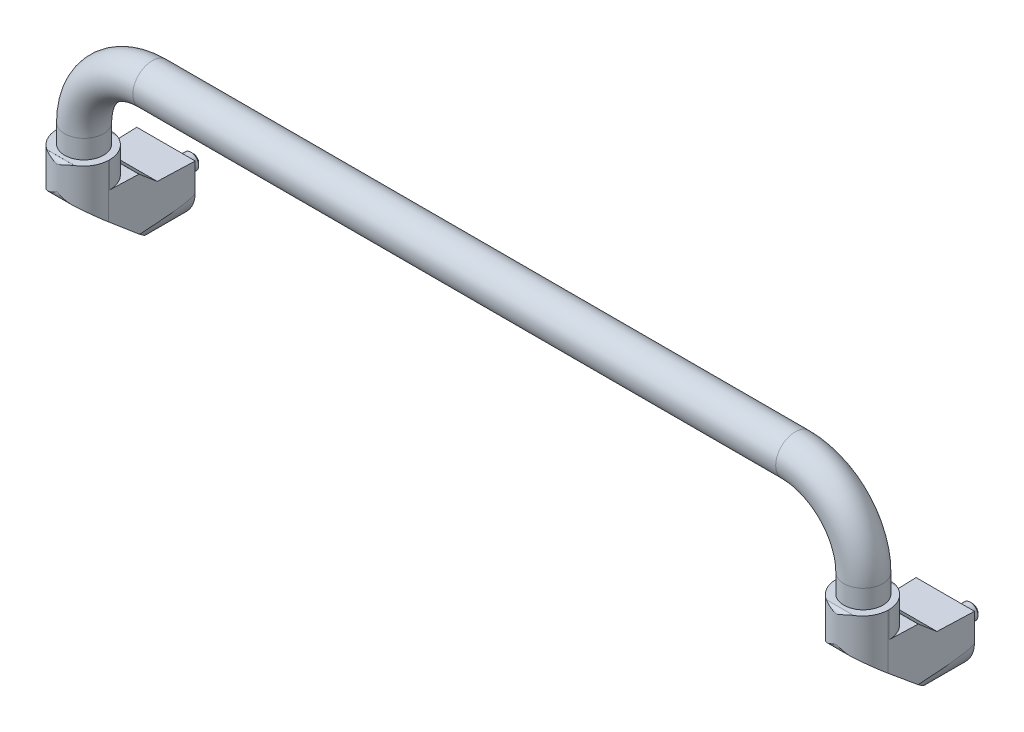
ISO-10303-21;
HEADER;
FILE_DESCRIPTION(('STEP AP214'),'2;1');
FILE_NAME('part.step','',(''),(''),'','','');
FILE_SCHEMA(('AUTOMOTIVE_DESIGN { 1 0 10303 214 1 1 1 1 }'));
ENDSEC;
DATA;
#1=APPLICATION_CONTEXT('core data for automotive mechanical design processes');
#2=APPLICATION_PROTOCOL_DEFINITION('international standard','automotive_design',2000,#1);
#3=PRODUCT_CONTEXT('',#1,'mechanical');
#4=PRODUCT('Part','Part','',(#3));
#5=PRODUCT_RELATED_PRODUCT_CATEGORY('part','',(#4));
#6=PRODUCT_DEFINITION_FORMATION('','',#4);
#7=PRODUCT_DEFINITION_CONTEXT('part definition',#1,'design');
#8=PRODUCT_DEFINITION('design','',#6,#7);
#9=PRODUCT_DEFINITION_SHAPE('','',#8);
#10=(LENGTH_UNIT() NAMED_UNIT(*) SI_UNIT(.MILLI.,.METRE.));
#11=(NAMED_UNIT(*) PLANE_ANGLE_UNIT() SI_UNIT($,.RADIAN.));
#12=(NAMED_UNIT(*) SI_UNIT($,.STERADIAN.) SOLID_ANGLE_UNIT());
#13=UNCERTAINTY_MEASURE_WITH_UNIT(LENGTH_MEASURE(1.E-05),#10,'distance_accuracy_value','');
#14=(GEOMETRIC_REPRESENTATION_CONTEXT(3) GLOBAL_UNCERTAINTY_ASSIGNED_CONTEXT((#13)) GLOBAL_UNIT_ASSIGNED_CONTEXT((#10,
#11,#12)) REPRESENTATION_CONTEXT('',''));
#15=CARTESIAN_POINT('',(0.,0.,0.));
#16=DIRECTION('',(0.,0.,1.));
#17=DIRECTION('',(1.,0.,0.));
#18=AXIS2_PLACEMENT_3D('',#15,#16,#17);
#19=CARTESIAN_POINT('',(14.5950313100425,35.000000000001,11.5380553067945));
#20=DIRECTION('',(-0.999384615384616,0.,-0.0350769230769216));
#21=DIRECTION('',(-0.0350769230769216,0.,0.999384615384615));
#22=AXIS2_PLACEMENT_3D('',#19,#20,#21);
#23=PLANE('',#22);
#24=DIRECTION('',(0.0350769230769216,0.,-0.999384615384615));
#25=VECTOR('',#24,1.);
#26=CARTESIAN_POINT('',(14.595031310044,14.0068766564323,11.5380553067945));
#27=LINE('',#26,#25);
#28=CARTESIAN_POINT('',(14.339275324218,14.0068766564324,18.824857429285));
#29=VERTEX_POINT('',#28);
#30=CARTESIAN_POINT('',(15.,14.0068766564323,0.));
#31=VERTEX_POINT('',#30);
#32=EDGE_CURVE('E655',#29,#31,#27,.T.);
#33=ORIENTED_EDGE('',*,*,#32,.F.);
#34=DIRECTION('',(0.0268773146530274,-0.642555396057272,-0.76576770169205));
#35=VECTOR('',#34,1.);
#36=CARTESIAN_POINT('',(14.1268807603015,19.0845890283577,24.876239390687));
#37=LINE('',#36,#35);
#38=CARTESIAN_POINT('',(14.0194412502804,21.6531431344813,27.9373229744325));
#39=VERTEX_POINT('',#38);
#40=EDGE_CURVE('E649',#39,#29,#37,.T.);
#41=ORIENTED_EDGE('',*,*,#40,.F.);
#42=DIRECTION('',(0.,1.,0.));
#43=VECTOR('',#42,1.);
#44=CARTESIAN_POINT('',(14.0194412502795,35.000000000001,27.9373229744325));
#45=LINE('',#44,#43);
#46=CARTESIAN_POINT('',(14.0194412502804,21.600000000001,27.9373229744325));
#47=VERTEX_POINT('',#46);
#48=EDGE_CURVE('E736',#47,#39,#45,.T.);
#49=ORIENTED_EDGE('',*,*,#48,.F.);
#50=DIRECTION('',(0.0350769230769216,0.,-0.999384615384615));
#51=VECTOR('',#50,1.);
#52=CARTESIAN_POINT('',(14.5950313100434,21.600000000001,11.5380553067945));
#53=LINE('',#52,#51);
#54=CARTESIAN_POINT('',(13.5083128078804,21.600000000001,42.5));
#55=VERTEX_POINT('',#54);
#56=EDGE_CURVE('E733',#55,#47,#53,.T.);
#57=ORIENTED_EDGE('',*,*,#56,.F.);
#58=DIRECTION('',(0.,1.,0.));
#59=VECTOR('',#58,1.);
#60=CARTESIAN_POINT('',(13.5083128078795,35.000000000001,42.5));
#61=LINE('',#60,#59);
#62=CARTESIAN_POINT('',(13.5083128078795,35.000000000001,42.5));
#63=VERTEX_POINT('',#62);
#64=EDGE_CURVE('E701',#55,#63,#61,.T.);
#65=ORIENTED_EDGE('',*,*,#64,.T.);
#66=DIRECTION('',(0.0350769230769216,0.,-0.999384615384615));
#67=VECTOR('',#66,1.);
#68=CARTESIAN_POINT('',(14.5950313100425,35.000000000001,11.5380553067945));
#69=LINE('',#68,#67);
#70=CARTESIAN_POINT('',(13.4916923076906,35.0000000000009,42.9735384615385));
#71=VERTEX_POINT('',#70);
#72=EDGE_CURVE('E322',#71,#63,#69,.T.);
#73=ORIENTED_EDGE('',*,*,#72,.F.);
#74=DIRECTION('',(0.,-1.,0.));
#75=VECTOR('',#74,1.);
#76=CARTESIAN_POINT('',(13.4916923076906,35.0000000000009,42.9735384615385));
#77=LINE('',#76,#75);
#78=CARTESIAN_POINT('',(13.4916923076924,7.63348617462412,42.9735384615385));
#79=VERTEX_POINT('',#78);
#80=EDGE_CURVE('E334',#71,#79,#77,.T.);
#81=ORIENTED_EDGE('',*,*,#80,.T.);
#82=DIRECTION('',(0.0268773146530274,-0.642555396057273,-0.765767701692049));
#83=VECTOR('',#82,1.);
#84=CARTESIAN_POINT('',(13.6668633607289,3.44567549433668,37.9827000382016));
#85=LINE('',#84,#83);
#86=CARTESIAN_POINT('',(14.0326622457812,-5.29947075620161,27.5606405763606));
#87=VERTEX_POINT('',#86);
#88=EDGE_CURVE('E675',#79,#87,#85,.T.);
#89=ORIENTED_EDGE('',*,*,#88,.T.);
#90=CARTESIAN_POINT('',(0.,0.,427.36842105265));
#91=DIRECTION('',(-0.999384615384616,0.,-0.0350769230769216));
#92=DIRECTION('',(0.0350769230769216,0.,-0.999384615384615));
#93=AXIS2_PLACEMENT_3D('',#90,#91,#92);
#94=ELLIPSE('',#93,427.631578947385,15.);
#95=CARTESIAN_POINT('',(14.98867122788,-0.582867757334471,0.322770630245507));
#96=VERTEX_POINT('',#95);
#97=EDGE_CURVE('E308',#87,#96,#94,.F.);
#98=ORIENTED_EDGE('',*,*,#97,.T.);
#99=DIRECTION('',(0.0350769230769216,0.,-0.999384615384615));
#100=VECTOR('',#99,1.);
#101=CARTESIAN_POINT('',(14.595031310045,-0.582867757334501,11.5380553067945));
#102=LINE('',#101,#100);
#103=CARTESIAN_POINT('',(15.,-0.582867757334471,0.));
#104=VERTEX_POINT('',#103);
#105=EDGE_CURVE('E310',#96,#104,#102,.T.);
#106=ORIENTED_EDGE('',*,*,#105,.T.);
#107=DIRECTION('',(0.,-1.,0.));
#108=VECTOR('',#107,1.);
#109=CARTESIAN_POINT('',(14.9999999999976,35.0000000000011,0.));
#110=LINE('',#109,#108);
#111=EDGE_CURVE('E332',#31,#104,#110,.T.);
#112=ORIENTED_EDGE('',*,*,#111,.F.);
#113=EDGE_LOOP('',(#33,#41,#49,#57,#65,#73,#81,#89,#98,#106,#112));
#114=FACE_BOUND('',#113,.T.);
#115=ADVANCED_FACE('F14',(#114),#23,.F.);
#116=CARTESIAN_POINT('',(-1.44474245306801E-12,35.,0.));
#117=DIRECTION('',(0.,0.,-1.));
#118=DIRECTION('',(0.,-1.,0.));
#119=AXIS2_PLACEMENT_3D('',#116,#117,#118);
#120=PLANE('',#119);
#121=CARTESIAN_POINT('',(0.,0.,0.));
#122=DIRECTION('',(0.,0.,-1.));
#123=DIRECTION('',(0.,-1.,0.));
#124=AXIS2_PLACEMENT_3D('',#121,#122,#123);
#125=CIRCLE('',#124,3.99999999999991);
#126=CARTESIAN_POINT('',(2.74040197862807E-13,-3.99999999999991,0.));
#127=VERTEX_POINT('',#126);
#128=EDGE_CURVE('E734',#127,#127,#125,.T.);
#129=ORIENTED_EDGE('',*,*,#128,.F.);
#130=EDGE_LOOP('',(#129));
#131=FACE_BOUND('',#130,.T.);
#132=DIRECTION('',(0.,-1.,0.));
#133=VECTOR('',#132,1.);
#134=CARTESIAN_POINT('',(-15.0000000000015,34.999999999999,0.));
#135=LINE('',#134,#133);
#136=CARTESIAN_POINT('',(-15.,14.0068766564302,0.));
#137=VERTEX_POINT('',#136);
#138=CARTESIAN_POINT('',(-14.999999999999,-0.582867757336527,0.));
#139=VERTEX_POINT('',#138);
#140=EDGE_CURVE('E340',#137,#139,#135,.T.);
#141=ORIENTED_EDGE('',*,*,#140,.F.);
#142=DIRECTION('',(1.,0.,0.));
#143=VECTOR('',#142,1.);
#144=CARTESIAN_POINT('',(0.,14.0068766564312,0.));
#145=LINE('',#144,#143);
#146=EDGE_CURVE('E653',#137,#31,#145,.T.);
#147=ORIENTED_EDGE('',*,*,#146,.T.);
#148=ORIENTED_EDGE('',*,*,#111,.T.);
#149=DIRECTION('',(1.,0.,0.));
#150=VECTOR('',#149,1.);
#151=CARTESIAN_POINT('',(14.98867122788,-0.582867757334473,0.));
#152=LINE('',#151,#150);
#153=CARTESIAN_POINT('',(14.98867122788,-0.582867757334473,0.));
#154=VERTEX_POINT('',#153);
#155=EDGE_CURVE('E297',#154,#104,#152,.T.);
#156=ORIENTED_EDGE('',*,*,#155,.F.);
#157=CARTESIAN_POINT('',(0.,0.,0.));
#158=DIRECTION('',(0.,0.,1.));
#159=DIRECTION('',(0.,-1.,0.));
#160=AXIS2_PLACEMENT_3D('',#157,#158,#159);
#161=CIRCLE('',#160,15.);
#162=CARTESIAN_POINT('',(-14.9886712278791,-0.582867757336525,0.));
#163=VERTEX_POINT('',#162);
#164=EDGE_CURVE('E292',#163,#154,#161,.T.);
#165=ORIENTED_EDGE('',*,*,#164,.F.);
#166=DIRECTION('',(-1.,0.,0.));
#167=VECTOR('',#166,1.);
#168=CARTESIAN_POINT('',(-14.9886712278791,-0.582867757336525,0.));
#169=LINE('',#168,#167);
#170=EDGE_CURVE('E294',#163,#139,#169,.T.);
#171=ORIENTED_EDGE('',*,*,#170,.T.);
#172=EDGE_LOOP('',(#141,#147,#148,#156,#165,#171));
#173=FACE_BOUND('',#172,.T.);
#174=ADVANCED_FACE('F564',(#131,#173),#120,.T.);
#175=CARTESIAN_POINT('',(-1.48036964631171E-12,35.,42.5));
#176=DIRECTION('',(0.,1.,0.));
#177=DIRECTION('',(1.,0.,0.));
#178=AXIS2_PLACEMENT_3D('',#175,#176,#177);
#179=PLANE('',#178);
#180=CARTESIAN_POINT('',(-0.0396757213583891,35.,41.9999909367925));
#181=DIRECTION('',(0.,1.,0.));
#182=DIRECTION('',(-1.,0.,0.));
#183=AXIS2_PLACEMENT_3D('',#180,#181,#182);
#184=CIRCLE('',#183,10.);
#185=CARTESIAN_POINT('',(-10.0396757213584,34.9999999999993,41.9999909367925));
#186=VERTEX_POINT('',#185);
#187=EDGE_CURVE('E342',#186,#186,#184,.T.);
#188=ORIENTED_EDGE('',*,*,#187,.F.);
#189=EDGE_LOOP('',(#188));
#190=FACE_BOUND('',#189,.T.);
#191=CARTESIAN_POINT('',(-1.48036964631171E-12,35.,42.5));
#192=DIRECTION('',(0.,-1.,0.));
#193=DIRECTION('',(1.,0.,0.));
#194=AXIS2_PLACEMENT_3D('',#191,#192,#193);
#195=CIRCLE('',#194,13.5);
#196=CARTESIAN_POINT('',(5.0990195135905,35.,30.));
#197=VERTEX_POINT('',#196);
#198=CARTESIAN_POINT('',(13.4999999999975,35.000000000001,42.5));
#199=VERTEX_POINT('',#198);
#200=EDGE_CURVE('E257',#197,#199,#195,.T.);
#201=ORIENTED_EDGE('',*,*,#200,.F.);
#202=DIRECTION('',(1.,0.,0.));
#203=VECTOR('',#202,1.);
#204=CARTESIAN_POINT('',(-15.0000000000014,34.999999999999,30.));
#205=LINE('',#204,#203);
#206=CARTESIAN_POINT('',(-5.09901951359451,34.9999999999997,30.));
#207=VERTEX_POINT('',#206);
#208=EDGE_CURVE('E36',#207,#197,#205,.T.);
#209=ORIENTED_EDGE('',*,*,#208,.F.);
#210=CARTESIAN_POINT('',(-13.5000000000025,34.9999999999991,42.5));
#211=VERTEX_POINT('',#210);
#212=EDGE_CURVE('E255',#211,#207,#195,.T.);
#213=ORIENTED_EDGE('',*,*,#212,.F.);
#214=DIRECTION('',(1.,0.,0.));
#215=VECTOR('',#214,1.);
#216=CARTESIAN_POINT('',(-14.9886712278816,34.9999999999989,42.5));
#217=LINE('',#216,#215);
#218=CARTESIAN_POINT('',(-13.5083128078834,34.9999999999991,42.5));
#219=VERTEX_POINT('',#218);
#220=EDGE_CURVE('E265',#219,#211,#217,.T.);
#221=ORIENTED_EDGE('',*,*,#220,.F.);
#222=DIRECTION('',(0.0350769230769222,0.,0.999384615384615));
#223=VECTOR('',#222,1.);
#224=CARTESIAN_POINT('',(-14.5950313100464,34.999999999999,11.5380553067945));
#225=LINE('',#224,#223);
#226=CARTESIAN_POINT('',(-13.4916923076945,34.9999999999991,42.9735384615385));
#227=VERTEX_POINT('',#226);
#228=EDGE_CURVE('E329',#219,#227,#225,.T.);
#229=ORIENTED_EDGE('',*,*,#228,.T.);
#230=CARTESIAN_POINT('',(-1.48036964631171E-12,35.,42.5));
#231=DIRECTION('',(0.,-1.,0.));
#232=DIRECTION('',(1.,0.,0.));
#233=AXIS2_PLACEMENT_3D('',#230,#231,#232);
#234=CIRCLE('',#233,13.5);
#235=CARTESIAN_POINT('',(-7.07092481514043,34.9999999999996,54.0000879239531));
#236=VERTEX_POINT('',#235);
#237=EDGE_CURVE('E325',#236,#227,#234,.T.);
#238=ORIENTED_EDGE('',*,*,#237,.F.);
#239=DIRECTION('',(-1.,0.,0.));
#240=VECTOR('',#239,1.);
#241=CARTESIAN_POINT('',(-1.458251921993E-12,35.,54.000087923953));
#242=LINE('',#241,#240);
#243=CARTESIAN_POINT('',(7.07092481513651,35.0000000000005,54.000087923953));
#244=VERTEX_POINT('',#243);
#245=EDGE_CURVE('E598',#244,#236,#242,.T.);
#246=ORIENTED_EDGE('',*,*,#245,.F.);
#247=EDGE_CURVE('E326',#71,#244,#234,.T.);
#248=ORIENTED_EDGE('',*,*,#247,.F.);
#249=ORIENTED_EDGE('',*,*,#72,.T.);
#250=DIRECTION('',(1.,0.,0.));
#251=VECTOR('',#250,1.);
#252=CARTESIAN_POINT('',(13.4999999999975,35.000000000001,42.5));
#253=LINE('',#252,#251);
#254=EDGE_CURVE('E267',#199,#63,#253,.T.);
#255=ORIENTED_EDGE('',*,*,#254,.F.);
#256=EDGE_LOOP('',(#201,#209,#213,#221,#229,#238,#246,#248,#249,#255));
#257=FACE_BOUND('',#256,.T.);
#258=ADVANCED_FACE('F253',(#190,#257),#179,.T.);
#259=CARTESIAN_POINT('',(-14.5950313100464,34.999999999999,11.5380553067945));
#260=DIRECTION('',(0.999384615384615,0.,-0.0350769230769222));
#261=DIRECTION('',(-0.0350769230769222,0.,-0.999384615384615));
#262=AXIS2_PLACEMENT_3D('',#259,#260,#261);
#263=PLANE('',#262);
#264=DIRECTION('',(0.0350769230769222,0.,0.999384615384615));
#265=VECTOR('',#264,1.);
#266=CARTESIAN_POINT('',(-14.595031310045,14.0068766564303,11.5380553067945));
#267=LINE('',#266,#265);
#268=CARTESIAN_POINT('',(-14.339275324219,14.0068766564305,18.824857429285));
#269=VERTEX_POINT('',#268);
#270=EDGE_CURVE('E9',#137,#269,#267,.T.);
#271=ORIENTED_EDGE('',*,*,#270,.F.);
#272=ORIENTED_EDGE('',*,*,#140,.T.);
#273=DIRECTION('',(-0.0350769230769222,0.,-0.999384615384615));
#274=VECTOR('',#273,1.);
#275=CARTESIAN_POINT('',(-14.595031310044,-0.5828677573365,11.5380553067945));
#276=LINE('',#275,#274);
#277=CARTESIAN_POINT('',(-14.9886712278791,-0.582867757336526,0.322770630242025));
#278=VERTEX_POINT('',#277);
#279=EDGE_CURVE('E313',#278,#139,#276,.T.);
#280=ORIENTED_EDGE('',*,*,#279,.F.);
#281=CARTESIAN_POINT('',(0.,0.,427.36842105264));
#282=DIRECTION('',(0.999384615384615,0.,-0.0350769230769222));
#283=DIRECTION('',(-0.0350769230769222,0.,-0.999384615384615));
#284=AXIS2_PLACEMENT_3D('',#281,#282,#283);
#285=ELLIPSE('',#284,427.631578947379,15.);
#286=CARTESIAN_POINT('',(-14.0326622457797,-5.29947075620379,27.5606405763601));
#287=VERTEX_POINT('',#286);
#288=EDGE_CURVE('E305',#278,#287,#285,.F.);
#289=ORIENTED_EDGE('',*,*,#288,.T.);
#290=DIRECTION('',(0.0268773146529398,0.642555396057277,0.765767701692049));
#291=VECTOR('',#290,1.);
#292=CARTESIAN_POINT('',(-13.6668633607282,3.44567549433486,37.9827000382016));
#293=LINE('',#292,#291);
#294=CARTESIAN_POINT('',(-13.4916923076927,7.63348617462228,42.9735384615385));
#295=VERTEX_POINT('',#294);
#296=EDGE_CURVE('E672',#287,#295,#293,.T.);
#297=ORIENTED_EDGE('',*,*,#296,.T.);
#298=DIRECTION('',(0.,-1.,0.));
#299=VECTOR('',#298,1.);
#300=CARTESIAN_POINT('',(-13.4916923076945,34.9999999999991,42.9735384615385));
#301=LINE('',#300,#299);
#302=EDGE_CURVE('E337',#227,#295,#301,.T.);
#303=ORIENTED_EDGE('',*,*,#302,.F.);
#304=ORIENTED_EDGE('',*,*,#228,.F.);
#305=DIRECTION('',(0.,-1.,0.));
#306=VECTOR('',#305,1.);
#307=CARTESIAN_POINT('',(-13.5083128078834,34.9999999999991,42.5));
#308=LINE('',#307,#306);
#309=CARTESIAN_POINT('',(-13.5083128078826,21.599999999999,42.5));
#310=VERTEX_POINT('',#309);
#311=EDGE_CURVE('E693',#219,#310,#308,.T.);
#312=ORIENTED_EDGE('',*,*,#311,.T.);
#313=DIRECTION('',(0.0350769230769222,0.,0.999384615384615));
#314=VECTOR('',#313,1.);
#315=CARTESIAN_POINT('',(-14.5950313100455,21.599999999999,11.5380553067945));
#316=LINE('',#315,#314);
#317=CARTESIAN_POINT('',(-14.0194412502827,21.599999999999,27.9373229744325));
#318=VERTEX_POINT('',#317);
#319=EDGE_CURVE('E288',#318,#310,#316,.T.);
#320=ORIENTED_EDGE('',*,*,#319,.F.);
#321=DIRECTION('',(0.,-1.,0.));
#322=VECTOR('',#321,1.);
#323=CARTESIAN_POINT('',(-14.0194412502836,34.9999999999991,27.9373229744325));
#324=LINE('',#323,#322);
#325=CARTESIAN_POINT('',(-14.0194412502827,21.6531431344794,27.9373229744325));
#326=VERTEX_POINT('',#325);
#327=EDGE_CURVE('E290',#326,#318,#324,.T.);
#328=ORIENTED_EDGE('',*,*,#327,.F.);
#329=DIRECTION('',(0.0268773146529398,0.642555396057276,0.76576770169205));
#330=VECTOR('',#329,1.);
#331=CARTESIAN_POINT('',(-14.1268807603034,19.0845890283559,24.8762393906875));
#332=LINE('',#331,#330);
#333=EDGE_CURVE('E29',#269,#326,#332,.T.);
#334=ORIENTED_EDGE('',*,*,#333,.F.);
#335=EDGE_LOOP('',(#271,#272,#280,#289,#297,#303,#304,#312,#320,#328,#334));
#336=FACE_BOUND('',#335,.T.);
#337=ADVANCED_FACE('F583',(#336),#263,.F.);
#338=CARTESIAN_POINT('',(-14.9886712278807,21.599999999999,27.9373229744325));
#339=DIRECTION('',(0.,0.,1.));
#340=DIRECTION('',(0.,1.,0.));
#341=AXIS2_PLACEMENT_3D('',#338,#339,#340);
#342=PLANE('',#341);
#343=ORIENTED_EDGE('',*,*,#48,.T.);
#344=DIRECTION('',(-1.,0.,0.));
#345=VECTOR('',#344,1.);
#346=CARTESIAN_POINT('',(-14.9886712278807,21.6531431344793,27.9373229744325));
#347=LINE('',#346,#345);
#348=EDGE_CURVE('E22',#39,#326,#347,.T.);
#349=ORIENTED_EDGE('',*,*,#348,.T.);
#350=ORIENTED_EDGE('',*,*,#327,.T.);
#351=DIRECTION('',(1.,0.,0.));
#352=VECTOR('',#351,1.);
#353=CARTESIAN_POINT('',(-14.9886712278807,21.599999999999,27.9373229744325));
#354=LINE('',#353,#352);
#355=EDGE_CURVE('E279',#318,#47,#354,.T.);
#356=ORIENTED_EDGE('',*,*,#355,.T.);
#357=EDGE_LOOP('',(#343,#349,#350,#356));
#358=FACE_BOUND('',#357,.T.);
#359=ADVANCED_FACE('F581',(#358),#342,.T.);
#360=CARTESIAN_POINT('',(-1.48036964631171E-12,35.,42.5));
#361=DIRECTION('',(0.,-1.,0.));
#362=DIRECTION('',(1.,0.,0.));
#363=AXIS2_PLACEMENT_3D('',#360,#361,#362);
#364=CYLINDRICAL_SURFACE('',#363,13.5);
#365=DIRECTION('',(0.,-1.,0.));
#366=VECTOR('',#365,1.);
#367=CARTESIAN_POINT('',(7.07092481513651,35.0000000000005,54.000087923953));
#368=LINE('',#367,#366);
#369=CARTESIAN_POINT('',(7.07092481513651,34.9704219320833,54.000087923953));
#370=VERTEX_POINT('',#369);
#371=EDGE_CURVE('E682',#370,#244,#368,.F.);
#372=ORIENTED_EDGE('',*,*,#371,.F.);
#373=CARTESIAN_POINT('',(-7.07092481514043,34.9704219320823,54.0000879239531));
#374=CARTESIAN_POINT('',(-6.87750374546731,34.97042829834,54.1190115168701));
#375=CARTESIAN_POINT('',(-6.6810537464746,34.9598691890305,54.2330583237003));
#376=CARTESIAN_POINT('',(-6.2838135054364,34.9221612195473,54.4505270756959));
#377=CARTESIAN_POINT('',(-6.08301891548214,34.8949949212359,54.5539377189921));
#378=CARTESIAN_POINT('',(-5.67707138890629,34.8272761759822,54.7503886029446));
#379=CARTESIAN_POINT('',(-5.47189888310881,34.7866398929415,54.8433588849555));
#380=CARTESIAN_POINT('',(-5.05931393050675,34.6947574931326,55.0181285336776));
#381=CARTESIAN_POINT('',(-4.85190211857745,34.6435143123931,55.09993098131));
#382=CARTESIAN_POINT('',(-4.36508724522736,34.5138570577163,55.2782623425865));
#383=CARTESIAN_POINT('',(-4.08498441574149,34.432106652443,55.3704604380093));
#384=CARTESIAN_POINT('',(-3.52253018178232,34.2574892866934,55.5356338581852));
#385=CARTESIAN_POINT('',(-3.24017788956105,34.1646177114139,55.6086011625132));
#386=CARTESIAN_POINT('',(-2.67652768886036,33.9718090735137,55.7351381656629));
#387=CARTESIAN_POINT('',(-2.39524290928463,33.8719425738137,55.7888753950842));
#388=CARTESIAN_POINT('',(-1.83184388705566,33.6670280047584,55.8781780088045));
#389=CARTESIAN_POINT('',(-1.54973016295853,33.561982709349,55.9137530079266));
#390=CARTESIAN_POINT('',(-1.17146433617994,33.4192935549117,55.949421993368));
#391=CARTESIAN_POINT('',(-1.07551786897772,33.3829421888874,55.9574338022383));
#392=CARTESIAN_POINT('',(-0.883513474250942,33.3099862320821,55.9714019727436));
#393=CARTESIAN_POINT('',(-0.787455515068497,33.2733815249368,55.9773573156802));
#394=CARTESIAN_POINT('',(-0.593228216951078,33.1991990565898,55.9873180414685));
#395=CARTESIAN_POINT('',(-0.495058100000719,33.1616173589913,55.9912785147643));
#396=CARTESIAN_POINT('',(-0.347759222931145,33.1055246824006,55.9956090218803));
#397=CARTESIAN_POINT('',(-0.298700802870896,33.0868920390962,55.996783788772));
#398=CARTESIAN_POINT('',(-0.20055364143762,33.0496905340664,55.9985999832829));
#399=CARTESIAN_POINT('',(-0.151464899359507,33.0311216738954,55.9992413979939));
#400=CARTESIAN_POINT('',(-0.0849879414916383,33.0080155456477,55.9997430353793));
#401=CARTESIAN_POINT('',(-0.0680493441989,33.0023025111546,55.9998394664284));
#402=CARTESIAN_POINT('',(-0.0424994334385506,32.9952097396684,55.9999356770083));
#403=CARTESIAN_POINT('',(-0.0341004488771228,32.9931150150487,55.9999596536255));
#404=CARTESIAN_POINT('',(-0.017129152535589,32.9901026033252,55.9999917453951));
#405=CARTESIAN_POINT('',(-0.00855921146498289,32.9891740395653,56.0000000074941));
#406=CARTESIAN_POINT('',(0.00879402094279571,32.9891765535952,55.9999999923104));
#407=CARTESIAN_POINT('',(0.0175772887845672,32.9901547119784,55.9999912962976));
#408=CARTESIAN_POINT('',(0.0349664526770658,32.9933005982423,55.9999575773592));
#409=CARTESIAN_POINT('',(0.0435697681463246,32.9954798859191,55.999932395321));
#410=CARTESIAN_POINT('',(0.0697279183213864,33.0028315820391,55.9998314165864));
#411=CARTESIAN_POINT('',(0.0870672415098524,33.0087214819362,55.9997302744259));
#412=CARTESIAN_POINT('',(0.171095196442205,33.0380140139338,55.9990808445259));
#413=CARTESIAN_POINT('',(0.237058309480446,33.0633144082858,55.9980811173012));
#414=CARTESIAN_POINT('',(0.367738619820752,33.1132270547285,55.9951443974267));
#415=CARTESIAN_POINT('',(0.432454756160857,33.1378430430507,55.9932262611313));
#416=CARTESIAN_POINT('',(0.627360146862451,33.2121316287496,55.9860459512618));
#417=CARTESIAN_POINT('',(0.75745441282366,33.2619227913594,55.9793646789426));
#418=CARTESIAN_POINT('',(1.01760396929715,33.3610278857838,55.9622233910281));
#419=CARTESIAN_POINT('',(1.14765924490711,33.4103417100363,55.9517625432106));
#420=CARTESIAN_POINT('',(1.54015609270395,33.5583124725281,55.9144503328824));
#421=CARTESIAN_POINT('',(1.80241871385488,33.6560305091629,55.8817605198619));
#422=CARTESIAN_POINT('',(2.39427723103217,33.87190795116,55.7901814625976));
#423=CARTESIAN_POINT('',(2.72364690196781,33.9887746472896,55.7266896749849));
#424=CARTESIAN_POINT('',(3.38052871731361,34.211495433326,55.5742426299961));
#425=CARTESIAN_POINT('',(3.70803931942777,34.3173413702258,55.4852687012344));
#426=CARTESIAN_POINT('',(4.35819027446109,34.5122628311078,55.2816858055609));
#427=CARTESIAN_POINT('',(4.68084736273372,34.6014256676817,55.1672175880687));
#428=CARTESIAN_POINT('',(5.16087542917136,34.7178726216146,54.9757774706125));
#429=CARTESIAN_POINT('',(5.32015518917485,34.753793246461,54.9087086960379));
#430=CARTESIAN_POINT('',(5.63716070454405,34.818775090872,54.7679448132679));
#431=CARTESIAN_POINT('',(5.79488691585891,34.8478383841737,54.6942517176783));
#432=CARTESIAN_POINT('',(6.06000533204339,34.8900814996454,54.5640340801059));
#433=CARTESIAN_POINT('',(6.16790737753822,34.905395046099,54.5092308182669));
#434=CARTESIAN_POINT('',(6.38261514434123,34.9315949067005,54.3965087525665));
#435=CARTESIAN_POINT('',(6.48942096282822,34.9424816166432,54.3385902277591));
#436=CARTESIAN_POINT('',(6.70186294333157,34.9592434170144,54.2196361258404));
#437=CARTESIAN_POINT('',(6.80749751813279,34.9651123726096,54.1585968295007));
#438=CARTESIAN_POINT('',(7.01720095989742,34.9711201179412,54.0335939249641));
#439=CARTESIAN_POINT('',(7.12126983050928,34.9712589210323,53.9696303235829));
#440=CARTESIAN_POINT('',(7.32838648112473,34.9649685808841,53.8384260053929));
#441=CARTESIAN_POINT('',(7.43141794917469,34.9584833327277,53.771161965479));
#442=CARTESIAN_POINT('',(7.63511779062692,34.9378853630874,53.6341833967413));
#443=CARTESIAN_POINT('',(7.73578568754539,34.9237711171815,53.5644683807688));
#444=CARTESIAN_POINT('',(7.93394129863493,34.8868175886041,53.4232476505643));
#445=CARTESIAN_POINT('',(8.03143518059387,34.8639964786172,53.3517459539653));
#446=CARTESIAN_POINT('',(8.22260264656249,34.8083439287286,53.2076198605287));
#447=CARTESIAN_POINT('',(8.31627877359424,34.7755192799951,53.1349962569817));
#448=CARTESIAN_POINT('',(8.51057580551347,34.6934220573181,52.9803342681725));
#449=CARTESIAN_POINT('',(8.610541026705,34.6425773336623,52.8982859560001));
#450=CARTESIAN_POINT('',(8.80216710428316,34.523990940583,52.7365776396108));
#451=CARTESIAN_POINT('',(8.89383372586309,34.4562611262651,52.6569160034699));
#452=CARTESIAN_POINT('',(9.05162034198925,34.3145923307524,52.5163590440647));
#453=CARTESIAN_POINT('',(9.11946043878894,34.2435185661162,52.4545352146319));
#454=CARTESIAN_POINT('',(9.24476625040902,34.0874675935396,52.3382710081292));
#455=CARTESIAN_POINT('',(9.30224701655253,34.0025109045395,52.2838199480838));
#456=CARTESIAN_POINT('',(9.39284210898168,33.8391516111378,52.1967822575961));
#457=CARTESIAN_POINT('',(9.42853677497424,33.7633500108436,52.1620164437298));
#458=CARTESIAN_POINT('',(9.49027872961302,33.6045451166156,52.1013794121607));
#459=CARTESIAN_POINT('',(9.51633106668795,33.5215456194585,52.0755035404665));
#460=CARTESIAN_POINT('',(9.5575300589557,33.3497074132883,52.0343845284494));
#461=CARTESIAN_POINT('',(9.57260589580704,33.2608347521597,52.0192104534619));
#462=CARTESIAN_POINT('',(9.59060313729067,33.0806412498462,52.0010792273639));
#463=CARTESIAN_POINT('',(9.59353024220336,32.9893215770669,51.9981163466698));
#464=CARTESIAN_POINT('',(9.58739700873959,32.8171715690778,52.004305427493));
#465=CARTESIAN_POINT('',(9.57956343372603,32.7362469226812,52.0122176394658));
#466=CARTESIAN_POINT('',(9.55445710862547,32.5774089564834,52.0374347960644));
#467=CARTESIAN_POINT('',(9.53718461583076,32.4994955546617,52.0547394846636));
#468=CARTESIAN_POINT('',(9.49381006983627,32.3477345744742,52.0978384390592));
#469=CARTESIAN_POINT('',(9.46761759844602,32.2739380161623,52.1237195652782));
#470=CARTESIAN_POINT('',(9.40755152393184,32.1325392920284,52.1824450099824));
#471=CARTESIAN_POINT('',(9.37367436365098,32.064940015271,52.2152925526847));
#472=CARTESIAN_POINT('',(9.28309871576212,31.908506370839,52.3020150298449));
#473=CARTESIAN_POINT('',(9.22289796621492,31.823308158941,52.3588047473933));
#474=CARTESIAN_POINT('',(9.09201649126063,31.667339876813,52.4796404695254));
#475=CARTESIAN_POINT('',(9.02131423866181,31.5966001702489,52.5437013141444));
#476=CARTESIAN_POINT('',(8.83971629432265,31.4412059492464,52.7043937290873));
#477=CARTESIAN_POINT('',(8.72463129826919,31.3636956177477,52.8031628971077));
#478=CARTESIAN_POINT('',(8.48328068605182,31.2326908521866,53.0027921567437));
#479=CARTESIAN_POINT('',(8.35699456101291,31.1792416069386,53.10365581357));
#480=CARTESIAN_POINT('',(8.12310761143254,31.1012155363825,53.2834270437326));
#481=CARTESIAN_POINT('',(8.01691189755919,31.0729815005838,53.3626386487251));
#482=CARTESIAN_POINT('',(7.80064869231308,31.0274448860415,53.5189695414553));
#483=CARTESIAN_POINT('',(7.69057893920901,31.0101488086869,53.5960875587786));
#484=CARTESIAN_POINT('',(7.46735068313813,30.9849468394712,53.747528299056));
#485=CARTESIAN_POINT('',(7.35418900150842,30.9770510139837,53.8218479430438));
#486=CARTESIAN_POINT('',(7.12546874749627,30.9693699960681,53.9671737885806));
#487=CARTESIAN_POINT('',(7.00990934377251,30.9695876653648,54.0381788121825));
#488=CARTESIAN_POINT('',(6.69420345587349,30.9796506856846,54.225666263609));
#489=CARTESIAN_POINT('',(6.49219751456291,30.9962153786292,54.3386830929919));
#490=CARTESIAN_POINT('',(6.08416654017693,31.0453499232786,54.553471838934));
#491=CARTESIAN_POINT('',(5.87813877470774,31.0779310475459,54.6552357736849));
#492=CARTESIAN_POINT('',(5.46253603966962,31.155891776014,54.8476027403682));
#493=CARTESIAN_POINT('',(5.25295184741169,31.2013118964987,54.9381691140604));
#494=CARTESIAN_POINT('',(4.83167592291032,31.3022724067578,55.1077942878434));
#495=CARTESIAN_POINT('',(4.61998458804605,31.3578109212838,55.1868552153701));
#496=CARTESIAN_POINT('',(4.13829353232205,31.4928100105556,55.3532339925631));
#497=CARTESIAN_POINT('',(3.86779442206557,31.5747008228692,55.4371341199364));
#498=CARTESIAN_POINT('',(3.32490231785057,31.7480204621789,55.5871836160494));
#499=CARTESIAN_POINT('',(3.05250878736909,31.839452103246,55.6533277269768));
#500=CARTESIAN_POINT('',(2.50838879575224,32.0284631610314,55.7678081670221));
#501=CARTESIAN_POINT('',(2.23667121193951,32.1259945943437,55.8162669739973));
#502=CARTESIAN_POINT('',(1.69251556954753,32.3255150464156,55.8963048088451));
#503=CARTESIAN_POINT('',(1.42007787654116,32.4275021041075,55.9278911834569));
#504=CARTESIAN_POINT('',(1.05943377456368,32.5639977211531,55.9586551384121));
#505=CARTESIAN_POINT('',(0.971407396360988,32.5974308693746,55.9652943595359));
#506=CARTESIAN_POINT('',(0.795276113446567,32.6644946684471,55.9768441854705));
#507=CARTESIAN_POINT('',(0.707171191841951,32.6981253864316,55.9817541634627));
#508=CARTESIAN_POINT('',(0.574252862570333,32.7488848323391,55.9878553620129));
#509=CARTESIAN_POINT('',(0.529460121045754,32.7659944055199,55.9896878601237));
#510=CARTESIAN_POINT('',(0.439859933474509,32.8002299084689,55.9929068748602));
#511=CARTESIAN_POINT('',(0.395052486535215,32.8173558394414,55.9942933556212));
#512=CARTESIAN_POINT('',(0.305429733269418,32.8514111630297,55.9966185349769));
#513=CARTESIAN_POINT('',(0.260614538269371,32.8683408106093,55.9975578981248));
#514=CARTESIAN_POINT('',(0.170992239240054,32.9022294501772,55.9989921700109));
#515=CARTESIAN_POINT('',(0.126185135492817,32.9191884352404,55.9994871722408));
#516=CARTESIAN_POINT('',(0.067339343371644,32.9385313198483,55.9998385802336));
#517=CARTESIAN_POINT('',(0.0539644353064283,32.9427370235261,55.9998990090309));
#518=CARTESIAN_POINT('',(0.0337306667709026,32.9476947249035,55.9999594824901));
#519=CARTESIAN_POINT('',(0.0270488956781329,32.9491116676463,55.9999746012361));
#520=CARTESIAN_POINT('',(0.0135759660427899,32.9510967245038,55.9999948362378));
#521=CARTESIAN_POINT('',(0.00678553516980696,32.9516691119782,56.0000000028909));
#522=CARTESIAN_POINT('',(-0.00692023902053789,32.9516680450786,55.9999999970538));
#523=CARTESIAN_POINT('',(-0.0138355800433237,32.9510732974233,55.9999946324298));
#524=CARTESIAN_POINT('',(-0.0275536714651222,32.9490209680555,55.9999736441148));
#525=CARTESIAN_POINT('',(-0.0343556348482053,32.947558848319,55.9999579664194));
#526=CARTESIAN_POINT('',(-0.0549419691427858,32.9424579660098,55.999895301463));
#527=CARTESIAN_POINT('',(-0.068545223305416,32.9381473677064,55.9998327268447));
#528=CARTESIAN_POINT('',(-0.137339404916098,32.9154604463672,55.9994146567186));
#529=CARTESIAN_POINT('',(-0.191635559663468,32.8946356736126,55.9987504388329));
#530=CARTESIAN_POINT('',(-0.299452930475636,32.8535542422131,55.9967831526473));
#531=CARTESIAN_POINT('',(-0.352973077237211,32.8332937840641,55.9954901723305));
#532=CARTESIAN_POINT('',(-0.513910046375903,32.7721117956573,55.9906445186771));
#533=CARTESIAN_POINT('',(-0.621219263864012,32.7309705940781,55.9861281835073));
#534=CARTESIAN_POINT('',(-0.835826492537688,32.6489898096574,55.9745286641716));
#535=CARTESIAN_POINT('',(-0.943124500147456,32.6081502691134,55.967445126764));
#536=CARTESIAN_POINT('',(-1.2665311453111,32.4854908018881,55.9422069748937));
#537=CARTESIAN_POINT('',(-1.48252415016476,32.4041563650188,55.9201133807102));
#538=CARTESIAN_POINT('',(-2.05310658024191,32.1922671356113,55.8477580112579));
#539=CARTESIAN_POINT('',(-2.40736493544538,32.0637495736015,55.7885189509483));
#540=CARTESIAN_POINT('',(-3.11404692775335,31.8178919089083,55.6408966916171));
#541=CARTESIAN_POINT('',(-3.46646876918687,31.7005613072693,55.5524889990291));
#542=CARTESIAN_POINT('',(-4.16746062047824,31.4833378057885,55.3458337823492));
#543=CARTESIAN_POINT('',(-4.51603625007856,31.383415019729,55.2276382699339));
#544=CARTESIAN_POINT('',(-5.03457491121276,31.2526265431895,55.0274642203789));
#545=CARTESIAN_POINT('',(-5.20662438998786,31.2122268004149,54.9569626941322));
#546=CARTESIAN_POINT('',(-5.5490011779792,31.1391058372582,54.8082653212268));
#547=CARTESIAN_POINT('',(-5.71932895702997,31.1063824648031,54.7300716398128));
#548=CARTESIAN_POINT('',(-6.0578921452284,31.0501830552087,54.5659581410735));
#549=CARTESIAN_POINT('',(-6.22612665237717,31.0267108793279,54.480035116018));
#550=CARTESIAN_POINT('',(-6.55983624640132,30.9910136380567,54.3006114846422));
#551=CARTESIAN_POINT('',(-6.72531058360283,30.9787915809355,54.2071088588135));
#552=CARTESIAN_POINT('',(-7.05166813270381,30.9681285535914,54.013460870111));
#553=CARTESIAN_POINT('',(-7.21257096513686,30.9696151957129,53.9133531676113));
#554=CARTESIAN_POINT('',(-7.52921914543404,30.9893042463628,53.7069833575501));
#555=CARTESIAN_POINT('',(-7.6849702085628,31.0074874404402,53.6007284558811));
#556=CARTESIAN_POINT('',(-7.96520055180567,31.0599487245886,53.4009313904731));
#557=CARTESIAN_POINT('',(-8.09070943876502,31.0912019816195,53.3080599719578));
#558=CARTESIAN_POINT('',(-8.33518178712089,31.1712549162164,53.120661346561));
#559=CARTESIAN_POINT('',(-8.45413646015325,31.2200775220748,53.0261321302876));
#560=CARTESIAN_POINT('',(-8.6839571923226,31.339253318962,52.8373706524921));
#561=CARTESIAN_POINT('',(-8.79471396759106,31.4098486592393,52.7431544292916));
#562=CARTESIAN_POINT('',(-9.00217867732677,31.5758213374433,52.5612936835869));
#563=CARTESIAN_POINT('',(-9.09893281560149,31.6711141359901,52.4736280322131));
#564=CARTESIAN_POINT('',(-9.23879434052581,31.8463568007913,52.3437817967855));
#565=CARTESIAN_POINT('',(-9.28817710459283,31.9179858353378,52.2971229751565));
#566=CARTESIAN_POINT('',(-9.37762994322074,32.0711185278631,52.2115327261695));
#567=CARTESIAN_POINT('',(-9.41770381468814,32.1526181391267,52.1725981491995));
#568=CARTESIAN_POINT('',(-9.48688680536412,32.3251423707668,52.1047578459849));
#569=CARTESIAN_POINT('',(-9.51588964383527,32.416249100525,52.0759495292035));
#570=CARTESIAN_POINT('',(-9.56048639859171,32.6047461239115,52.0314280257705));
#571=CARTESIAN_POINT('',(-9.57609448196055,32.7021296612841,52.0157010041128));
#572=CARTESIAN_POINT('',(-9.5916242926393,32.8858851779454,52.0000441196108));
#573=CARTESIAN_POINT('',(-9.5933947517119,32.9719479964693,51.9982526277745));
#574=CARTESIAN_POINT('',(-9.58599731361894,33.1431030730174,52.0057185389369));
#575=CARTESIAN_POINT('',(-9.57683219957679,33.2281955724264,52.0149731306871));
#576=CARTESIAN_POINT('',(-9.5490124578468,33.3895386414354,52.0428879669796));
#577=CARTESIAN_POINT('',(-9.53098605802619,33.4660095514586,52.0609248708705));
#578=CARTESIAN_POINT('',(-9.48665037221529,33.6140818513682,52.1049172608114));
#579=CARTESIAN_POINT('',(-9.46033984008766,33.6856825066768,52.1308739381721));
#580=CARTESIAN_POINT('',(-9.39781448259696,33.8289598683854,52.1919112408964));
#581=CARTESIAN_POINT('',(-9.36092955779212,33.9000833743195,52.2275957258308));
#582=CARTESIAN_POINT('',(-9.27994226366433,34.0345276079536,52.3048874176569));
#583=CARTESIAN_POINT('',(-9.23583574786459,34.097843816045,52.3464980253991));
#584=CARTESIAN_POINT('',(-9.11466106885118,34.2505440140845,52.4590709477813));
#585=CARTESIAN_POINT('',(-9.0331778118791,34.3341014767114,52.5331997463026));
#586=CARTESIAN_POINT('',(-8.85933060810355,34.4828442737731,52.6870411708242));
#587=CARTESIAN_POINT('',(-8.76693805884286,34.5479797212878,52.766768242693));
#588=CARTESIAN_POINT('',(-8.59815180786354,34.6477136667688,52.9082068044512));
#589=CARTESIAN_POINT('',(-8.52345485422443,34.685880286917,52.9694956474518));
#590=CARTESIAN_POINT('',(-8.37043434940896,34.7538821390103,53.0922352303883));
#591=CARTESIAN_POINT('',(-8.2921087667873,34.7837126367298,53.1536860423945));
#592=CARTESIAN_POINT('',(-8.13252186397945,34.8359308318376,53.2760015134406));
#593=CARTESIAN_POINT('',(-8.05125866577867,34.8583136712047,53.3368657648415));
#594=CARTESIAN_POINT('',(-7.88639943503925,34.8964308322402,53.457423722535));
#595=CARTESIAN_POINT('',(-7.80280402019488,34.9121668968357,53.5171177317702));
#596=CARTESIAN_POINT('',(-7.61287066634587,34.9408824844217,53.6494700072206));
#597=CARTESIAN_POINT('',(-7.50599405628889,34.9522332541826,53.7217075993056));
#598=CARTESIAN_POINT('',(-7.29004404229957,34.9669944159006,53.8631824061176));
#599=CARTESIAN_POINT('',(-7.18097469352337,34.9704183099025,53.9324245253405));
#600=CARTESIAN_POINT('',(-7.07092481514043,34.9704219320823,54.0000879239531));
#601=B_SPLINE_CURVE_WITH_KNOTS('',3,(#373,#374,#375,#376,#377,#378,#379,#380,#381,#382,#383,
#384,#385,#386,#387,#388,#389,#390,#391,#392,#393,#394,#395,#396,#397,#398,#399,#400,#401,#402,
#403,#404,#405,#406,#407,#408,#409,#410,#411,#412,#413,#414,#415,#416,#417,#418,#419,#420,#421,
#422,#423,#424,#425,#426,#427,#428,#429,#430,#431,#432,#433,#434,#435,#436,#437,#438,#439,#440,
#441,#442,#443,#444,#445,#446,#447,#448,#449,#450,#451,#452,#453,#454,#455,#456,#457,#458,#459,
#460,#461,#462,#463,#464,#465,#466,#467,#468,#469,#470,#471,#472,#473,#474,#475,#476,#477,#478,
#479,#480,#481,#482,#483,#484,#485,#486,#487,#488,#489,#490,#491,#492,#493,#494,#495,#496,#497,
#498,#499,#500,#501,#502,#503,#504,#505,#506,#507,#508,#509,#510,#511,#512,#513,#514,#515,#516,
#517,#518,#519,#520,#521,#522,#523,#524,#525,#526,#527,#528,#529,#530,#531,#532,#533,#534,#535,
#536,#537,#538,#539,#540,#541,#542,#543,#544,#545,#546,#547,#548,#549,#550,#551,#552,#553,#554,
#555,#556,#557,#558,#559,#560,#561,#562,#563,#564,#565,#566,#567,#568,#569,#570,#571,#572,#573,
#574,#575,#576,#577,#578,#579,#580,#581,#582,#583,#584,#585,#586,#587,#588,#589,#590,#591,#592,
#593,#594,#595,#596,#597,#598,#599,#600),.UNSPECIFIED.,.T.,.F.,(4,2,2,2,2,2,2,2,2,2,2,2,2,2,2,2,
2,2,2,2,2,2,2,2,2,2,2,2,2,2,2,2,2,2,2,2,2,2,2,2,2,2,2,2,2,2,2,2,2,2,2,2,2,2,2,2,2,2,2,2,2,2,2,2,
2,2,2,2,2,2,2,2,2,2,2,2,2,2,2,2,2,2,2,2,2,2,2,2,2,2,2,2,2,2,2,2,2,2,2,2,2,2,2,2,2,2,2,2,2,2,2,2,
2,4),(0.,0.681018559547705,1.36275344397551,2.04881365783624,2.7346842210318,3.65175112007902,
4.56919988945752,5.47844931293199,6.38721689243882,6.69594660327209,7.00482902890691,
7.32038497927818,7.47785211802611,7.63532306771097,7.68891598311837,7.71485961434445,
7.74055943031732,7.76690186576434,7.79350236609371,7.84840622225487,8.06037455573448,
8.26816619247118,8.68648102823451,9.1048880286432,9.94976609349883,11.0143604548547,
12.0797368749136,13.1393712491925,13.6687175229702,14.1979035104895,14.5637563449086,
14.9295764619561,15.2958432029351,15.6621090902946,16.0315031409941,16.4009710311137,
16.7696719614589,17.1381231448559,17.5539479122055,17.9694815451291,18.3164992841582,
18.6630086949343,18.9340664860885,19.2049821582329,19.4776306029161,19.7501511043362,
19.9940484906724,20.2379392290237,20.4843796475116,20.7309343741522,21.0852760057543,
21.4403542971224,21.9484772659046,22.4575505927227,22.8633742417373,23.2694388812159,
23.6759379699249,24.0825804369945,24.7776517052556,25.4732128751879,26.1709940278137,
26.8686459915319,27.7522861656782,28.6361877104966,29.5138461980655,30.3911222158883,
30.6742994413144,30.9575792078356,31.1015306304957,31.2454936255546,31.3892419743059,
31.532960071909,31.5749801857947,31.5954442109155,31.6158043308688,31.6365393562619,
31.6573838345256,31.7001534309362,31.8745914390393,32.0463187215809,32.3913236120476,
32.7363759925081,33.4317113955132,34.5748781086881,35.7190072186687,36.8611522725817,
37.431714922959,38.0021174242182,38.5727577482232,39.1435506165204,39.7113311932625,
40.278459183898,40.755256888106,41.2326790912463,41.7156151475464,42.1969194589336,
42.4920691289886,42.7870982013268,43.0848922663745,43.3823709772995,43.6392865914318,
43.8961368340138,44.1369500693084,44.377799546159,44.6399476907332,44.9022468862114,
45.3147013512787,45.7282622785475,46.039510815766,46.3509357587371,46.6625634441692,
46.9741093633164,47.362246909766,47.7497228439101),.UNSPECIFIED.);
#602=CARTESIAN_POINT('',(-7.07092481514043,34.9704219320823,54.0000879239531));
#603=VERTEX_POINT('',#602);
#604=EDGE_CURVE('E249',#603,#370,#601,.T.);
#605=ORIENTED_EDGE('',*,*,#604,.F.);
#606=DIRECTION('',(0.,-1.,0.));
#607=VECTOR('',#606,1.);
#608=CARTESIAN_POINT('',(-7.07092481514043,34.9999999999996,54.0000879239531));
#609=LINE('',#608,#607);
#610=EDGE_CURVE('E681',#236,#603,#609,.T.);
#611=ORIENTED_EDGE('',*,*,#610,.F.);
#612=ORIENTED_EDGE('',*,*,#237,.T.);
#613=ORIENTED_EDGE('',*,*,#302,.T.);
#614=CARTESIAN_POINT('',(4.11346304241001E-13,7.236140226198,42.5));
#615=DIRECTION('',(0.,0.766044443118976,-0.642787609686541));
#616=DIRECTION('',(0.,-0.642787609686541,-0.766044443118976));
#617=AXIS2_PLACEMENT_3D('',#614,#615,#616);
#618=ELLIPSE('',#617,17.6229984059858,13.5);
#619=CARTESIAN_POINT('',(-6.71071198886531,17.0653013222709,54.2139380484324));
#620=VERTEX_POINT('',#619);
#621=EDGE_CURVE('E680',#620,#295,#618,.F.);
#622=ORIENTED_EDGE('',*,*,#621,.F.);
#623=CARTESIAN_POINT('',(-10.4880172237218,25.8955973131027,51.000087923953));
#624=CARTESIAN_POINT('',(-10.354860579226,25.8955979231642,51.1643849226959));
#625=CARTESIAN_POINT('',(-10.2178218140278,25.8874993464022,51.3255642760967));
#626=CARTESIAN_POINT('',(-9.93699849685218,25.8569288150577,51.640604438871));
#627=CARTESIAN_POINT('',(-9.79320977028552,25.834447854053,51.7944605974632));
#628=CARTESIAN_POINT('',(-9.49944231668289,25.7767476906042,52.0945196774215));
#629=CARTESIAN_POINT('',(-9.34944643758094,25.7414907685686,52.2406984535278));
#630=CARTESIAN_POINT('',(-9.04452071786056,25.659844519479,52.5244722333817));
#631=CARTESIAN_POINT('',(-8.88959109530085,25.6134556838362,52.6620676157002));
#632=CARTESIAN_POINT('',(-8.49514726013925,25.4847540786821,52.996633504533));
#633=CARTESIAN_POINT('',(-8.25288648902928,25.3962005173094,53.1879927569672));
#634=CARTESIAN_POINT('',(-7.76065884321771,25.201095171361,53.5505988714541));
#635=CARTESIAN_POINT('',(-7.51068827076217,25.0945346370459,53.7218358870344));
#636=CARTESIAN_POINT('',(-7.00422101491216,24.866636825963,54.044749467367));
#637=CARTESIAN_POINT('',(-6.74771300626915,24.7452723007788,54.1963888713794));
#638=CARTESIAN_POINT('',(-6.22992441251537,24.4907521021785,54.4802014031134));
#639=CARTESIAN_POINT('',(-5.96864394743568,24.3575967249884,54.6123750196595));
#640=CARTESIAN_POINT('',(-5.30820307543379,24.0115585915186,54.9203499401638));
#641=CARTESIAN_POINT('',(-4.90656953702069,23.7925991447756,55.0841034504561));
#642=CARTESIAN_POINT('',(-4.09718231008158,23.3393922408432,55.3704138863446));
#643=CARTESIAN_POINT('',(-3.68942504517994,23.105135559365,55.4929456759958));
#644=CARTESIAN_POINT('',(-2.87073391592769,22.6268982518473,55.6979748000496));
#645=CARTESIAN_POINT('',(-2.45980821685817,22.3829384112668,55.7805531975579));
#646=CARTESIAN_POINT('',(-1.84190070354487,22.0126117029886,55.8753801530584));
#647=CARTESIAN_POINT('',(-1.63571327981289,21.8884596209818,55.9021469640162));
#648=CARTESIAN_POINT('',(-1.22288134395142,21.6392455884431,55.9461013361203));
#649=CARTESIAN_POINT('',(-1.01623681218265,21.5141835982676,55.9632884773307));
#650=CARTESIAN_POINT('',(-0.660987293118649,21.2986496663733,55.9846299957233));
#651=CARTESIAN_POINT('',(-0.512445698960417,21.2083671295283,55.991092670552));
#652=CARTESIAN_POINT('',(-0.28897894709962,21.0739261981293,55.9971129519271));
#653=CARTESIAN_POINT('',(-0.214278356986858,21.0292158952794,55.9985068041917));
#654=CARTESIAN_POINT('',(-0.110081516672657,20.9683395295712,55.9995830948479));
#655=CARTESIAN_POINT('',(-0.081174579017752,20.951606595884,55.9997908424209));
#656=CARTESIAN_POINT('',(-0.0440013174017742,20.9354847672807,55.9999298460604));
#657=CARTESIAN_POINT('',(-0.0373038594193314,20.9327771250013,55.9999502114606));
#658=CARTESIAN_POINT('',(-0.02365822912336,20.9283699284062,55.9999809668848));
#659=CARTESIAN_POINT('',(-0.0167157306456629,20.9266550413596,55.999991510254));
#660=CARTESIAN_POINT('',(-0.00420442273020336,20.9251855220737,56.0000004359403));
#661=CARTESIAN_POINT('',(0.00131572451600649,20.9250724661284,56.000001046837));
#662=CARTESIAN_POINT('',(0.0122948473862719,20.9260015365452,55.9999955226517));
#663=CARTESIAN_POINT('',(0.0177528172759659,20.927054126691,55.999989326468));
#664=CARTESIAN_POINT('',(0.043432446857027,20.9335799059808,55.9999456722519));
#665=CARTESIAN_POINT('',(0.062349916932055,20.9431922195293,55.9998692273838));
#666=CARTESIAN_POINT('',(0.0998980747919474,20.9631863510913,55.9996432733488));
#667=CARTESIAN_POINT('',(0.11851519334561,20.9735798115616,55.999492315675));
#668=CARTESIAN_POINT('',(0.209389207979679,21.0252324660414,55.9985706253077));
#669=CARTESIAN_POINT('',(0.28070271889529,21.0686318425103,55.9972717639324));
#670=CARTESIAN_POINT('',(0.422572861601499,21.1545843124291,55.9935675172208));
#671=CARTESIAN_POINT('',(0.493129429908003,21.1971414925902,55.9911741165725));
#672=CARTESIAN_POINT('',(0.705230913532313,21.3253630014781,55.9823136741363));
#673=CARTESIAN_POINT('',(0.846637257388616,21.4112356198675,55.9741723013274));
#674=CARTESIAN_POINT('',(1.12935298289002,21.5825877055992,55.9534243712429));
#675=CARTESIAN_POINT('',(1.27066234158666,21.6680670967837,55.9408169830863));
#676=CARTESIAN_POINT('',(1.69589849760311,21.9248259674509,55.8961011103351));
#677=CARTESIAN_POINT('',(1.97953535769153,22.0954541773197,55.857165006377));
#678=CARTESIAN_POINT('',(2.65304513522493,22.4977175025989,55.7426673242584));
#679=CARTESIAN_POINT('',(3.04238509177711,22.727930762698,55.6588139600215));
#680=CARTESIAN_POINT('',(3.81754881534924,23.1788562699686,55.4551919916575));
#681=CARTESIAN_POINT('',(4.20337030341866,23.3995626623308,55.3354016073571));
#682=CARTESIAN_POINT('',(4.96887628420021,23.826599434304,55.0588869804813));
#683=CARTESIAN_POINT('',(5.34856975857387,24.0329526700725,54.9022232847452));
#684=CARTESIAN_POINT('',(6.09998448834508,24.4261563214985,54.550396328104));
#685=CARTESIAN_POINT('',(6.47171197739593,24.6130224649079,54.3552644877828));
#686=CARTESIAN_POINT('',(7.04729310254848,24.8858749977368,54.01714567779));
#687=CARTESIAN_POINT('',(7.25487898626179,24.9807979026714,53.8876034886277));
#688=CARTESIAN_POINT('',(7.665708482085,25.1603136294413,53.6151978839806));
#689=CARTESIAN_POINT('',(7.86895327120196,25.2449092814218,53.4723381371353));
#690=CARTESIAN_POINT('',(8.27002203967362,25.4017761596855,53.1732959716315));
#691=CARTESIAN_POINT('',(8.46785127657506,25.4740597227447,53.0171271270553));
#692=CARTESIAN_POINT('',(8.85717962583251,25.6041200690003,52.6914050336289));
#693=CARTESIAN_POINT('',(9.04868012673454,25.6619000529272,52.5218547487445));
#694=CARTESIAN_POINT('',(9.3829042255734,25.7495181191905,52.2083217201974));
#695=CARTESIAN_POINT('',(9.52712673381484,25.7827041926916,52.0668696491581));
#696=CARTESIAN_POINT('',(9.81013044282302,25.8371648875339,51.7764444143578));
#697=CARTESIAN_POINT('',(9.94891296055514,25.8584424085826,51.6274730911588));
#698=CARTESIAN_POINT('',(10.2200906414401,25.8875183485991,51.3227718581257));
#699=CARTESIAN_POINT('',(10.3524915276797,25.8953290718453,51.1670482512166));
#700=CARTESIAN_POINT('',(10.6100882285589,25.8958517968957,50.8497155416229));
#701=CARTESIAN_POINT('',(10.735285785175,25.8885674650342,50.6881078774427));
#702=CARTESIAN_POINT('',(10.9513686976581,25.8606211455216,50.3957639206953));
#703=CARTESIAN_POINT('',(11.0438329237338,25.8431813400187,50.2658823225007));
#704=CARTESIAN_POINT('',(11.223228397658,25.7972298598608,50.0042840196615));
#705=CARTESIAN_POINT('',(11.3101609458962,25.7687207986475,49.8725677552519));
#706=CARTESIAN_POINT('',(11.478024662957,25.6999538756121,49.6084058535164));
#707=CARTESIAN_POINT('',(11.5589572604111,25.6596988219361,49.4759603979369));
#708=CARTESIAN_POINT('',(11.7144306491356,25.5668868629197,49.2116038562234));
#709=CARTESIAN_POINT('',(11.7889713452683,25.5143297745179,49.079692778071));
#710=CARTESIAN_POINT('',(11.9318496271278,25.3961181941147,48.8169212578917));
#711=CARTESIAN_POINT('',(12.0001374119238,25.3303699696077,48.6860757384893));
#712=CARTESIAN_POINT('',(12.1296586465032,25.1858964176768,48.4280871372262));
#713=CARTESIAN_POINT('',(12.1908919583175,25.107170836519,48.3009441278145));
#714=CARTESIAN_POINT('',(12.3061961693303,24.9369282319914,48.0521467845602));
#715=CARTESIAN_POINT('',(12.3602694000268,24.8454153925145,47.9304906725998));
#716=CARTESIAN_POINT('',(12.4613362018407,24.650030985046,47.6943808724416));
#717=CARTESIAN_POINT('',(12.5083306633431,24.5461609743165,47.5799262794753));
#718=CARTESIAN_POINT('',(12.5901797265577,24.3400758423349,47.3732128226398));
#719=CARTESIAN_POINT('',(12.6258151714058,24.2391802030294,47.2799437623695));
#720=CARTESIAN_POINT('',(12.692003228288,24.0290621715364,47.1013179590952));
#721=CARTESIAN_POINT('',(12.7225561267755,23.9198402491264,47.0159607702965));
#722=CARTESIAN_POINT('',(12.7788459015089,23.6938712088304,46.8541291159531));
#723=CARTESIAN_POINT('',(12.8045837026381,23.5771255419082,46.7776529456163));
#724=CARTESIAN_POINT('',(12.8515542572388,23.3369680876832,46.6343970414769));
#725=CARTESIAN_POINT('',(12.8727870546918,23.2135563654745,46.567617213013));
#726=CARTESIAN_POINT('',(12.9101546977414,22.9669799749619,46.4473639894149));
#727=CARTESIAN_POINT('',(12.9264825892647,22.844077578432,46.39341192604));
#728=CARTESIAN_POINT('',(12.9555886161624,22.5939213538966,46.2954365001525));
#729=CARTESIAN_POINT('',(12.9683655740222,22.4666660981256,46.251416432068));
#730=CARTESIAN_POINT('',(12.9905831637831,22.2088040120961,46.1737421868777));
#731=CARTESIAN_POINT('',(13.0000251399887,22.0781985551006,46.1400838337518));
#732=CARTESIAN_POINT('',(13.0157656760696,21.8144647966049,46.083393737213));
#733=CARTESIAN_POINT('',(13.0220630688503,21.6813355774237,46.0603659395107));
#734=CARTESIAN_POINT('',(13.0316435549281,21.4134264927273,46.0251383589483));
#735=CARTESIAN_POINT('',(13.0349240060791,21.2786452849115,46.012948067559));
#736=CARTESIAN_POINT('',(13.0385325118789,21.0084491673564,45.9995311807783));
#737=CARTESIAN_POINT('',(13.0388594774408,20.8730340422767,45.9983086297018));
#738=CARTESIAN_POINT('',(13.0365657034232,20.6026204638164,46.006846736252));
#739=CARTESIAN_POINT('',(13.0339459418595,20.4676218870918,46.0166037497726));
#740=CARTESIAN_POINT('',(13.0257019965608,20.1989000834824,46.0470177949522));
#741=CARTESIAN_POINT('',(13.0200767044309,20.065177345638,46.0676788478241));
#742=CARTESIAN_POINT('',(13.0056820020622,19.799616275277,46.1198021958));
#743=CARTESIAN_POINT('',(12.9969034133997,19.6677846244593,46.1512960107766));
#744=CARTESIAN_POINT('',(12.9760266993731,19.4073044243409,46.224807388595));
#745=CARTESIAN_POINT('',(12.9639273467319,19.2786570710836,46.2668288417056));
#746=CARTESIAN_POINT('',(12.9361962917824,19.0255770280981,46.3609883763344));
#747=CARTESIAN_POINT('',(12.9205661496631,18.9011425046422,46.4131219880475));
#748=CARTESIAN_POINT('',(12.8855111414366,18.6572776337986,46.5270527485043));
#749=CARTESIAN_POINT('',(12.8660848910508,18.5378491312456,46.5888534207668));
#750=CARTESIAN_POINT('',(12.8232627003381,18.3053939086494,46.7212260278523));
#751=CARTESIAN_POINT('',(12.7998840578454,18.1923420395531,46.791759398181));
#752=CARTESIAN_POINT('',(12.7488337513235,17.972872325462,46.941110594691));
#753=CARTESIAN_POINT('',(12.7211620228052,17.866454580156,47.0199285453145));
#754=CARTESIAN_POINT('',(12.6612841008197,17.6609769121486,47.1850390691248));
#755=CARTESIAN_POINT('',(12.6290786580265,17.5619157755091,47.2713304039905));
#756=CARTESIAN_POINT('',(12.5599224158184,17.3717380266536,47.4505122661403));
#757=CARTESIAN_POINT('',(12.52297150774,17.2806215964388,47.5434029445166));
#758=CARTESIAN_POINT('',(12.4441635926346,17.106821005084,47.734834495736));
#759=CARTESIAN_POINT('',(12.402306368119,17.0241372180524,47.8333756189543));
#760=CARTESIAN_POINT('',(12.3136055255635,16.8675500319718,48.0350971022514));
#761=CARTESIAN_POINT('',(12.2667602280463,16.7936496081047,48.1382790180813));
#762=CARTESIAN_POINT('',(12.1187135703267,16.5855668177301,48.4531761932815));
#763=CARTESIAN_POINT('',(12.0099295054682,16.4648427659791,48.6704218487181));
#764=CARTESIAN_POINT('',(11.7678031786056,16.2551766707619,49.1209642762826));
#765=CARTESIAN_POINT('',(11.6335833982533,16.1678882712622,49.354545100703));
#766=CARTESIAN_POINT('',(11.3459200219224,16.0305626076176,49.8208710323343));
#767=CARTESIAN_POINT('',(11.1924658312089,15.980545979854,50.0536156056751));
#768=CARTESIAN_POINT('',(10.9165278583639,15.9238342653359,50.4447395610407));
#769=CARTESIAN_POINT('',(10.7981559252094,15.9087369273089,50.6049141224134));
#770=CARTESIAN_POINT('',(10.554027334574,15.8937412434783,50.9203474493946));
#771=CARTESIAN_POINT('',(10.4282682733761,15.8938478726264,51.0756045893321));
#772=CARTESIAN_POINT('',(10.1701428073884,15.907732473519,51.3802099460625));
#773=CARTESIAN_POINT('',(10.0377673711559,15.9215296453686,51.529549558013));
#774=CARTESIAN_POINT('',(9.76737886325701,15.9613101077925,51.8213682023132));
#775=CARTESIAN_POINT('',(9.62936419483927,15.9872968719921,51.9638452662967));
#776=CARTESIAN_POINT('',(9.2922462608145,16.0626056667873,52.2969666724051));
#777=CARTESIAN_POINT('',(9.09079425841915,16.1171041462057,52.4840757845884));
#778=CARTESIAN_POINT('',(8.68009232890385,16.2437764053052,52.8431372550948));
#779=CARTESIAN_POINT('',(8.47083937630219,16.3159571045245,53.0150836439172));
#780=CARTESIAN_POINT('',(8.04569568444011,16.4751694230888,53.3438505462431));
#781=CARTESIAN_POINT('',(7.8297953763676,16.5622233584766,53.5006477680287));
#782=CARTESIAN_POINT('',(7.39285931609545,16.7486156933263,53.7989213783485));
#783=CARTESIAN_POINT('',(7.17182359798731,16.847954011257,53.9403978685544));
#784=CARTESIAN_POINT('',(6.62411073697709,17.1043086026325,54.2692159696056));
#785=CARTESIAN_POINT('',(6.29506028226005,17.2670255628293,54.4481946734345));
#786=CARTESIAN_POINT('',(5.63026361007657,17.6088965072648,54.775484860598));
#787=CARTESIAN_POINT('',(5.29451420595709,17.7880584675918,54.9237813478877));
#788=CARTESIAN_POINT('',(4.61800374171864,18.1587807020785,55.1907958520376));
#789=CARTESIAN_POINT('',(4.27724083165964,18.3503456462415,55.3095026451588));
#790=CARTESIAN_POINT('',(3.59233445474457,18.7424534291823,55.5181914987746));
#791=CARTESIAN_POINT('',(3.2481919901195,18.9429936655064,55.6081818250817));
#792=CARTESIAN_POINT('',(2.46097634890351,19.4071295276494,55.7814958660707));
#793=CARTESIAN_POINT('',(2.01709242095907,19.67270603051,55.8559531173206));
#794=CARTESIAN_POINT('',(1.128680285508,20.2086962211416,55.9601635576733));
#795=CARTESIAN_POINT('',(0.684155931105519,20.4790973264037,55.9900195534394));
#796=CARTESIAN_POINT('',(0.189087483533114,20.7772150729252,55.9987660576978));
#797=CARTESIAN_POINT('',(0.140248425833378,20.8065921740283,55.9993655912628));
#798=CARTESIAN_POINT('',(0.080168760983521,20.83854314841,55.9997654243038));
#799=CARTESIAN_POINT('',(0.0703080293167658,20.8436576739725,55.9998206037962));
#800=CARTESIAN_POINT('',(0.050228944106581,20.8532079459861,55.9999103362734));
#801=CARTESIAN_POINT('',(0.0400108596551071,20.8576441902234,55.9999449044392));
#802=CARTESIAN_POINT('',(0.0237052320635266,20.8627480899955,55.9999803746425));
#803=CARTESIAN_POINT('',(0.0178930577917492,20.8642097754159,55.9999894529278));
#804=CARTESIAN_POINT('',(0.00613225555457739,20.8659054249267,55.9999998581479));
#805=CARTESIAN_POINT('',(0.000185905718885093,20.8661530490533,56.0000012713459));
#806=CARTESIAN_POINT('',(-0.011587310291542,20.8653333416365,55.9999963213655));
#807=CARTESIAN_POINT('',(-0.0174144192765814,20.864269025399,55.9999899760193));
#808=CARTESIAN_POINT('',(-0.0288946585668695,20.8612659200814,55.9999703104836));
#809=CARTESIAN_POINT('',(-0.0345443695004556,20.8593154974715,55.9999568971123));
#810=CARTESIAN_POINT('',(-0.064811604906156,20.8477595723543,55.9998672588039));
#811=CARTESIAN_POINT('',(-0.0880235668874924,20.8348427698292,55.9997333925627));
#812=CARTESIAN_POINT('',(-0.134102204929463,20.8087371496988,55.9993528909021));
#813=CARTESIAN_POINT('',(-0.156968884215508,20.7955483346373,55.9991062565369));
#814=CARTESIAN_POINT('',(-0.270341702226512,20.7294286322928,55.997598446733));
#815=CARTESIAN_POINT('',(-0.360005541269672,20.6748161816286,55.9954997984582));
#816=CARTESIAN_POINT('',(-0.53931658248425,20.5659982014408,55.9895186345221));
#817=CARTESIAN_POINT('',(-0.628963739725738,20.5117923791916,55.9856375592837));
#818=CARTESIAN_POINT('',(-0.898163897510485,20.348841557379,55.9712924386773));
#819=CARTESIAN_POINT('',(-1.07756064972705,20.2400132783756,55.9581320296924));
#820=CARTESIAN_POINT('',(-1.4361224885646,20.0230973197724,55.9246021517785));
#821=CARTESIAN_POINT('',(-1.61528754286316,19.9150097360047,55.9042317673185));
#822=CARTESIAN_POINT('',(-2.15284447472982,19.5917792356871,55.8321492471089));
#823=CARTESIAN_POINT('',(-2.5106914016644,19.3780382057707,55.7694977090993));
#824=CARTESIAN_POINT('',(-3.22871236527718,18.9542783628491,55.6134374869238));
#825=CARTESIAN_POINT('',(-3.58885104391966,18.7443507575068,55.5196188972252));
#826=CARTESIAN_POINT('',(-4.30544337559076,18.3343003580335,55.3005305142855));
#827=CARTESIAN_POINT('',(-4.66189525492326,18.1341821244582,55.1752462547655));
#828=CARTESIAN_POINT('',(-5.36911483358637,17.747823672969,54.8922393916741));
#829=CARTESIAN_POINT('',(-5.71988627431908,17.5615740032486,54.7345391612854));
#830=CARTESIAN_POINT('',(-6.41382571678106,17.2076189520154,54.3854325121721));
#831=CARTESIAN_POINT('',(-6.75699880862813,17.0399008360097,54.1940494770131));
#832=CARTESIAN_POINT('',(-7.29711005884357,16.7915962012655,53.8603974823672));
#833=CARTESIAN_POINT('',(-7.49737094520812,16.7030887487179,53.7293174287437));
#834=CARTESIAN_POINT('',(-7.89347764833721,16.5365063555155,53.4545005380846));
#835=CARTESIAN_POINT('',(-8.08932461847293,16.4584286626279,53.3107670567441));
#836=CARTESIAN_POINT('',(-8.47553410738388,16.3146541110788,53.0107116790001));
#837=CARTESIAN_POINT('',(-8.66590214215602,16.2489444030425,52.8544030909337));
#838=CARTESIAN_POINT('',(-9.04026353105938,16.1320244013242,52.5292103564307));
#839=CARTESIAN_POINT('',(-9.22425827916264,16.0808109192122,52.3603289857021));
#840=CARTESIAN_POINT('',(-9.54566749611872,16.0046574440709,52.0482468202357));
#841=CARTESIAN_POINT('',(-9.68456380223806,15.976432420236,51.9073712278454));
#842=CARTESIAN_POINT('',(-9.95689024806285,15.9318572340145,51.6186451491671));
#843=CARTESIAN_POINT('',(-10.0903217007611,15.9155042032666,51.4707963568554));
#844=CARTESIAN_POINT('',(-10.3508062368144,15.8961632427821,51.1689397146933));
#845=CARTESIAN_POINT('',(-10.4778649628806,15.8931632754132,51.0149375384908));
#846=CARTESIAN_POINT('',(-10.7248241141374,15.9020518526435,50.7017001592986));
#847=CARTESIAN_POINT('',(-10.8447261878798,15.9139369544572,50.5424661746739));
#848=CARTESIAN_POINT('',(-11.0523526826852,15.9499440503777,50.2537240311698));
#849=CARTESIAN_POINT('',(-11.1415856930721,15.971009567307,50.1249156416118));
#850=CARTESIAN_POINT('',(-11.3145112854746,16.024147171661,49.8658718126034));
#851=CARTESIAN_POINT('',(-11.3982051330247,16.0562167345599,49.7356367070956));
#852=CARTESIAN_POINT('',(-11.5596166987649,16.1319716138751,49.4748670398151));
#853=CARTESIAN_POINT('',(-11.6373358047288,16.1756542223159,49.3443325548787));
#854=CARTESIAN_POINT('',(-11.7864460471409,16.2751111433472,49.08423563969));
#855=CARTESIAN_POINT('',(-11.8578370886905,16.3308856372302,48.954673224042));
#856=CARTESIAN_POINT('',(-11.9944672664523,16.4552288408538,48.6971083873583));
#857=CARTESIAN_POINT('',(-12.059660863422,16.5238826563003,48.5691227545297));
#858=CARTESIAN_POINT('',(-12.1831600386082,16.673772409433,48.3172406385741));
#859=CARTESIAN_POINT('',(-12.2414654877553,16.7550085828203,48.193344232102));
#860=CARTESIAN_POINT('',(-12.3511298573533,16.9298083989,47.9513520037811));
#861=CARTESIAN_POINT('',(-12.402490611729,17.023368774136,47.833254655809));
#862=CARTESIAN_POINT('',(-12.4983800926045,17.2223255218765,47.6044959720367));
#863=CARTESIAN_POINT('',(-12.5429095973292,17.3277205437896,47.4938337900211));
#864=CARTESIAN_POINT('',(-12.6206688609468,17.5369225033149,47.2936319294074));
#865=CARTESIAN_POINT('',(-12.6546080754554,17.6395409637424,47.2031224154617));
#866=CARTESIAN_POINT('',(-12.7175437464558,17.852787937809,47.0301820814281));
#867=CARTESIAN_POINT('',(-12.7465404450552,17.9634160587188,46.9477508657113));
#868=CARTESIAN_POINT('',(-12.7998634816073,18.1918678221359,46.791885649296));
#869=CARTESIAN_POINT('',(-12.8241906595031,18.3096901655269,46.7184500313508));
#870=CARTESIAN_POINT('',(-12.8684827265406,18.5516659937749,46.5813411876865));
#871=CARTESIAN_POINT('',(-12.8884476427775,18.6758194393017,46.5176679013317));
#872=CARTESIAN_POINT('',(-12.9235762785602,18.9242686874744,46.4031544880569));
#873=CARTESIAN_POINT('',(-12.938903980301,19.0483476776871,46.3518935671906));
#874=CARTESIAN_POINT('',(-12.9660785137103,19.3006088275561,46.2594060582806));
#875=CARTESIAN_POINT('',(-12.977924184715,19.4287923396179,46.2181828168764));
#876=CARTESIAN_POINT('',(-12.9983382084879,19.6882584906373,46.1461767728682));
#877=CARTESIAN_POINT('',(-13.006907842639,19.8195398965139,46.115389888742));
#878=CARTESIAN_POINT('',(-13.0209480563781,20.0843696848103,46.0644929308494));
#879=CARTESIAN_POINT('',(-13.0264174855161,20.2179188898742,46.044386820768));
#880=CARTESIAN_POINT('',(-13.0343744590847,20.4865520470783,46.0150128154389));
#881=CARTESIAN_POINT('',(-13.036856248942,20.621638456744,46.0057658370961));
#882=CARTESIAN_POINT('',(-13.0388730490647,20.8921880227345,45.9982574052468));
#883=CARTESIAN_POINT('',(-13.0384069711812,21.0276512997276,46.0000000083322));
#884=CARTESIAN_POINT('',(-13.0345159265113,21.2979023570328,46.0144630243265));
#885=CARTESIAN_POINT('',(-13.0310919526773,21.4326903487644,46.0271797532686));
#886=CARTESIAN_POINT('',(-13.021210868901,21.7007327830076,46.0634843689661));
#887=CARTESIAN_POINT('',(-13.0147526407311,21.833986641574,46.0870762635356));
#888=CARTESIAN_POINT('',(-12.9986490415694,22.098291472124,46.1450004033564));
#889=CARTESIAN_POINT('',(-12.9889958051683,22.2293361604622,46.179359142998));
#890=CARTESIAN_POINT('',(-12.9663145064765,22.4879908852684,46.2585079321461));
#891=CARTESIAN_POINT('',(-12.953285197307,22.6155996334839,46.3033018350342));
#892=CARTESIAN_POINT('',(-12.9236294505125,22.8663585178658,46.4028832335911));
#893=CARTESIAN_POINT('',(-12.907004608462,22.9895106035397,46.4576662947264));
#894=CARTESIAN_POINT('',(-12.8698884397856,23.2305764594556,46.5767462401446));
#895=CARTESIAN_POINT('',(-12.849395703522,23.3484883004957,46.6410465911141));
#896=CARTESIAN_POINT('',(-12.8043797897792,23.5776595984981,46.7782053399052));
#897=CARTESIAN_POINT('',(-12.7798755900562,23.6889471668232,46.8510230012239));
#898=CARTESIAN_POINT('',(-12.7265082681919,23.9046948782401,47.0047312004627));
#899=CARTESIAN_POINT('',(-12.6976450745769,24.0091549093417,47.0856218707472));
#900=CARTESIAN_POINT('',(-12.6353287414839,24.2105444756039,47.254637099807));
#901=CARTESIAN_POINT('',(-12.6018765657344,24.3074755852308,47.3427601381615));
#902=CARTESIAN_POINT('',(-12.5301836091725,24.4932557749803,47.5253476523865));
#903=CARTESIAN_POINT('',(-12.4919427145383,24.5821046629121,47.6198122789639));
#904=CARTESIAN_POINT('',(-12.4104742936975,24.7513797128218,47.8142486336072));
#905=CARTESIAN_POINT('',(-12.3672399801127,24.8317941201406,47.9142277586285));
#906=CARTESIAN_POINT('',(-12.2757644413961,24.9837534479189,48.1185567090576));
#907=CARTESIAN_POINT('',(-12.2275215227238,25.0552953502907,48.2229080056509));
#908=CARTESIAN_POINT('',(-12.0752565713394,25.2562626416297,48.5409564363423));
#909=CARTESIAN_POINT('',(-11.9636452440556,25.372140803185,48.7597777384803));
#910=CARTESIAN_POINT('',(-11.7152513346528,25.5724969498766,49.2136575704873));
#911=CARTESIAN_POINT('',(-11.5774924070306,25.6551249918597,49.4489821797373));
#912=CARTESIAN_POINT('',(-11.2829671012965,25.7830543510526,49.9176246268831));
#913=CARTESIAN_POINT('',(-11.1262095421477,25.8283729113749,50.1509433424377));
#914=CARTESIAN_POINT('',(-10.8857257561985,25.8701789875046,50.4854805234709));
#915=CARTESIAN_POINT('',(-10.8083613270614,25.8798202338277,50.5898875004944));
#916=CARTESIAN_POINT('',(-10.6504927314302,25.8925271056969,50.7966186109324));
#917=CARTESIAN_POINT('',(-10.5699906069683,25.8955969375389,50.8989440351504));
#918=CARTESIAN_POINT('',(-10.4880172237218,25.8955973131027,51.000087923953));
#919=B_SPLINE_CURVE_WITH_KNOTS('',3,(#623,#624,#625,#626,#627,#628,#629,#630,#631,#632,#633,
#634,#635,#636,#637,#638,#639,#640,#641,#642,#643,#644,#645,#646,#647,#648,#649,#650,#651,#652,
#653,#654,#655,#656,#657,#658,#659,#660,#661,#662,#663,#664,#665,#666,#667,#668,#669,#670,#671,
#672,#673,#674,#675,#676,#677,#678,#679,#680,#681,#682,#683,#684,#685,#686,#687,#688,#689,#690,
#691,#692,#693,#694,#695,#696,#697,#698,#699,#700,#701,#702,#703,#704,#705,#706,#707,#708,#709,
#710,#711,#712,#713,#714,#715,#716,#717,#718,#719,#720,#721,#722,#723,#724,#725,#726,#727,#728,
#729,#730,#731,#732,#733,#734,#735,#736,#737,#738,#739,#740,#741,#742,#743,#744,#745,#746,#747,
#748,#749,#750,#751,#752,#753,#754,#755,#756,#757,#758,#759,#760,#761,#762,#763,#764,#765,#766,
#767,#768,#769,#770,#771,#772,#773,#774,#775,#776,#777,#778,#779,#780,#781,#782,#783,#784,#785,
#786,#787,#788,#789,#790,#791,#792,#793,#794,#795,#796,#797,#798,#799,#800,#801,#802,#803,#804,
#805,#806,#807,#808,#809,#810,#811,#812,#813,#814,#815,#816,#817,#818,#819,#820,#821,#822,#823,
#824,#825,#826,#827,#828,#829,#830,#831,#832,#833,#834,#835,#836,#837,#838,#839,#840,#841,#842,
#843,#844,#845,#846,#847,#848,#849,#850,#851,#852,#853,#854,#855,#856,#857,#858,#859,#860,#861,
#862,#863,#864,#865,#866,#867,#868,#869,#870,#871,#872,#873,#874,#875,#876,#877,#878,#879,#880,
#881,#882,#883,#884,#885,#886,#887,#888,#889,#890,#891,#892,#893,#894,#895,#896,#897,#898,#899,
#900,#901,#902,#903,#904,#905,#906,#907,#908,#909,#910,#911,#912,#913,#914,#915,#916,#917,#918),
.UNSPECIFIED.,.T.,.F.,(4,2,2,2,2,2,2,2,2,2,2,2,2,2,2,2,2,2,2,2,2,2,2,2,2,2,2,2,2,2,2,2,2,2,2,2,
2,2,2,2,2,2,2,2,2,2,2,2,2,2,2,2,2,2,2,2,2,2,2,2,2,2,2,2,2,2,2,2,2,2,2,2,2,2,2,2,2,2,2,2,2,2,2,2,
2,2,2,2,2,2,2,2,2,2,2,2,2,2,2,2,2,2,2,2,2,2,2,2,2,2,2,2,2,2,2,2,2,2,2,2,2,2,2,2,2,2,2,2,2,2,2,2,
2,2,2,2,2,2,2,2,2,2,2,2,2,2,2,4),(0.,0.63430786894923,1.26901333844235,1.90560817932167,
2.54217492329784,3.50420659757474,4.46670708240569,5.43100667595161,6.39528204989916,
7.85048613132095,9.3065759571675,10.7596989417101,11.4860154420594,12.2123637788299,
12.7339148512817,12.9954066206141,13.0953206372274,13.1169697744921,13.1382749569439,
13.1547111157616,13.1712960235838,13.234162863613,13.2983030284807,13.5483655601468,
13.7957532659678,14.2925245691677,14.7893883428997,15.7887233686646,17.1673068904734,
18.5467276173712,19.9238989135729,21.2999499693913,22.0868385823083,22.8735110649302,
23.6593906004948,24.4450965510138,25.0587625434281,25.6722790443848,26.2852346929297,
26.8980414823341,27.3787508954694,27.8593468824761,28.339828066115,28.8203164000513,
29.3043482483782,29.7883895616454,30.2722728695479,30.756095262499,31.1813965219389,
31.6066738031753,32.0318693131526,32.4570606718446,32.8622206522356,33.2675148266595,
33.6726454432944,34.0779263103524,34.4835617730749,34.8893468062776,35.2949971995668,
35.7007972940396,36.1077882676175,36.5149298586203,36.9218918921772,37.3290026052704,
37.7343756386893,38.1397547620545,38.545066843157,38.9503882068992,39.3557275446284,
39.7612037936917,40.5714130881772,41.4176820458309,42.2644192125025,42.8628859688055,
43.4615485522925,44.061051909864,44.6607262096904,45.5003231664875,46.340249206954,
47.1814467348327,48.0226386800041,49.2459873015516,50.469932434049,51.6943411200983,
52.9183970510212,54.4839977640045,56.0459841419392,56.216860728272,56.2501912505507,
56.2834971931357,56.3013989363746,56.3190987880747,56.3367580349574,56.3546561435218,
56.4339419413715,56.5132269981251,56.8280198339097,57.1425587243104,57.7730898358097,
58.4037010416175,59.6670524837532,60.9477245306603,62.2289864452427,63.5093669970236,
64.7888621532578,65.553945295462,66.3188261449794,67.0829079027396,67.8468214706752,
68.4458448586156,69.0447234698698,69.6430620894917,70.2412623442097,70.7151411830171,
71.1889113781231,71.6625711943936,72.136238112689,72.6131528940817,73.0900766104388,
73.5668741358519,74.0436173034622,74.4660158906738,74.8883937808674,75.3106956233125,
75.7329948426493,76.1378870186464,76.5429140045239,76.9477824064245,77.3528009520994,
77.7585983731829,78.1645455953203,78.5703565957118,78.9763172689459,79.3832848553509,
79.7904029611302,80.1973407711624,80.6044271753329,81.0096405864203,81.4148606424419,
81.819995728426,82.2251404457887,82.6308424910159,83.0366821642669,83.8478312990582,
84.6993535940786,85.5504821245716,85.9412224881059,86.3317126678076),.UNSPECIFIED.);
#920=CARTESIAN_POINT('',(6.71071198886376,17.0653013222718,54.2139380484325));
#921=VERTEX_POINT('',#920);
#922=EDGE_CURVE('E592',#921,#620,#919,.T.);
#923=ORIENTED_EDGE('',*,*,#922,.F.);
#924=EDGE_CURVE('E678',#79,#921,#618,.F.);
#925=ORIENTED_EDGE('',*,*,#924,.F.);
#926=ORIENTED_EDGE('',*,*,#80,.F.);
#927=ORIENTED_EDGE('',*,*,#247,.T.);
#928=EDGE_LOOP('',(#372,#605,#611,#612,#613,#622,#923,#925,#926,#927));
#929=FACE_BOUND('',#928,.T.);
#930=ADVANCED_FACE('F576',(#929),#364,.T.);
#931=CARTESIAN_POINT('',(385.404968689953,35.0000000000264,11.5380553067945));
#932=DIRECTION('',(0.999384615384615,0.,-0.0350769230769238));
#933=DIRECTION('',(-0.0350769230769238,0.,-0.999384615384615));
#934=AXIS2_PLACEMENT_3D('',#931,#932,#933);
#935=PLANE('',#934);
#936=DIRECTION('',(0.,1.,0.));
#937=VECTOR('',#936,1.);
#938=CARTESIAN_POINT('',(386.491687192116,35.0000000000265,42.5));
#939=LINE('',#938,#937);
#940=CARTESIAN_POINT('',(386.491687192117,21.6000000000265,42.5));
#941=VERTEX_POINT('',#940);
#942=CARTESIAN_POINT('',(386.491687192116,35.0000000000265,42.5));
#943=VERTEX_POINT('',#942);
#944=EDGE_CURVE('E392',#941,#943,#939,.T.);
#945=ORIENTED_EDGE('',*,*,#944,.F.);
#946=DIRECTION('',(0.0350769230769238,0.,0.999384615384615));
#947=VECTOR('',#946,1.);
#948=CARTESIAN_POINT('',(385.404968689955,21.6000000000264,11.5380553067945));
#949=LINE('',#948,#947);
#950=CARTESIAN_POINT('',(385.980558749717,21.6000000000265,27.9373229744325));
#951=VERTEX_POINT('',#950);
#952=EDGE_CURVE('E394',#951,#941,#949,.T.);
#953=ORIENTED_EDGE('',*,*,#952,.F.);
#954=DIRECTION('',(0.,1.,0.));
#955=VECTOR('',#954,1.);
#956=CARTESIAN_POINT('',(385.980558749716,35.0000000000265,27.9373229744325));
#957=LINE('',#956,#955);
#958=CARTESIAN_POINT('',(385.980558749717,21.6735814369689,27.9373229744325));
#959=VERTEX_POINT('',#958);
#960=EDGE_CURVE('E386',#951,#959,#957,.T.);
#961=ORIENTED_EDGE('',*,*,#960,.T.);
#962=DIRECTION('',(-0.0268773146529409,-0.64255539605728,-0.765767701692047));
#963=VECTOR('',#962,1.);
#964=CARTESIAN_POINT('',(385.872766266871,19.0965888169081,24.8661827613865));
#965=LINE('',#964,#963);
#966=CARTESIAN_POINT('',(385.652541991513,13.831691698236,18.59172270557));
#967=VERTEX_POINT('',#966);
#968=EDGE_CURVE('E445',#959,#967,#965,.T.);
#969=ORIENTED_EDGE('',*,*,#968,.T.);
#970=DIRECTION('',(-0.0350769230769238,0.,-0.999384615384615));
#971=VECTOR('',#970,1.);
#972=CARTESIAN_POINT('',(385.404968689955,13.831691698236,11.5380553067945));
#973=LINE('',#972,#971);
#974=CARTESIAN_POINT('',(385.,13.8316916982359,-5.34294830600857E-13));
#975=VERTEX_POINT('',#974);
#976=EDGE_CURVE('E447',#967,#975,#973,.T.);
#977=ORIENTED_EDGE('',*,*,#976,.T.);
#978=DIRECTION('',(0.,-1.,0.));
#979=VECTOR('',#978,1.);
#980=CARTESIAN_POINT('',(385.,35.0000000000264,0.));
#981=LINE('',#980,#979);
#982=CARTESIAN_POINT('',(385.,-0.582867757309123,0.));
#983=VERTEX_POINT('',#982);
#984=EDGE_CURVE('E1091',#975,#983,#981,.T.);
#985=ORIENTED_EDGE('',*,*,#984,.T.);
#986=DIRECTION('',(-0.0350769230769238,0.,-0.999384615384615));
#987=VECTOR('',#986,1.);
#988=CARTESIAN_POINT('',(385.404968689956,-0.582867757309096,11.5380553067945));
#989=LINE('',#988,#987);
#990=CARTESIAN_POINT('',(385.011328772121,-0.582867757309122,0.322770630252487));
#991=VERTEX_POINT('',#990);
#992=EDGE_CURVE('E415',#991,#983,#989,.T.);
#993=ORIENTED_EDGE('',*,*,#992,.F.);
#994=CARTESIAN_POINT('',(400.,2.74038010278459E-11,427.368421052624));
#995=DIRECTION('',(0.999384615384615,0.,-0.0350769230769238));
#996=DIRECTION('',(-0.0350769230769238,0.,-0.999384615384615));
#997=AXIS2_PLACEMENT_3D('',#994,#995,#996);
#998=ELLIPSE('',#997,427.631578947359,15.);
#999=CARTESIAN_POINT('',(385.980558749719,-5.33434785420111,27.9373229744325));
#1000=VERTEX_POINT('',#999);
#1001=EDGE_CURVE('E411',#1000,#991,#998,.T.);
#1002=ORIENTED_EDGE('',*,*,#1001,.F.);
#1003=DIRECTION('',(-0.0270950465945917,-0.635079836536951,-0.771971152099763));
#1004=VECTOR('',#1003,1.);
#1005=CARTESIAN_POINT('',(386.331173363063,2.88369563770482,37.9267638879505));
#1006=LINE('',#1005,#1004);
#1007=CARTESIAN_POINT('',(386.508307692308,7.03554090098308,42.9735384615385));
#1008=VERTEX_POINT('',#1007);
#1009=EDGE_CURVE('E441',#1008,#1000,#1006,.T.);
#1010=ORIENTED_EDGE('',*,*,#1009,.F.);
#1011=DIRECTION('',(0.,-1.,0.));
#1012=VECTOR('',#1011,1.);
#1013=CARTESIAN_POINT('',(386.508307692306,35.0000000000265,42.9735384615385));
#1014=LINE('',#1013,#1012);
#1015=CARTESIAN_POINT('',(386.508307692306,35.0000000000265,42.9735384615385));
#1016=VERTEX_POINT('',#1015);
#1017=EDGE_CURVE('E1149',#1016,#1008,#1014,.T.);
#1018=ORIENTED_EDGE('',*,*,#1017,.F.);
#1019=DIRECTION('',(0.0350769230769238,0.,0.999384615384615));
#1020=VECTOR('',#1019,1.);
#1021=CARTESIAN_POINT('',(385.404968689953,35.0000000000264,11.5380553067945));
#1022=LINE('',#1021,#1020);
#1023=EDGE_CURVE('E1139',#943,#1016,#1022,.T.);
#1024=ORIENTED_EDGE('',*,*,#1023,.F.);
#1025=EDGE_LOOP('',(#945,#953,#961,#969,#977,#985,#993,#1002,#1010,#1018,#1024));
#1026=FACE_BOUND('',#1025,.T.);
#1027=ADVANCED_FACE('F580',(#1026),#935,.F.);
#1028=CARTESIAN_POINT('',(400.,35.0000000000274,42.5));
#1029=DIRECTION('',(0.,1.,0.));
#1030=DIRECTION('',(-1.,0.,0.));
#1031=AXIS2_PLACEMENT_3D('',#1028,#1029,#1030);
#1032=PLANE('',#1031);
#1033=CARTESIAN_POINT('',(399.960324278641,35.0000000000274,41.9999909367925));
#1034=DIRECTION('',(0.,1.,0.));
#1035=DIRECTION('',(-1.,0.,0.));
#1036=AXIS2_PLACEMENT_3D('',#1033,#1034,#1035);
#1037=CIRCLE('',#1036,10.);
#1038=CARTESIAN_POINT('',(389.960324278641,35.0000000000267,41.9999909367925));
#1039=VERTEX_POINT('',#1038);
#1040=EDGE_CURVE('E739',#1039,#1039,#1037,.T.);
#1041=ORIENTED_EDGE('',*,*,#1040,.F.);
#1042=EDGE_LOOP('',(#1041));
#1043=FACE_BOUND('',#1042,.T.);
#1044=DIRECTION('',(-1.,0.,0.));
#1045=VECTOR('',#1044,1.);
#1046=CARTESIAN_POINT('',(415.,35.0000000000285,29.9999999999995));
#1047=LINE('',#1046,#1045);
#1048=CARTESIAN_POINT('',(405.099019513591,35.0000000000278,29.9999999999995));
#1049=VERTEX_POINT('',#1048);
#1050=CARTESIAN_POINT('',(394.900980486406,35.0000000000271,29.9999999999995));
#1051=VERTEX_POINT('',#1050);
#1052=EDGE_CURVE('E427',#1049,#1051,#1047,.T.);
#1053=ORIENTED_EDGE('',*,*,#1052,.T.);
#1054=CARTESIAN_POINT('',(400.,35.0000000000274,42.5));
#1055=DIRECTION('',(0.,1.,0.));
#1056=DIRECTION('',(-1.,0.,0.));
#1057=AXIS2_PLACEMENT_3D('',#1054,#1055,#1056);
#1058=CIRCLE('',#1057,13.5);
#1059=CARTESIAN_POINT('',(386.5,35.0000000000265,42.5));
#1060=VERTEX_POINT('',#1059);
#1061=EDGE_CURVE('E363',#1051,#1060,#1058,.T.);
#1062=ORIENTED_EDGE('',*,*,#1061,.T.);
#1063=DIRECTION('',(-1.,0.,0.));
#1064=VECTOR('',#1063,1.);
#1065=CARTESIAN_POINT('',(386.5,35.0000000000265,42.5));
#1066=LINE('',#1065,#1064);
#1067=EDGE_CURVE('E362',#1060,#943,#1066,.T.);
#1068=ORIENTED_EDGE('',*,*,#1067,.T.);
#1069=ORIENTED_EDGE('',*,*,#1023,.T.);
#1070=CARTESIAN_POINT('',(400.,35.0000000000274,42.5));
#1071=DIRECTION('',(0.,1.,0.));
#1072=DIRECTION('',(-1.,0.,0.));
#1073=AXIS2_PLACEMENT_3D('',#1070,#1071,#1072);
#1074=CIRCLE('',#1073,13.5);
#1075=CARTESIAN_POINT('',(392.928932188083,35.000000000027,53.999999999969));
#1076=VERTEX_POINT('',#1075);
#1077=EDGE_CURVE('E1099',#1016,#1076,#1074,.T.);
#1078=ORIENTED_EDGE('',*,*,#1077,.T.);
#1079=CARTESIAN_POINT('',(392.928932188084,35.0000000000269,53.9999999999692));
#1080=CARTESIAN_POINT('',(392.940493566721,35.0000000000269,54.007102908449));
#1081=CARTESIAN_POINT('',(392.952063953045,35.0000000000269,54.0141911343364));
#1082=B_SPLINE_CURVE_WITH_KNOTS('',2,(#1079,#1080,#1081),.UNSPECIFIED.,.F.,.F.,(3,3),(0.,1.),.UNSPECIFIED.);
#1083=CARTESIAN_POINT('',(392.952063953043,35.000000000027,54.014191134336));
#1084=VERTEX_POINT('',#1083);
#1085=EDGE_CURVE('E1128',#1076,#1084,#1082,.T.);
#1086=ORIENTED_EDGE('',*,*,#1085,.T.);
#1087=DIRECTION('',(-1.,0.,0.));
#1088=VECTOR('',#1087,1.);
#1089=CARTESIAN_POINT('',(415.,35.0000000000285,54.014191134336));
#1090=LINE('',#1089,#1088);
#1091=CARTESIAN_POINT('',(407.047936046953,35.0000000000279,54.014191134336));
#1092=VERTEX_POINT('',#1091);
#1093=EDGE_CURVE('E1088',#1084,#1092,#1090,.F.);
#1094=ORIENTED_EDGE('',*,*,#1093,.T.);
#1095=CARTESIAN_POINT('',(407.047936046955,35.0000000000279,54.0141911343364));
#1096=CARTESIAN_POINT('',(407.059506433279,35.0000000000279,54.007102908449));
#1097=CARTESIAN_POINT('',(407.071067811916,35.0000000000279,53.9999999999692));
#1098=B_SPLINE_CURVE_WITH_KNOTS('',2,(#1095,#1096,#1097),.UNSPECIFIED.,.F.,.F.,(3,3),(0.,1.),.UNSPECIFIED.);
#1099=CARTESIAN_POINT('',(407.071067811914,35.0000000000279,53.999999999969));
#1100=VERTEX_POINT('',#1099);
#1101=EDGE_CURVE('E1106',#1092,#1100,#1098,.T.);
#1102=ORIENTED_EDGE('',*,*,#1101,.T.);
#1103=CARTESIAN_POINT('',(413.491692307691,35.0000000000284,42.9735384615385));
#1104=VERTEX_POINT('',#1103);
#1105=EDGE_CURVE('E1171',#1100,#1104,#1074,.T.);
#1106=ORIENTED_EDGE('',*,*,#1105,.T.);
#1107=DIRECTION('',(-0.0350769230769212,0.,0.999384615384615));
#1108=VECTOR('',#1107,1.);
#1109=CARTESIAN_POINT('',(415.,35.0000000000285,0.));
#1110=LINE('',#1109,#1108);
#1111=CARTESIAN_POINT('',(413.50831280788,35.0000000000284,42.5));
#1112=VERTEX_POINT('',#1111);
#1113=EDGE_CURVE('E450',#1112,#1104,#1110,.T.);
#1114=ORIENTED_EDGE('',*,*,#1113,.F.);
#1115=DIRECTION('',(-1.,0.,0.));
#1116=VECTOR('',#1115,1.);
#1117=CARTESIAN_POINT('',(414.988671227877,35.0000000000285,42.5));
#1118=LINE('',#1117,#1116);
#1119=CARTESIAN_POINT('',(413.5,35.0000000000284,42.5));
#1120=VERTEX_POINT('',#1119);
#1121=EDGE_CURVE('E366',#1112,#1120,#1118,.T.);
#1122=ORIENTED_EDGE('',*,*,#1121,.T.);
#1123=EDGE_CURVE('E359',#1120,#1049,#1058,.T.);
#1124=ORIENTED_EDGE('',*,*,#1123,.T.);
#1125=EDGE_LOOP('',(#1053,#1062,#1068,#1069,#1078,#1086,#1094,#1102,#1106,#1114,#1122,#1124));
#1126=FACE_BOUND('',#1125,.T.);
#1127=ADVANCED_FACE('F487',(#1043,#1126),#1032,.T.);
#1128=CARTESIAN_POINT('',(415.,33.0000000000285,29.9999999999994));
#1129=DIRECTION('',(-1.,0.,0.));
#1130=DIRECTION('',(0.,-1.,0.));
#1131=AXIS2_PLACEMENT_3D('',#1128,#1129,#1130);
#1132=CYLINDRICAL_SURFACE('',#1131,2.);
#1133=ORIENTED_EDGE('',*,*,#1052,.F.);
#1134=CARTESIAN_POINT('',(405.099019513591,35.0000000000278,29.9999999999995));
#1135=CARTESIAN_POINT('',(404.943398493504,34.999967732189,29.9365158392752));
#1136=CARTESIAN_POINT('',(404.786632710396,34.9969794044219,29.8759603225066));
#1137=CARTESIAN_POINT('',(404.471139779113,34.9864940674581,29.7608054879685));
#1138=CARTESIAN_POINT('',(404.312413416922,34.9789988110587,29.7062038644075));
#1139=CARTESIAN_POINT('',(403.99326610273,34.9609042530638,29.6030256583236));
#1140=CARTESIAN_POINT('',(403.832845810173,34.9503061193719,29.5544468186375));
#1141=CARTESIAN_POINT('',(403.510433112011,34.9272220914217,29.4633235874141));
#1142=CARTESIAN_POINT('',(403.348440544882,34.9147360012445,29.420779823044));
#1143=CARTESIAN_POINT('',(402.861522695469,34.8762823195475,29.3025396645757));
#1144=CARTESIAN_POINT('',(402.534429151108,34.8492317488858,29.2358378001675));
#1145=CARTESIAN_POINT('',(402.040573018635,34.8125325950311,29.1540671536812));
#1146=CARTESIAN_POINT('',(401.875403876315,34.800944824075,29.1298559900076));
#1147=CARTESIAN_POINT('',(401.544152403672,34.7798938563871,29.0875631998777));
#1148=CARTESIAN_POINT('',(401.378070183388,34.770430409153,29.0694808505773));
#1149=CARTESIAN_POINT('',(401.044522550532,34.7543044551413,29.0394231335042));
#1150=CARTESIAN_POINT('',(400.8770542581,34.7476537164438,29.0274733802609));
#1151=CARTESIAN_POINT('',(400.541686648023,34.7377171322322,29.0098269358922));
#1152=CARTESIAN_POINT('',(400.373787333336,34.7344312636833,29.0041302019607));
#1153=CARTESIAN_POINT('',(400.037863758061,34.7314803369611,28.9990080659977));
#1154=CARTESIAN_POINT('',(399.869839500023,34.7318152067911,28.9995825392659));
#1155=CARTESIAN_POINT('',(399.533977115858,34.7360787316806,29.0070003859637));
#1156=CARTESIAN_POINT('',(399.366138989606,34.7400073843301,29.0138437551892));
#1157=CARTESIAN_POINT('',(399.031047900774,34.7511525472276,29.0337724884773));
#1158=CARTESIAN_POINT('',(398.863794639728,34.7583670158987,29.0468539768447));
#1159=CARTESIAN_POINT('',(398.530040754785,34.7755261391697,29.0792198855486));
#1160=CARTESIAN_POINT('',(398.363540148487,34.7854708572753,29.0985044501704));
#1161=CARTESIAN_POINT('',(397.86548548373,34.8183255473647,29.1656063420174));
#1162=CARTESIAN_POINT('',(397.535320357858,34.8442584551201,29.2226753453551));
#1163=CARTESIAN_POINT('',(397.010924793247,34.8862053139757,29.333528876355));
#1164=CARTESIAN_POINT('',(396.814983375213,34.9020513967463,29.379550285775));
#1165=CARTESIAN_POINT('',(396.425296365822,34.9320212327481,29.4803238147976));
#1166=CARTESIAN_POINT('',(396.231549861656,34.9461457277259,29.5350721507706));
#1167=CARTESIAN_POINT('',(395.84672621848,34.970621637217,29.653180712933));
#1168=CARTESIAN_POINT('',(395.655645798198,34.9809781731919,29.7165290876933));
#1169=CARTESIAN_POINT('',(395.371071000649,34.9919921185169,29.8179981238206));
#1170=CARTESIAN_POINT('',(395.276512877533,34.9949102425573,29.8529121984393));
#1171=CARTESIAN_POINT('',(395.088157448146,34.9989122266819,29.9248670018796));
#1172=CARTESIAN_POINT('',(394.99436023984,34.999995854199,29.9619079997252));
#1173=CARTESIAN_POINT('',(394.900980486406,35.0000000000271,29.9999999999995));
#1174=B_SPLINE_CURVE_WITH_KNOTS('',3,(#1134,#1135,#1136,#1137,#1138,#1139,#1140,#1141,#1142,
#1143,#1144,#1145,#1146,#1147,#1148,#1149,#1150,#1151,#1152,#1153,#1154,#1155,#1156,#1157,#1158,
#1159,#1160,#1161,#1162,#1163,#1164,#1165,#1166,#1167,#1168,#1169,#1170,#1171,#1172,#1173),
.UNSPECIFIED.,.F.,.F.,(4,2,2,2,2,2,2,2,2,2,2,2,2,2,2,2,2,2,2,4),(0.,0.504094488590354,
1.00799305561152,1.51170220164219,2.01546365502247,3.01911517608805,3.52102799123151,
4.02288158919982,4.52681460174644,5.0307441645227,5.53466370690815,6.03858291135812,
6.54218944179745,7.04580768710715,8.05286953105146,8.658395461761,9.26365957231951,
9.86809789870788,10.170581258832,10.4731029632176),.UNSPECIFIED.);
#1175=EDGE_CURVE('E492',#1049,#1051,#1174,.T.);
#1176=ORIENTED_EDGE('',*,*,#1175,.T.);
#1177=EDGE_LOOP('',(#1133,#1176));
#1178=FACE_BOUND('',#1177,.T.);
#1179=ADVANCED_FACE('F482',(#1178),#1132,.T.);
#1180=CARTESIAN_POINT('',(415.,35.0000000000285,0.));
#1181=DIRECTION('',(0.999384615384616,0.,0.0350769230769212));
#1182=DIRECTION('',(0.0350769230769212,0.,-0.999384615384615));
#1183=AXIS2_PLACEMENT_3D('',#1180,#1181,#1182);
#1184=PLANE('',#1183);
#1185=DIRECTION('',(0.,1.,0.));
#1186=VECTOR('',#1185,1.);
#1187=CARTESIAN_POINT('',(414.019441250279,35.0000000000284,27.9373229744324));
#1188=LINE('',#1187,#1186);
#1189=CARTESIAN_POINT('',(414.019441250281,21.6000000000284,27.9373229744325));
#1190=VERTEX_POINT('',#1189);
#1191=CARTESIAN_POINT('',(414.019441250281,21.6735814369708,27.9373229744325));
#1192=VERTEX_POINT('',#1191);
#1193=EDGE_CURVE('E384',#1190,#1192,#1188,.T.);
#1194=ORIENTED_EDGE('',*,*,#1193,.F.);
#1195=DIRECTION('',(-0.0350769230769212,0.,0.999384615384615));
#1196=VECTOR('',#1195,1.);
#1197=CARTESIAN_POINT('',(415.,21.6000000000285,0.));
#1198=LINE('',#1197,#1196);
#1199=CARTESIAN_POINT('',(413.508312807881,21.6000000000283,42.5));
#1200=VERTEX_POINT('',#1199);
#1201=EDGE_CURVE('E1076',#1190,#1200,#1198,.T.);
#1202=ORIENTED_EDGE('',*,*,#1201,.T.);
#1203=DIRECTION('',(0.,1.,0.));
#1204=VECTOR('',#1203,1.);
#1205=CARTESIAN_POINT('',(413.50831280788,35.0000000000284,42.5));
#1206=LINE('',#1205,#1204);
#1207=EDGE_CURVE('E389',#1200,#1112,#1206,.T.);
#1208=ORIENTED_EDGE('',*,*,#1207,.T.);
#1209=ORIENTED_EDGE('',*,*,#1113,.T.);
#1210=DIRECTION('',(0.,-1.,0.));
#1211=VECTOR('',#1210,1.);
#1212=CARTESIAN_POINT('',(413.491692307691,35.0000000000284,42.9735384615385));
#1213=LINE('',#1212,#1211);
#1214=CARTESIAN_POINT('',(413.491692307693,7.03554090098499,42.9735384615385));
#1215=VERTEX_POINT('',#1214);
#1216=EDGE_CURVE('E1144',#1104,#1215,#1213,.T.);
#1217=ORIENTED_EDGE('',*,*,#1216,.T.);
#1218=DIRECTION('',(0.0270950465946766,-0.635079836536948,-0.771971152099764));
#1219=VECTOR('',#1218,1.);
#1220=CARTESIAN_POINT('',(413.910460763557,-2.7799580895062,31.0423108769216));
#1221=LINE('',#1220,#1219);
#1222=CARTESIAN_POINT('',(414.019441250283,-5.33434785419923,27.9373229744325));
#1223=VERTEX_POINT('',#1222);
#1224=EDGE_CURVE('E435',#1215,#1223,#1221,.T.);
#1225=ORIENTED_EDGE('',*,*,#1224,.T.);
#1226=CARTESIAN_POINT('',(400.,2.7403801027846E-11,427.368421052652));
#1227=DIRECTION('',(0.999384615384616,0.,0.0350769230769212));
#1228=DIRECTION('',(0.0350769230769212,0.,-0.999384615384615));
#1229=AXIS2_PLACEMENT_3D('',#1226,#1227,#1228);
#1230=ELLIPSE('',#1229,427.63157894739,15.);
#1231=CARTESIAN_POINT('',(414.98867122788,-0.582867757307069,0.32277063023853));
#1232=VERTEX_POINT('',#1231);
#1233=EDGE_CURVE('E408',#1223,#1232,#1230,.T.);
#1234=ORIENTED_EDGE('',*,*,#1233,.T.);
#1235=DIRECTION('',(-0.0350769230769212,0.,0.999384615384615));
#1236=VECTOR('',#1235,1.);
#1237=CARTESIAN_POINT('',(415.,-0.582867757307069,0.));
#1238=LINE('',#1237,#1236);
#1239=CARTESIAN_POINT('',(415.,-0.582867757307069,0.));
#1240=VERTEX_POINT('',#1239);
#1241=EDGE_CURVE('E413',#1240,#1232,#1238,.T.);
#1242=ORIENTED_EDGE('',*,*,#1241,.F.);
#1243=DIRECTION('',(0.,-1.,0.));
#1244=VECTOR('',#1243,1.);
#1245=CARTESIAN_POINT('',(415.,35.0000000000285,0.));
#1246=LINE('',#1245,#1244);
#1247=CARTESIAN_POINT('',(415.,13.831691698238,-5.25621213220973E-13));
#1248=VERTEX_POINT('',#1247);
#1249=EDGE_CURVE('E1141',#1248,#1240,#1246,.T.);
#1250=ORIENTED_EDGE('',*,*,#1249,.F.);
#1251=DIRECTION('',(0.0350769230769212,0.,-0.999384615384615));
#1252=VECTOR('',#1251,1.);
#1253=CARTESIAN_POINT('',(415.,13.831691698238,0.));
#1254=LINE('',#1253,#1252);
#1255=CARTESIAN_POINT('',(414.347458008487,13.831691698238,18.59172270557));
#1256=VERTEX_POINT('',#1255);
#1257=EDGE_CURVE('E1087',#1256,#1248,#1254,.T.);
#1258=ORIENTED_EDGE('',*,*,#1257,.F.);
#1259=DIRECTION('',(0.026877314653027,-0.642555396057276,-0.765767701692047));
#1260=VECTOR('',#1259,1.);
#1261=CARTESIAN_POINT('',(414.364999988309,13.4123159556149,18.0919301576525));
#1262=LINE('',#1261,#1260);
#1263=EDGE_CURVE('E1083',#1192,#1256,#1262,.T.);
#1264=ORIENTED_EDGE('',*,*,#1263,.F.);
#1265=EDGE_LOOP('',(#1194,#1202,#1208,#1209,#1217,#1225,#1234,#1242,#1250,#1258,#1264));
#1266=FACE_BOUND('',#1265,.T.);
#1267=ADVANCED_FACE('F486',(#1266),#1184,.T.);
#1268=CARTESIAN_POINT('',(400.,35.0000000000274,0.));
#1269=DIRECTION('',(0.,0.,1.));
#1270=DIRECTION('',(0.,1.,0.));
#1271=AXIS2_PLACEMENT_3D('',#1268,#1269,#1270);
#1272=PLANE('',#1271);
#1273=CARTESIAN_POINT('',(400.,2.74042108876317E-11,0.));
#1274=DIRECTION('',(0.,0.,1.));
#1275=DIRECTION('',(0.,1.,0.));
#1276=AXIS2_PLACEMENT_3D('',#1273,#1274,#1275);
#1277=CIRCLE('',#1276,3.99999999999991);
#1278=CARTESIAN_POINT('',(400.,4.00000000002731,0.));
#1279=VERTEX_POINT('',#1278);
#1280=EDGE_CURVE('E423',#1279,#1279,#1277,.T.);
#1281=ORIENTED_EDGE('',*,*,#1280,.T.);
#1282=EDGE_LOOP('',(#1281));
#1283=FACE_BOUND('',#1282,.T.);
#1284=DIRECTION('',(-1.,0.,0.));
#1285=VECTOR('',#1284,1.);
#1286=CARTESIAN_POINT('',(385.011328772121,-0.582867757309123,0.));
#1287=LINE('',#1286,#1285);
#1288=CARTESIAN_POINT('',(385.011328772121,-0.582867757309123,0.));
#1289=VERTEX_POINT('',#1288);
#1290=EDGE_CURVE('E398',#1289,#983,#1287,.T.);
#1291=ORIENTED_EDGE('',*,*,#1290,.T.);
#1292=ORIENTED_EDGE('',*,*,#984,.F.);
#1293=DIRECTION('',(-1.,0.,0.));
#1294=VECTOR('',#1293,1.);
#1295=CARTESIAN_POINT('',(415.,13.831691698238,-5.25621213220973E-13));
#1296=LINE('',#1295,#1294);
#1297=EDGE_CURVE('E433',#1248,#975,#1296,.T.);
#1298=ORIENTED_EDGE('',*,*,#1297,.F.);
#1299=ORIENTED_EDGE('',*,*,#1249,.T.);
#1300=DIRECTION('',(1.,0.,0.));
#1301=VECTOR('',#1300,1.);
#1302=CARTESIAN_POINT('',(414.98867122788,-0.582867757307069,0.));
#1303=LINE('',#1302,#1301);
#1304=CARTESIAN_POINT('',(414.98867122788,-0.582867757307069,0.));
#1305=VERTEX_POINT('',#1304);
#1306=EDGE_CURVE('E401',#1305,#1240,#1303,.T.);
#1307=ORIENTED_EDGE('',*,*,#1306,.F.);
#1308=CARTESIAN_POINT('',(400.,2.74042108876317E-11,0.));
#1309=DIRECTION('',(0.,0.,-1.));
#1310=DIRECTION('',(0.,-1.,0.));
#1311=AXIS2_PLACEMENT_3D('',#1308,#1309,#1310);
#1312=CIRCLE('',#1311,15.);
#1313=EDGE_CURVE('E396',#1305,#1289,#1312,.T.);
#1314=ORIENTED_EDGE('',*,*,#1313,.T.);
#1315=EDGE_LOOP('',(#1291,#1292,#1298,#1299,#1307,#1314));
#1316=FACE_BOUND('',#1315,.T.);
#1317=ADVANCED_FACE('F16',(#1283,#1316),#1272,.F.);
#1318=CARTESIAN_POINT('',(415.,-14.9999999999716,16.1882416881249));
#1319=DIRECTION('',(0.,-0.772254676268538,0.635313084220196));
#1320=DIRECTION('',(0.,0.635313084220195,0.772254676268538));
#1321=AXIS2_PLACEMENT_3D('',#1318,#1319,#1320);
#1322=PLANE('',#1321);
#1323=CARTESIAN_POINT('',(400.,2.74045715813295E-11,34.421488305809));
#1324=DIRECTION('',(0.,-0.772254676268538,0.635313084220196));
#1325=DIRECTION('',(0.,0.635313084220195,0.772254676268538));
#1326=AXIS2_PLACEMENT_3D('',#1323,#1324,#1325);
#1327=ELLIPSE('',#1326,10.3885787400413,6.6);
#1328=CARTESIAN_POINT('',(400.,6.60000000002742,42.4441168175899));
#1329=VERTEX_POINT('',#1328);
#1330=EDGE_CURVE('E358',#1329,#1329,#1327,.T.);
#1331=ORIENTED_EDGE('',*,*,#1330,.F.);
#1332=EDGE_LOOP('',(#1331));
#1333=FACE_BOUND('',#1332,.T.);
#1334=CARTESIAN_POINT('',(400.,2.74045715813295E-11,34.4214883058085));
#1335=DIRECTION('',(0.,-0.772254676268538,0.635313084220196));
#1336=DIRECTION('',(0.,-0.635313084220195,-0.772254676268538));
#1337=AXIS2_PLACEMENT_3D('',#1334,#1335,#1336);
#1338=ELLIPSE('',#1337,23.6104062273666,15.);
#1339=EDGE_CURVE('E502',#1000,#1223,#1338,.T.);
#1340=ORIENTED_EDGE('',*,*,#1339,.T.);
#1341=ORIENTED_EDGE('',*,*,#1224,.F.);
#1342=CARTESIAN_POINT('',(400.,6.64597358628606,42.5));
#1343=DIRECTION('',(0.,-0.772254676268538,0.635313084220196));
#1344=DIRECTION('',(0.,-0.635313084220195,-0.772254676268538));
#1345=AXIS2_PLACEMENT_3D('',#1342,#1343,#1344);
#1346=ELLIPSE('',#1345,17.4812797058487,13.5);
#1347=CARTESIAN_POINT('',(406.139868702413,16.5369535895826,54.5229785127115));
#1348=VERTEX_POINT('',#1347);
#1349=EDGE_CURVE('E438',#1215,#1348,#1346,.T.);
#1350=ORIENTED_EDGE('',*,*,#1349,.T.);
#1351=DIRECTION('',(-1.,0.,0.));
#1352=VECTOR('',#1351,1.);
#1353=CARTESIAN_POINT('',(415.,16.5369535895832,54.5229785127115));
#1354=LINE('',#1353,#1352);
#1355=CARTESIAN_POINT('',(393.860131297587,16.5369535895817,54.5229785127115));
#1356=VERTEX_POINT('',#1355);
#1357=EDGE_CURVE('E424',#1348,#1356,#1354,.T.);
#1358=ORIENTED_EDGE('',*,*,#1357,.T.);
#1359=EDGE_CURVE('E440',#1356,#1008,#1346,.T.);
#1360=ORIENTED_EDGE('',*,*,#1359,.T.);
#1361=ORIENTED_EDGE('',*,*,#1009,.T.);
#1362=EDGE_LOOP('',(#1340,#1341,#1350,#1358,#1360,#1361));
#1363=FACE_BOUND('',#1362,.T.);
#1364=ADVANCED_FACE('F550',(#1333,#1363),#1322,.T.);
#1365=CARTESIAN_POINT('',(400.,35.0000000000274,42.5));
#1366=DIRECTION('',(0.,-1.,0.));
#1367=DIRECTION('',(1.,0.,0.));
#1368=AXIS2_PLACEMENT_3D('',#1365,#1366,#1367);
#1369=CYLINDRICAL_SURFACE('',#1368,13.5);
#1370=CARTESIAN_POINT('',(407.059514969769,31.000012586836,54.0070955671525));
#1371=CARTESIAN_POINT('',(406.86483595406,31.0000120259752,54.1265290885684));
#1372=CARTESIAN_POINT('',(406.667155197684,31.0106530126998,54.2409875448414));
#1373=CARTESIAN_POINT('',(406.267404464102,31.0486287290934,54.4591636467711));
#1374=CARTESIAN_POINT('',(406.065330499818,31.075979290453,54.5628709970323));
#1375=CARTESIAN_POINT('',(405.657975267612,31.1439138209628,54.7592198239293));
#1376=CARTESIAN_POINT('',(405.452692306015,31.1845050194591,54.8518552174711));
#1377=CARTESIAN_POINT('',(405.039757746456,31.2762129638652,55.0260163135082));
#1378=CARTESIAN_POINT('',(404.83210545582,31.3273328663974,55.1075386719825));
#1379=CARTESIAN_POINT('',(404.345969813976,31.4562310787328,55.2847501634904));
#1380=CARTESIAN_POINT('',(404.066792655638,31.5372325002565,55.3761964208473));
#1381=CARTESIAN_POINT('',(403.505969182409,31.7099917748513,55.5400779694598));
#1382=CARTESIAN_POINT('',(403.224320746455,31.8017599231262,55.6124948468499));
#1383=CARTESIAN_POINT('',(402.654559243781,31.9942563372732,55.7397117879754));
#1384=CARTESIAN_POINT('',(402.366417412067,32.0951099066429,55.7941931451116));
#1385=CARTESIAN_POINT('',(401.933463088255,32.2491030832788,55.8616229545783));
#1386=CARTESIAN_POINT('',(401.789208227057,32.3008177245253,55.8817007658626));
#1387=CARTESIAN_POINT('',(401.500227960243,32.4045333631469,55.9171725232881));
#1388=CARTESIAN_POINT('',(401.355502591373,32.4565343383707,55.9325668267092));
#1389=CARTESIAN_POINT('',(401.108550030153,32.5441024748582,55.9547970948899));
#1390=CARTESIAN_POINT('',(401.006523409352,32.5799447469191,55.9628161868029));
#1391=CARTESIAN_POINT('',(400.801040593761,32.6503238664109,55.976610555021));
#1392=CARTESIAN_POINT('',(400.697579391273,32.6848497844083,55.9823696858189));
#1393=CARTESIAN_POINT('',(400.543142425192,32.7323210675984,55.9891626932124));
#1394=CARTESIAN_POINT('',(400.492799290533,32.7471657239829,55.9910975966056));
#1395=CARTESIAN_POINT('',(400.391459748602,32.7747621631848,55.9944186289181));
#1396=CARTESIAN_POINT('',(400.340462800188,32.7875120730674,55.9958042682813));
#1397=CARTESIAN_POINT('',(400.238327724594,32.8090925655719,55.997991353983));
#1398=CARTESIAN_POINT('',(400.187201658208,32.8179757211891,55.9988007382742));
#1399=CARTESIAN_POINT('',(400.084320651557,32.8296158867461,55.999833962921));
#1400=CARTESIAN_POINT('',(400.03256807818,32.8323913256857,56.0000595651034));
#1401=CARTESIAN_POINT('',(399.927903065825,32.8306501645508,55.9999115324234));
#1402=CARTESIAN_POINT('',(399.874994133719,32.8259487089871,55.9995227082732));
#1403=CARTESIAN_POINT('',(399.769923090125,32.8108468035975,55.9981423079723));
#1404=CARTESIAN_POINT('',(399.717764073,32.8004273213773,55.9971487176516));
#1405=CARTESIAN_POINT('',(399.613464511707,32.7761664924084,55.9945675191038));
#1406=CARTESIAN_POINT('',(399.561336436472,32.7622752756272,55.992971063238));
#1407=CARTESIAN_POINT('',(399.457704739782,32.7326646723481,55.9892030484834));
#1408=CARTESIAN_POINT('',(399.406200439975,32.7169475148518,55.9870321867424));
#1409=CARTESIAN_POINT('',(399.247614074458,32.6668508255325,55.9794457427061));
#1410=CARTESIAN_POINT('',(399.141113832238,32.6307944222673,55.9730718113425));
#1411=CARTESIAN_POINT('',(398.929566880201,32.5575914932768,55.9579090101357));
#1412=CARTESIAN_POINT('',(398.824515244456,32.5204549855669,55.9491383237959));
#1413=CARTESIAN_POINT('',(398.527916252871,32.4148717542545,55.9208823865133));
#1414=CARTESIAN_POINT('',(398.33679360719,32.3459677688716,55.898539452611));
#1415=CARTESIAN_POINT('',(397.955238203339,32.209339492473,55.8456369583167));
#1416=CARTESIAN_POINT('',(397.764805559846,32.1416153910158,55.8150760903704));
#1417=CARTESIAN_POINT('',(397.383945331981,32.0082756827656,55.7455222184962));
#1418=CARTESIAN_POINT('',(397.193520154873,31.942668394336,55.7064997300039));
#1419=CARTESIAN_POINT('',(396.813485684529,31.8148842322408,55.6199892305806));
#1420=CARTESIAN_POINT('',(396.623876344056,31.752707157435,55.5725017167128));
#1421=CARTESIAN_POINT('',(396.062892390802,31.5748360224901,55.4188896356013));
#1422=CARTESIAN_POINT('',(395.69270441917,31.4654065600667,55.3004056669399));
#1423=CARTESIAN_POINT('',(395.142153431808,31.3211646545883,55.0972034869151));
#1424=CARTESIAN_POINT('',(394.959562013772,31.2764275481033,55.0252877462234));
#1425=CARTESIAN_POINT('',(394.596190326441,31.195040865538,54.8728585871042));
#1426=CARTESIAN_POINT('',(394.415409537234,31.1583889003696,54.7923477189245));
#1427=CARTESIAN_POINT('',(394.05455373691,31.0946796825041,54.6219566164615));
#1428=CARTESIAN_POINT('',(393.874499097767,31.0677101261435,54.5319998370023));
#1429=CARTESIAN_POINT('',(393.517367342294,31.0261262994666,54.3434052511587));
#1430=CARTESIAN_POINT('',(393.340291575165,31.0115174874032,54.2447636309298));
#1431=CARTESIAN_POINT('',(392.991129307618,30.9976543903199,54.0397794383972));
#1432=CARTESIAN_POINT('',(392.819022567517,30.9983250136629,53.9334770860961));
#1433=CARTESIAN_POINT('',(392.480646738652,31.0185616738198,53.7138246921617));
#1434=CARTESIAN_POINT('',(392.314369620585,31.0381005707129,53.600484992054));
#1435=CARTESIAN_POINT('',(392.031376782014,31.0928270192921,53.3983082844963));
#1436=CARTESIAN_POINT('',(391.912847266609,31.1227447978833,53.3106045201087));
#1437=CARTESIAN_POINT('',(391.681648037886,31.1982118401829,53.1337284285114));
#1438=CARTESIAN_POINT('',(391.568984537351,31.2437773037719,53.0445546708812));
#1439=CARTESIAN_POINT('',(391.350886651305,31.3538199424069,52.8664281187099));
#1440=CARTESIAN_POINT('',(391.245528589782,31.4184677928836,52.7774849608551));
#1441=CARTESIAN_POINT('',(391.046734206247,31.5694357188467,52.6047632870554));
#1442=CARTESIAN_POINT('',(390.953269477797,31.65570263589,52.5209727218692));
#1443=CARTESIAN_POINT('',(390.811341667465,31.8193095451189,52.3906315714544));
#1444=CARTESIAN_POINT('',(390.758236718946,31.890114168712,52.3409494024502));
#1445=CARTESIAN_POINT('',(390.661355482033,32.0423095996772,52.2490594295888));
#1446=CARTESIAN_POINT('',(390.617576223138,32.1236970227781,52.2068492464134));
#1447=CARTESIAN_POINT('',(390.541091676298,32.2969754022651,52.1323390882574));
#1448=CARTESIAN_POINT('',(390.508503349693,32.3889646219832,52.1001440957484));
#1449=CARTESIAN_POINT('',(390.45719676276,32.5802533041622,52.0491490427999));
#1450=CARTESIAN_POINT('',(390.438461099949,32.6795434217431,52.0303321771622));
#1451=CARTESIAN_POINT('',(390.417913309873,32.8665834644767,52.0096680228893));
#1452=CARTESIAN_POINT('',(390.414014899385,32.9538789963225,52.0057294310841));
#1453=CARTESIAN_POINT('',(390.417555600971,33.1279910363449,52.0092991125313));
#1454=CARTESIAN_POINT('',(390.424990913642,33.2148076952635,52.0168035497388));
#1455=CARTESIAN_POINT('',(390.449714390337,33.3783977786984,52.041609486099));
#1456=CARTESIAN_POINT('',(390.46618277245,33.455424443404,52.0580951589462));
#1457=CARTESIAN_POINT('',(390.507549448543,33.6048778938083,52.0991785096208));
#1458=CARTESIAN_POINT('',(390.532448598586,33.6773042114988,52.1237770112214));
#1459=CARTESIAN_POINT('',(390.591873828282,33.8216830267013,52.1818906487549));
#1460=CARTESIAN_POINT('',(390.626992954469,33.8931708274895,52.215945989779));
#1461=CARTESIAN_POINT('',(390.704506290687,34.0286093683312,52.2901320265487));
#1462=CARTESIAN_POINT('',(390.74690472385,34.0925556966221,52.3302662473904));
#1463=CARTESIAN_POINT('',(390.862878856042,34.2459229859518,52.4384227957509));
#1464=CARTESIAN_POINT('',(390.940735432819,34.3298923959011,52.509599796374));
#1465=CARTESIAN_POINT('',(391.10726437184,34.4801177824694,52.6578415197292));
#1466=CARTESIAN_POINT('',(391.195963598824,34.5463284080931,52.7349206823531));
#1467=CARTESIAN_POINT('',(391.357802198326,34.6480462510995,52.8716275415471));
#1468=CARTESIAN_POINT('',(391.429210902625,34.6870843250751,52.9307442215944));
#1469=CARTESIAN_POINT('',(391.575607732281,34.7571239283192,53.0493370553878));
#1470=CARTESIAN_POINT('',(391.650597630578,34.7881214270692,53.1088133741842));
#1471=CARTESIAN_POINT('',(391.879991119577,34.8703422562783,53.2866931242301));
#1472=CARTESIAN_POINT('',(392.038771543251,34.9107661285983,53.4045074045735));
#1473=CARTESIAN_POINT('',(392.335473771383,34.9635404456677,53.6145053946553));
#1474=CARTESIAN_POINT('',(392.472196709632,34.9795603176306,53.7075724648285));
#1475=CARTESIAN_POINT('',(392.749687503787,34.998609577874,53.8890488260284));
#1476=CARTESIAN_POINT('',(392.89045790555,35.0016306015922,53.9774550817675));
#1477=CARTESIAN_POINT('',(393.175340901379,34.9968157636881,54.1491105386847));
#1478=CARTESIAN_POINT('',(393.319460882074,34.9889531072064,54.2323464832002));
#1479=CARTESIAN_POINT('',(393.610086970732,34.9640869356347,54.3931329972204));
#1480=CARTESIAN_POINT('',(393.756593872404,34.9470803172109,54.4706816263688));
#1481=CARTESIAN_POINT('',(394.158007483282,34.8903317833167,54.67382807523));
#1482=CARTESIAN_POINT('',(394.414777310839,34.8430407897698,54.7936740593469));
#1483=CARTESIAN_POINT('',(394.93220845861,34.7314383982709,55.0158662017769));
#1484=CARTESIAN_POINT('',(395.192872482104,34.6671146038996,55.1181995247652));
#1485=CARTESIAN_POINT('',(395.716683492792,34.5257671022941,55.3054868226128));
#1486=CARTESIAN_POINT('',(395.979828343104,34.448753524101,55.3904545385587));
#1487=CARTESIAN_POINT('',(396.507958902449,34.2853816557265,55.5434356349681));
#1488=CARTESIAN_POINT('',(396.772943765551,34.1990274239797,55.6114563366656));
#1489=CARTESIAN_POINT('',(397.248602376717,34.0386027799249,55.7184004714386));
#1490=CARTESIAN_POINT('',(397.458999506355,33.9657593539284,55.7604345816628));
#1491=CARTESIAN_POINT('',(397.775281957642,33.8544691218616,55.8158587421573));
#1492=CARTESIAN_POINT('',(397.880862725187,33.8170207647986,55.8330672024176));
#1493=CARTESIAN_POINT('',(398.092234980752,33.7416687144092,55.8649487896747));
#1494=CARTESIAN_POINT('',(398.198026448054,33.7037650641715,55.879622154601));
#1495=CARTESIAN_POINT('',(398.409986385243,33.627727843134,55.9064642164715));
#1496=CARTESIAN_POINT('',(398.516155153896,33.5895940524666,55.91862991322));
#1497=CARTESIAN_POINT('',(398.728874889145,33.5135335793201,55.9404493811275));
#1498=CARTESIAN_POINT('',(398.835425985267,33.4756069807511,55.9501021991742));
#1499=CARTESIAN_POINT('',(399.048904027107,33.4009000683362,55.9668801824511));
#1500=CARTESIAN_POINT('',(399.155829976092,33.3641178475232,55.9740097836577));
#1501=CARTESIAN_POINT('',(399.370764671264,33.2934978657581,55.9857579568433));
#1502=CARTESIAN_POINT('',(399.478772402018,33.2596575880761,55.9903786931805));
#1503=CARTESIAN_POINT('',(399.656060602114,33.2131469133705,55.9957885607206));
#1504=CARTESIAN_POINT('',(399.724438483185,33.1973208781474,55.9973666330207));
#1505=CARTESIAN_POINT('',(399.862086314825,33.1749356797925,55.999467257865));
#1506=CARTESIAN_POINT('',(399.931332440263,33.1682565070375,56.0000035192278));
#1507=CARTESIAN_POINT('',(400.090779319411,33.1684341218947,55.9999953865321));
#1508=CARTESIAN_POINT('',(400.180956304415,33.1800185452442,55.9990732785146));
#1509=CARTESIAN_POINT('',(400.35979818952,33.2155651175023,55.9955112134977));
#1510=CARTESIAN_POINT('',(400.448406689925,33.2397462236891,55.9928406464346));
#1511=CARTESIAN_POINT('',(400.636060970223,33.295576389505,55.9853737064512));
#1512=CARTESIAN_POINT('',(400.734924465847,33.3277911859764,55.9803415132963));
#1513=CARTESIAN_POINT('',(400.931872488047,33.394171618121,55.9681610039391));
#1514=CARTESIAN_POINT('',(401.029956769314,33.4283378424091,55.9610120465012));
#1515=CARTESIAN_POINT('',(401.225782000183,33.4973703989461,55.944594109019));
#1516=CARTESIAN_POINT('',(401.323522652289,33.5322372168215,55.9353236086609));
#1517=CARTESIAN_POINT('',(401.518712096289,33.602109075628,55.9146615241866));
#1518=CARTESIAN_POINT('',(401.616160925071,33.63711409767,55.9032702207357));
#1519=CARTESIAN_POINT('',(401.907192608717,33.7414969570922,55.8660297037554));
#1520=CARTESIAN_POINT('',(402.100479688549,33.8106103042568,55.8370283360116));
#1521=CARTESIAN_POINT('',(402.486306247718,33.9466330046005,55.7705156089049));
#1522=CARTESIAN_POINT('',(402.678845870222,34.0135428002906,55.7330059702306));
#1523=CARTESIAN_POINT('',(403.188919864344,34.1868431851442,55.6219917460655));
#1524=CARTESIAN_POINT('',(403.505821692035,34.2904256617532,55.5409927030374));
#1525=CARTESIAN_POINT('',(404.137084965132,34.4839555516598,55.354682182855));
#1526=CARTESIAN_POINT('',(404.451444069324,34.5738915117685,55.249350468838));
#1527=CARTESIAN_POINT('',(404.919347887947,34.6938537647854,55.0728965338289));
#1528=CARTESIAN_POINT('',(405.07453918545,34.7313174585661,55.01108157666));
#1529=CARTESIAN_POINT('',(405.383606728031,34.8003734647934,54.8812301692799));
#1530=CARTESIAN_POINT('',(405.537483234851,34.8319669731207,54.8131949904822));
#1531=CARTESIAN_POINT('',(405.843407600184,34.8881546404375,54.6709901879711));
#1532=CARTESIAN_POINT('',(405.995457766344,34.9127587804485,54.5968295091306));
#1533=CARTESIAN_POINT('',(406.297501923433,34.9537061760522,54.4423706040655));
#1534=CARTESIAN_POINT('',(406.447496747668,34.9700528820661,54.3620749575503));
#1535=CARTESIAN_POINT('',(406.684030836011,34.988214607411,54.229615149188));
#1536=CARTESIAN_POINT('',(406.771415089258,34.9932389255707,54.1793879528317));
#1537=CARTESIAN_POINT('',(406.945128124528,34.9994511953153,54.0769325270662));
#1538=CARTESIAN_POINT('',(407.031457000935,35.0006394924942,54.0247044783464));
#1539=CARTESIAN_POINT('',(407.288632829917,34.9978093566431,53.865143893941));
#1540=CARTESIAN_POINT('',(407.457694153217,34.9873980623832,53.754920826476));
#1541=CARTESIAN_POINT('',(407.790287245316,34.9450914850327,53.5273381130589));
#1542=CARTESIAN_POINT('',(407.95377040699,34.9130419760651,53.4099327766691));
#1543=CARTESIAN_POINT('',(408.191207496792,34.8445749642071,53.2314482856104));
#1544=CARTESIAN_POINT('',(408.26903914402,34.8183617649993,53.1715706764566));
#1545=CARTESIAN_POINT('',(408.421535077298,34.7583090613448,53.0516414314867));
#1546=CARTESIAN_POINT('',(408.496200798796,34.7244730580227,52.9915898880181));
#1547=CARTESIAN_POINT('',(408.66306159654,34.637081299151,52.8545240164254));
#1548=CARTESIAN_POINT('',(408.753957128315,34.5806525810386,52.7777128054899));
#1549=CARTESIAN_POINT('',(408.926992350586,34.4516454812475,52.6277772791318));
#1550=CARTESIAN_POINT('',(409.009140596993,34.3790830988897,52.5546493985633));
#1551=CARTESIAN_POINT('',(409.147915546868,34.2310104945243,52.4283844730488));
#1552=CARTESIAN_POINT('',(409.206474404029,34.158382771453,52.37401860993));
#1553=CARTESIAN_POINT('',(409.313456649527,34.0011138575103,52.2731733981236));
#1554=CARTESIAN_POINT('',(409.361892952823,33.9164882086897,52.2266840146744));
#1555=CARTESIAN_POINT('',(409.438210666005,33.7531820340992,52.1525888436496));
#1556=CARTESIAN_POINT('',(409.468244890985,33.6763795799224,52.1230758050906));
#1557=CARTESIAN_POINT('',(409.518652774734,33.5168196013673,52.0732185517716));
#1558=CARTESIAN_POINT('',(409.539031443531,33.4340651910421,52.0528695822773));
#1559=CARTESIAN_POINT('',(409.569099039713,33.2642953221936,52.0227522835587));
#1560=CARTESIAN_POINT('',(409.578734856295,33.1772608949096,52.0130365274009));
#1561=CARTESIAN_POINT('',(409.586532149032,33.0021601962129,52.0051794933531));
#1562=CARTESIAN_POINT('',(409.584696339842,32.9140941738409,52.007035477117));
#1563=CARTESIAN_POINT('',(409.570303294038,32.7471503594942,52.0215218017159));
#1564=CARTESIAN_POINT('',(409.558640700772,32.6681127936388,52.0332530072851));
#1565=CARTESIAN_POINT('',(409.526369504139,32.5137753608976,52.065500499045));
#1566=CARTESIAN_POINT('',(409.505760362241,32.4384757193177,52.0860173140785));
#1567=CARTESIAN_POINT('',(409.455516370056,32.2902202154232,52.1355847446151));
#1568=CARTESIAN_POINT('',(409.425549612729,32.2174829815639,52.1649474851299));
#1569=CARTESIAN_POINT('',(409.358133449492,32.0787805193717,52.2302387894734));
#1570=CARTESIAN_POINT('',(409.320680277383,32.0128187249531,52.2661706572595));
#1571=CARTESIAN_POINT('',(409.219604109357,31.8576489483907,52.3618338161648));
#1572=CARTESIAN_POINT('',(409.152133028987,31.7728192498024,52.4246184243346));
#1573=CARTESIAN_POINT('',(409.006578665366,31.6189664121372,52.556902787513));
#1574=CARTESIAN_POINT('',(408.928471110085,31.549980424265,52.6264177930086));
#1575=CARTESIAN_POINT('',(408.726612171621,31.398300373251,52.8015142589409));
#1576=CARTESIAN_POINT('',(408.598363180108,31.3238428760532,52.9090077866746));
#1577=CARTESIAN_POINT('',(408.330604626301,31.2009780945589,53.1245380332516));
#1578=CARTESIAN_POINT('',(408.191077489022,31.1526124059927,53.2325753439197));
#1579=CARTESIAN_POINT('',(407.890427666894,31.0735127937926,53.4557967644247));
#1580=CARTESIAN_POINT('',(407.72852057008,31.0449319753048,53.5706638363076));
#1581=CARTESIAN_POINT('',(407.398348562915,31.0081825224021,53.7939919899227));
#1582=CARTESIAN_POINT('',(407.230083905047,31.0000130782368,53.9024533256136));
#1583=CARTESIAN_POINT('',(407.059514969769,31.000012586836,54.0070955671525));
#1584=B_SPLINE_CURVE_WITH_KNOTS('',3,(#1370,#1371,#1372,#1373,#1374,#1375,#1376,#1377,#1378,
#1379,#1380,#1381,#1382,#1383,#1384,#1385,#1386,#1387,#1388,#1389,#1390,#1391,#1392,#1393,#1394,
#1395,#1396,#1397,#1398,#1399,#1400,#1401,#1402,#1403,#1404,#1405,#1406,#1407,#1408,#1409,#1410,
#1411,#1412,#1413,#1414,#1415,#1416,#1417,#1418,#1419,#1420,#1421,#1422,#1423,#1424,#1425,#1426,
#1427,#1428,#1429,#1430,#1431,#1432,#1433,#1434,#1435,#1436,#1437,#1438,#1439,#1440,#1441,#1442,
#1443,#1444,#1445,#1446,#1447,#1448,#1449,#1450,#1451,#1452,#1453,#1454,#1455,#1456,#1457,#1458,
#1459,#1460,#1461,#1462,#1463,#1464,#1465,#1466,#1467,#1468,#1469,#1470,#1471,#1472,#1473,#1474,
#1475,#1476,#1477,#1478,#1479,#1480,#1481,#1482,#1483,#1484,#1485,#1486,#1487,#1488,#1489,#1490,
#1491,#1492,#1493,#1494,#1495,#1496,#1497,#1498,#1499,#1500,#1501,#1502,#1503,#1504,#1505,#1506,
#1507,#1508,#1509,#1510,#1511,#1512,#1513,#1514,#1515,#1516,#1517,#1518,#1519,#1520,#1521,#1522,
#1523,#1524,#1525,#1526,#1527,#1528,#1529,#1530,#1531,#1532,#1533,#1534,#1535,#1536,#1537,#1538,
#1539,#1540,#1541,#1542,#1543,#1544,#1545,#1546,#1547,#1548,#1549,#1550,#1551,#1552,#1553,#1554,
#1555,#1556,#1557,#1558,#1559,#1560,#1561,#1562,#1563,#1564,#1565,#1566,#1567,#1568,#1569,#1570,
#1571,#1572,#1573,#1574,#1575,#1576,#1577,#1578,#1579,#1580,#1581,#1582,#1583),.UNSPECIFIED.,
.T.,.F.,(4,2,2,2,2,2,2,2,2,2,2,2,2,2,2,2,2,2,2,2,2,2,2,2,2,2,2,2,2,2,2,2,2,2,2,2,2,2,2,2,2,2,2,
2,2,2,2,2,2,2,2,2,2,2,2,2,2,2,2,2,2,2,2,2,2,2,2,2,2,2,2,2,2,2,2,2,2,2,2,2,2,2,2,2,2,2,2,2,2,2,2,
2,2,2,2,2,2,2,2,2,2,2,2,2,2,2,4),(0.,0.684914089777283,1.3704781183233,2.05641709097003,
2.74256201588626,3.65582792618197,4.5699743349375,5.49958346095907,5.96319166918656,
6.42676450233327,6.75205677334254,7.07963242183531,7.23717150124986,7.39485068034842,
7.55031343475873,7.70530645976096,7.86419141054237,8.02360844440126,8.18546222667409,
8.34712046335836,8.68489869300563,9.02018222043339,9.63316268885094,10.2462407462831,
10.8614904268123,11.4767039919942,12.6856693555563,13.2892346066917,13.892621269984,
14.5013427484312,15.1103328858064,15.7163307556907,16.3214582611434,16.7720692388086,
17.2231481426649,17.6783905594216,18.1325243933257,18.4359757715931,18.7393303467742,
19.0457652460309,19.3518145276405,19.6127838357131,19.8736656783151,20.1140561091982,
20.3544709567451,20.6133728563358,20.8724254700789,21.2746405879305,21.6778732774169,
21.9792290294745,22.2807355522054,22.8839491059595,23.3818357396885,23.8800427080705,
24.3794784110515,24.8790837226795,25.739548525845,26.6006413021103,27.4610500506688,
28.3210864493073,29.0005737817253,29.3405667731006,29.680527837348,30.020893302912,
30.3613876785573,30.701280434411,31.0408795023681,31.2512538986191,31.458840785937,
31.7294803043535,32.0049893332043,32.3172048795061,32.6295151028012,32.9420498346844,
33.2545432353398,33.8762722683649,34.4978756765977,35.5261391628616,36.5552609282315,
37.0686793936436,37.5819931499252,38.0945701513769,38.6069327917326,38.9095917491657,
39.2122234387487,39.8174003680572,40.4269368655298,40.7315724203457,41.0360683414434,
41.4300787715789,41.823700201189,42.1464580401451,42.4688015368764,42.7304853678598,
42.9920332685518,43.2548685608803,43.5176416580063,43.7587924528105,43.9999577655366,
44.2508958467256,44.5019604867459,44.8756301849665,45.2501673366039,45.7965757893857,
46.3438527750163,46.9439672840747,47.5440579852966),.UNSPECIFIED.);
#1585=EDGE_CURVE('E444',#1084,#1092,#1584,.T.);
#1586=ORIENTED_EDGE('',*,*,#1585,.F.);
#1587=ORIENTED_EDGE('',*,*,#1085,.F.);
#1588=ORIENTED_EDGE('',*,*,#1077,.F.);
#1589=ORIENTED_EDGE('',*,*,#1017,.T.);
#1590=ORIENTED_EDGE('',*,*,#1359,.F.);
#1591=CARTESIAN_POINT('',(410.458108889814,15.1212205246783,51.036858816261));
#1592=CARTESIAN_POINT('',(410.324399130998,15.1212198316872,51.2006594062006));
#1593=CARTESIAN_POINT('',(410.186822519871,15.1292692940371,51.3613262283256));
#1594=CARTESIAN_POINT('',(409.904943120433,15.1596422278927,51.675329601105));
#1595=CARTESIAN_POINT('',(409.760636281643,15.181974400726,51.8286616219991));
#1596=CARTESIAN_POINT('',(409.465832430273,15.2392790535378,52.127680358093));
#1597=CARTESIAN_POINT('',(409.315317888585,15.2742898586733,52.2733423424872));
#1598=CARTESIAN_POINT('',(409.009357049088,15.3553446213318,52.5560875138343));
#1599=CARTESIAN_POINT('',(408.853910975,15.4013880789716,52.693171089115));
#1600=CARTESIAN_POINT('',(408.456396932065,15.5296629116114,53.0279485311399));
#1601=CARTESIAN_POINT('',(408.2115046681,15.6182326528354,53.2198888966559));
#1602=CARTESIAN_POINT('',(407.713847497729,15.8133509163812,53.5833943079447));
#1603=CARTESIAN_POINT('',(407.461078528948,15.919908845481,53.7549486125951));
#1604=CARTESIAN_POINT('',(406.94899497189,16.1475897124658,54.0781366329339));
#1605=CARTESIAN_POINT('',(406.68967254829,16.2687308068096,54.2297450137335));
#1606=CARTESIAN_POINT('',(406.166054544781,16.5224950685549,54.5132598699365));
#1607=CARTESIAN_POINT('',(405.901759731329,16.6551164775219,54.6451693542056));
#1608=CARTESIAN_POINT('',(405.350885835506,16.9387129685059,54.898228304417));
#1609=CARTESIAN_POINT('',(405.064016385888,17.0903229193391,55.0180301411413));
#1610=CARTESIAN_POINT('',(404.486322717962,17.4010839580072,55.2364946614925));
#1611=CARTESIAN_POINT('',(404.195497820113,17.5602363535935,55.3351536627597));
#1612=CARTESIAN_POINT('',(403.610948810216,17.8830132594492,55.5116912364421));
#1613=CARTESIAN_POINT('',(403.31723257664,18.0466270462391,55.5896154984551));
#1614=CARTESIAN_POINT('',(402.873812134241,18.2929006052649,55.6914429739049));
#1615=CARTESIAN_POINT('',(402.725550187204,18.375123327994,55.7228725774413));
#1616=CARTESIAN_POINT('',(402.427834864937,18.5391538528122,55.7807615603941));
#1617=CARTESIAN_POINT('',(402.27838157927,18.6209616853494,55.8072213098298));
#1618=CARTESIAN_POINT('',(402.021073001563,18.7597142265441,55.8482961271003));
#1619=CARTESIAN_POINT('',(401.91361742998,18.8170422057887,55.864129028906));
#1620=CARTESIAN_POINT('',(401.697550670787,18.9302174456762,55.8932898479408));
#1621=CARTESIAN_POINT('',(401.588939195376,18.986064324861,55.9066171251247));
#1622=CARTESIAN_POINT('',(401.369603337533,19.0953243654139,55.9308012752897));
#1623=CARTESIAN_POINT('',(401.258871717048,19.1487256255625,55.9416469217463));
#1624=CARTESIAN_POINT('',(401.034951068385,19.250545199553,55.9607391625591));
#1625=CARTESIAN_POINT('',(400.921763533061,19.2989664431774,55.9689872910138));
#1626=CARTESIAN_POINT('',(400.68977801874,19.3871209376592,55.9828760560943));
#1627=CARTESIAN_POINT('',(400.570921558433,19.4267139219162,55.9884759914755));
#1628=CARTESIAN_POINT('',(400.329432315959,19.4865189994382,55.9965081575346));
#1629=CARTESIAN_POINT('',(400.206874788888,19.5069923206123,55.998983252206));
#1630=CARTESIAN_POINT('',(399.958240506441,19.5193304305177,56.0005118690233));
#1631=CARTESIAN_POINT('',(399.83213851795,19.5107656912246,55.9995140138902));
#1632=CARTESIAN_POINT('',(399.58306547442,19.4688955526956,55.9941523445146));
#1633=CARTESIAN_POINT('',(399.460162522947,19.4352471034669,55.9897418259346));
#1634=CARTESIAN_POINT('',(399.242480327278,19.362570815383,55.9790811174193));
#1635=CARTESIAN_POINT('',(399.146838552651,19.325822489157,55.9733479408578));
#1636=CARTESIAN_POINT('',(398.957770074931,19.2472286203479,55.9600419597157));
#1637=CARTESIAN_POINT('',(398.864344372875,19.205380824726,55.9524683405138));
#1638=CARTESIAN_POINT('',(398.585939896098,19.0753165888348,55.9270362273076));
#1639=CARTESIAN_POINT('',(398.403275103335,18.9827522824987,55.9064890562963));
#1640=CARTESIAN_POINT('',(398.040426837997,18.7932000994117,55.8582777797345));
#1641=CARTESIAN_POINT('',(397.860254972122,18.6961971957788,55.8305877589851));
#1642=CARTESIAN_POINT('',(397.502152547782,18.5009142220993,55.7681478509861));
#1643=CARTESIAN_POINT('',(397.324219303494,18.4026360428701,55.7334074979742));
#1644=CARTESIAN_POINT('',(396.969675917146,18.2060790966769,55.6567491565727));
#1645=CARTESIAN_POINT('',(396.793067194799,18.1078004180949,55.6148243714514));
#1646=CARTESIAN_POINT('',(396.441161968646,17.9122451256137,55.5237361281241));
#1647=CARTESIAN_POINT('',(396.265865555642,17.8149685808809,55.4745721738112));
#1648=CARTESIAN_POINT('',(395.741588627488,17.5255461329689,55.315981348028));
#1649=CARTESIAN_POINT('',(395.394455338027,17.335939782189,55.1955060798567));
#1650=CARTESIAN_POINT('',(394.706756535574,16.9687011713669,54.9244858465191));
#1651=CARTESIAN_POINT('',(394.366177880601,16.7910426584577,54.7740098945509));
#1652=CARTESIAN_POINT('',(393.692391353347,16.452007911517,54.4417335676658));
#1653=CARTESIAN_POINT('',(393.359178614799,16.2906206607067,54.2599546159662));
#1654=CARTESIAN_POINT('',(392.824954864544,16.0459308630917,53.9379402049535));
#1655=CARTESIAN_POINT('',(392.621031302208,15.955970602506,53.8075313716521));
#1656=CARTESIAN_POINT('',(392.217652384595,15.7863300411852,53.5337865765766));
#1657=CARTESIAN_POINT('',(392.018195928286,15.7066471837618,53.3904538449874));
#1658=CARTESIAN_POINT('',(391.624785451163,15.5595546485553,53.090885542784));
#1659=CARTESIAN_POINT('',(391.430826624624,15.4921339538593,52.9346617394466));
#1660=CARTESIAN_POINT('',(391.049327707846,15.3717519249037,52.6093156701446));
#1661=CARTESIAN_POINT('',(390.861786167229,15.3187873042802,52.4401963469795));
#1662=CARTESIAN_POINT('',(390.534348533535,15.2395923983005,52.1276147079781));
#1663=CARTESIAN_POINT('',(390.392952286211,15.2100539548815,51.9865594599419));
#1664=CARTESIAN_POINT('',(390.115647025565,15.1628604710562,51.6972650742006));
#1665=CARTESIAN_POINT('',(389.979736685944,15.1452025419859,51.5490276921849));
#1666=CARTESIAN_POINT('',(389.714320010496,15.1232983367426,51.2461589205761));
#1667=CARTESIAN_POINT('',(389.584808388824,15.1190408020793,51.0915330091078));
#1668=CARTESIAN_POINT('',(389.33299448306,15.1255094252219,50.7768090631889));
#1669=CARTESIAN_POINT('',(389.210690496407,15.1362320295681,50.6167123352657));
#1670=CARTESIAN_POINT('',(388.99926257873,15.1702223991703,50.3268017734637));
#1671=CARTESIAN_POINT('',(388.908591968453,15.1903572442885,50.1977445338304));
#1672=CARTESIAN_POINT('',(388.732801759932,15.2416550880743,49.9380648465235));
#1673=CARTESIAN_POINT('',(388.647680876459,15.2728155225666,49.8074427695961));
#1674=CARTESIAN_POINT('',(388.48344268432,15.3467979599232,49.545762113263));
#1675=CARTESIAN_POINT('',(388.4043236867,15.3896166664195,49.4147036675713));
#1676=CARTESIAN_POINT('',(388.252451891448,15.4874208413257,49.1534160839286));
#1677=CARTESIAN_POINT('',(388.179699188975,15.5424064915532,49.0231869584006));
#1678=CARTESIAN_POINT('',(388.040376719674,15.6652859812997,48.7641196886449));
#1679=CARTESIAN_POINT('',(387.973854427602,15.7332685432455,48.6352979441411));
#1680=CARTESIAN_POINT('',(387.847777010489,15.8819567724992,48.3816273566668));
#1681=CARTESIAN_POINT('',(387.788222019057,15.9626626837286,48.2567785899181));
#1682=CARTESIAN_POINT('',(387.676156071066,16.136566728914,48.0127936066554));
#1683=CARTESIAN_POINT('',(387.62364323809,16.2297615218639,47.8936558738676));
#1684=CARTESIAN_POINT('',(387.525561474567,16.4281681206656,47.6627627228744));
#1685=CARTESIAN_POINT('',(387.47999171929,16.5333784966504,47.5510064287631));
#1686=CARTESIAN_POINT('',(387.400509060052,16.7420848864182,47.3490409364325));
#1687=CARTESIAN_POINT('',(387.365856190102,16.8443431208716,47.2578401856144));
#1688=CARTESIAN_POINT('',(387.301559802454,17.0569649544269,47.0834759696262));
#1689=CARTESIAN_POINT('',(387.271916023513,17.1673281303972,47.0003120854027));
#1690=CARTESIAN_POINT('',(387.217369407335,17.3953463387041,46.8429589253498));
#1691=CARTESIAN_POINT('',(387.192465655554,17.512999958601,46.7687679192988));
#1692=CARTESIAN_POINT('',(387.147091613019,17.7547348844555,46.630141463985));
#1693=CARTESIAN_POINT('',(387.126621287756,17.878816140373,46.5657059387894));
#1694=CARTESIAN_POINT('',(387.090618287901,18.1268930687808,46.4498584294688));
#1695=CARTESIAN_POINT('',(387.074908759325,18.2506549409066,46.3979999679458));
#1696=CARTESIAN_POINT('',(387.047014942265,18.5023423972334,46.3042832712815));
#1697=CARTESIAN_POINT('',(387.03483182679,18.6302693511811,46.2624283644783));
#1698=CARTESIAN_POINT('',(387.013786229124,18.8892835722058,46.1891335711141));
#1699=CARTESIAN_POINT('',(387.004922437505,19.0203695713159,46.1576895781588));
#1700=CARTESIAN_POINT('',(386.99033449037,19.2848701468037,46.1054597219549));
#1701=CARTESIAN_POINT('',(386.984611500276,19.4182855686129,46.0846778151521));
#1702=CARTESIAN_POINT('',(386.976187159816,19.6866267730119,46.0539490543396));
#1703=CARTESIAN_POINT('',(386.973489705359,19.8215542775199,46.0440161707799));
#1704=CARTESIAN_POINT('',(386.971071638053,20.0918468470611,46.0351162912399));
#1705=CARTESIAN_POINT('',(386.971352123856,20.2272120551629,46.0361533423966));
#1706=CARTESIAN_POINT('',(386.974898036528,20.4973286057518,46.049192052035));
#1707=CARTESIAN_POINT('',(386.97816246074,20.6320801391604,46.0611900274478));
#1708=CARTESIAN_POINT('',(386.987745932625,20.9001117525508,46.0960492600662));
#1709=CARTESIAN_POINT('',(386.994066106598,21.0333912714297,46.1189145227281));
#1710=CARTESIAN_POINT('',(387.009910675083,21.2978157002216,46.1753830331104));
#1711=CARTESIAN_POINT('',(387.019443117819,21.4289543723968,46.2090132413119));
#1712=CARTESIAN_POINT('',(387.041895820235,21.6878592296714,46.2867096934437));
#1713=CARTESIAN_POINT('',(387.054817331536,21.8156241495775,46.3307797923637));
#1714=CARTESIAN_POINT('',(387.084266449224,22.0667561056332,46.4289246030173));
#1715=CARTESIAN_POINT('',(387.10079243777,22.1901250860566,46.4829948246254));
#1716=CARTESIAN_POINT('',(387.137716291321,22.4316850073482,46.6006657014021));
#1717=CARTESIAN_POINT('',(387.158115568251,22.5498740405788,46.664269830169));
#1718=CARTESIAN_POINT('',(387.20295154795,22.7796769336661,46.8000742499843));
#1719=CARTESIAN_POINT('',(387.227369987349,22.8913175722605,46.872235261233));
#1720=CARTESIAN_POINT('',(387.280567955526,23.1078239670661,47.0246615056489));
#1721=CARTESIAN_POINT('',(387.309347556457,23.2126896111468,47.1049268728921));
#1722=CARTESIAN_POINT('',(387.371499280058,23.4149434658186,47.2727318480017));
#1723=CARTESIAN_POINT('',(387.404870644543,23.5123329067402,47.3602702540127));
#1724=CARTESIAN_POINT('',(387.476403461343,23.6990729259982,47.54173002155));
#1725=CARTESIAN_POINT('',(387.514565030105,23.7884233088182,47.6356515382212));
#1726=CARTESIAN_POINT('',(387.595885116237,23.9587572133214,47.829065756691));
#1727=CARTESIAN_POINT('',(387.639051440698,24.0397272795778,47.9285670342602));
#1728=CARTESIAN_POINT('',(387.730396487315,24.1928258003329,48.1319892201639));
#1729=CARTESIAN_POINT('',(387.778576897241,24.2649512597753,48.2359116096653));
#1730=CARTESIAN_POINT('',(387.930640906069,24.4676705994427,48.5526985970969));
#1731=CARTESIAN_POINT('',(388.042118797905,24.5847584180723,48.7707570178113));
#1732=CARTESIAN_POINT('',(388.290200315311,24.7875851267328,49.2231277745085));
#1733=CARTESIAN_POINT('',(388.427769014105,24.8715020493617,49.4577124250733));
#1734=CARTESIAN_POINT('',(388.722065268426,25.0021329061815,49.925261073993));
#1735=CARTESIAN_POINT('',(388.87880337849,25.048826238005,50.1582241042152));
#1736=CARTESIAN_POINT('',(389.161520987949,25.1002993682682,50.5509768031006));
#1737=CARTESIAN_POINT('',(389.283513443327,25.1132376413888,50.7126758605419));
#1738=CARTESIAN_POINT('',(389.534957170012,25.1237477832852,51.0307650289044));
#1739=CARTESIAN_POINT('',(389.664410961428,25.1213144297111,51.1871533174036));
#1740=CARTESIAN_POINT('',(389.92997364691,25.1026818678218,51.4936515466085));
#1741=CARTESIAN_POINT('',(390.066091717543,25.0864631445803,51.643752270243));
#1742=CARTESIAN_POINT('',(390.343987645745,25.0418063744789,51.9367485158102));
#1743=CARTESIAN_POINT('',(390.485767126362,25.013364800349,52.0796419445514));
#1744=CARTESIAN_POINT('',(390.833137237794,24.9318979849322,52.4145453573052));
#1745=CARTESIAN_POINT('',(391.041138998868,24.8735765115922,52.6027788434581));
#1746=CARTESIAN_POINT('',(391.465032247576,24.7391907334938,52.9633572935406));
#1747=CARTESIAN_POINT('',(391.680926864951,24.6631193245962,53.1356958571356));
#1748=CARTESIAN_POINT('',(392.119532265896,24.4961401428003,53.4646484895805));
#1749=CARTESIAN_POINT('',(392.342255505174,24.4052037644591,53.6212312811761));
#1750=CARTESIAN_POINT('',(392.792915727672,24.2112047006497,53.9184418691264));
#1751=CARTESIAN_POINT('',(393.020852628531,24.1081422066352,54.0590699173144));
#1752=CARTESIAN_POINT('',(393.588240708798,23.8417453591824,54.3865891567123));
#1753=CARTESIAN_POINT('',(393.930195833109,23.6726921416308,54.5645311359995));
#1754=CARTESIAN_POINT('',(394.621289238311,23.3189365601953,54.8881068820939));
#1755=CARTESIAN_POINT('',(394.970431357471,23.1342256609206,55.0337228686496));
#1756=CARTESIAN_POINT('',(395.673556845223,22.754513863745,55.293437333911));
#1757=CARTESIAN_POINT('',(396.027526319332,22.5595391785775,55.4076118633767));
#1758=CARTESIAN_POINT('',(396.562238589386,22.2630032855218,55.5562618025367));
#1759=CARTESIAN_POINT('',(396.741071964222,22.1634960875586,55.6020373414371));
#1760=CARTESIAN_POINT('',(397.100173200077,21.9639438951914,55.686167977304));
#1761=CARTESIAN_POINT('',(397.280440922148,21.8638989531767,55.7245237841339));
#1762=CARTESIAN_POINT('',(397.582326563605,21.6977908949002,55.7823174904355));
#1763=CARTESIAN_POINT('',(397.703447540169,21.6315257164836,55.8037977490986));
#1764=CARTESIAN_POINT('',(397.946737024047,21.4999182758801,55.8435117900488));
#1765=CARTESIAN_POINT('',(398.068905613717,21.4345760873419,55.8617453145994));
#1766=CARTESIAN_POINT('',(398.315406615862,21.3054139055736,55.8950632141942));
#1767=CARTESIAN_POINT('',(398.439747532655,21.24160513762,55.9101284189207));
#1768=CARTESIAN_POINT('',(398.690645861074,21.1177946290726,55.9369451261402));
#1769=CARTESIAN_POINT('',(398.817202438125,21.0577914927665,55.9486978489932));
#1770=CARTESIAN_POINT('',(399.080829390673,20.9422010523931,55.9693590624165));
#1771=CARTESIAN_POINT('',(399.218098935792,20.8870255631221,55.9780803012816));
#1772=CARTESIAN_POINT('',(399.497791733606,20.7957418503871,55.9913666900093));
#1773=CARTESIAN_POINT('',(399.640116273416,20.75937816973,55.995988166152));
#1774=CARTESIAN_POINT('',(399.895337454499,20.727139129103,56.0000392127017));
#1775=CARTESIAN_POINT('',(400.007102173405,20.7236430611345,56.000448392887));
#1776=CARTESIAN_POINT('',(400.17369689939,20.7353319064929,55.9990000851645));
#1777=CARTESIAN_POINT('',(400.229264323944,20.7421093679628,55.9981664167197));
#1778=CARTESIAN_POINT('',(400.339599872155,20.7604373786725,55.9958402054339));
#1779=CARTESIAN_POINT('',(400.394367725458,20.771989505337,55.9943474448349));
#1780=CARTESIAN_POINT('',(400.535704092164,20.8070266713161,55.9896488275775));
#1781=CARTESIAN_POINT('',(400.621498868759,20.833504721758,55.9859528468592));
#1782=CARTESIAN_POINT('',(400.790882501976,20.8926581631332,55.9770807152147));
#1783=CARTESIAN_POINT('',(400.874467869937,20.9253427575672,55.9719023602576));
#1784=CARTESIAN_POINT('',(401.123349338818,21.0292286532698,55.9542147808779));
#1785=CARTESIAN_POINT('',(401.286106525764,21.1060529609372,55.9395766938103));
#1786=CARTESIAN_POINT('',(401.610614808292,21.2667474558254,55.9045848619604));
#1787=CARTESIAN_POINT('',(401.772307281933,21.3507113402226,55.8841426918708));
#1788=CARTESIAN_POINT('',(402.093114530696,21.5210055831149,55.8377306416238));
#1789=CARTESIAN_POINT('',(402.252234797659,21.6073294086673,55.8117748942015));
#1790=CARTESIAN_POINT('',(402.608676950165,21.8025331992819,55.7470873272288));
#1791=CARTESIAN_POINT('',(402.805585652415,21.9116477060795,55.7067838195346));
#1792=CARTESIAN_POINT('',(403.197667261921,22.1294078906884,55.6173677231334));
#1793=CARTESIAN_POINT('',(403.392839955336,22.2380535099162,55.5682540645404));
#1794=CARTESIAN_POINT('',(403.976570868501,22.5618758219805,55.4073641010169));
#1795=CARTESIAN_POINT('',(404.362863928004,22.7746691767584,55.2821251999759));
#1796=CARTESIAN_POINT('',(405.125624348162,23.185513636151,54.9957030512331));
#1797=CARTESIAN_POINT('',(405.502144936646,23.3836670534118,54.8348086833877));
#1798=CARTESIAN_POINT('',(406.246373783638,23.760755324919,54.4751133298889));
#1799=CARTESIAN_POINT('',(406.61409060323,23.9397094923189,54.2763510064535));
#1800=CARTESIAN_POINT('',(407.180161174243,24.1987768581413,53.934692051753));
#1801=CARTESIAN_POINT('',(407.382506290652,24.2879853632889,53.8051826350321));
#1802=CARTESIAN_POINT('',(407.782837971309,24.4562897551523,53.5334013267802));
#1803=CARTESIAN_POINT('',(407.980824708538,24.5353860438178,53.3911299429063));
#1804=CARTESIAN_POINT('',(408.371502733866,24.6815397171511,53.0937807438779));
#1805=CARTESIAN_POINT('',(408.564195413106,24.7486002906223,52.9387063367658));
#1806=CARTESIAN_POINT('',(408.943263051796,24.8684827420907,52.6158283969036));
#1807=CARTESIAN_POINT('',(409.12963933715,24.921307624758,52.4480275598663));
#1808=CARTESIAN_POINT('',(409.456557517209,25.0008517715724,52.1365598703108));
#1809=CARTESIAN_POINT('',(409.598527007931,25.0307209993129,51.995194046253));
#1810=CARTESIAN_POINT('',(409.876958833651,25.0785261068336,51.7052190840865));
#1811=CARTESIAN_POINT('',(410.013422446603,25.0964647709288,51.5566116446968));
#1812=CARTESIAN_POINT('',(410.27990219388,25.118865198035,51.2529637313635));
#1813=CARTESIAN_POINT('',(410.409924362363,25.1233398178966,51.097929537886));
#1814=CARTESIAN_POINT('',(410.662724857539,25.1172299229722,50.7823386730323));
#1815=CARTESIAN_POINT('',(410.785504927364,25.1066490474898,50.6217833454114));
#1816=CARTESIAN_POINT('',(410.997465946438,25.0728752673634,50.331398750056));
#1817=CARTESIAN_POINT('',(411.088217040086,25.0528633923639,50.2023413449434));
#1818=CARTESIAN_POINT('',(411.264171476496,25.0018154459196,49.942648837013));
#1819=CARTESIAN_POINT('',(411.349376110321,24.9707819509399,49.8120141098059));
#1820=CARTESIAN_POINT('',(411.51378461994,24.8970555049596,49.5502935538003));
#1821=CARTESIAN_POINT('',(411.59299016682,24.8543658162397,49.4192078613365));
#1822=CARTESIAN_POINT('',(411.74503665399,24.7568196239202,49.1578501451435));
#1823=CARTESIAN_POINT('',(411.817877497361,24.7019629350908,49.0275781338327));
#1824=CARTESIAN_POINT('',(411.957377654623,24.5793391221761,48.7684073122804));
#1825=CARTESIAN_POINT('',(412.023989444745,24.5114831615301,48.6395248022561));
#1826=CARTESIAN_POINT('',(412.150244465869,24.3630422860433,48.3857159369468));
#1827=CARTESIAN_POINT('',(412.209887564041,24.2824571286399,48.2607896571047));
#1828=CARTESIAN_POINT('',(412.322126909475,24.1087854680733,48.0166331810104));
#1829=CARTESIAN_POINT('',(412.374725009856,24.0157022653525,47.8974014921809));
#1830=CARTESIAN_POINT('',(412.472972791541,23.8175073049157,47.6663059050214));
#1831=CARTESIAN_POINT('',(412.518623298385,23.712396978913,47.5544411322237));
#1832=CARTESIAN_POINT('',(412.59825442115,23.5038614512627,47.3522552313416));
#1833=CARTESIAN_POINT('',(412.632975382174,23.4016751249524,47.2609442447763));
#1834=CARTESIAN_POINT('',(412.697402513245,23.1891845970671,47.0863524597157));
#1835=CARTESIAN_POINT('',(412.727108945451,23.0788808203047,47.0030712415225));
#1836=CARTESIAN_POINT('',(412.781775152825,22.850968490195,46.8454784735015));
#1837=CARTESIAN_POINT('',(412.806735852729,22.7333613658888,46.7711651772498));
#1838=CARTESIAN_POINT('',(412.8522182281,22.4917061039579,46.6322909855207));
#1839=CARTESIAN_POINT('',(412.872739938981,22.3676580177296,46.5677300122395));
#1840=CARTESIAN_POINT('',(412.908834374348,22.1196602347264,46.451648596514));
#1841=CARTESIAN_POINT('',(412.924585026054,21.9959460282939,46.3996795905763));
#1842=CARTESIAN_POINT('',(412.952558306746,21.7443437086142,46.3057375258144));
#1843=CARTESIAN_POINT('',(412.964779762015,21.616454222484,46.2637677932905));
#1844=CARTESIAN_POINT('',(412.985899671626,21.3575045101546,46.1902403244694));
#1845=CARTESIAN_POINT('',(412.994799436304,21.2264455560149,46.1586784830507));
#1846=CARTESIAN_POINT('',(413.009457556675,20.961988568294,46.1062109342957));
#1847=CARTESIAN_POINT('',(413.015214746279,20.8285896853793,46.085309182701));
#1848=CARTESIAN_POINT('',(413.023706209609,20.5602766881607,46.0543403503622));
#1849=CARTESIAN_POINT('',(413.02643671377,20.425360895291,46.0442867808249));
#1850=CARTESIAN_POINT('',(413.028920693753,20.1550812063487,46.0351447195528));
#1851=CARTESIAN_POINT('',(413.028673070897,20.0197171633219,46.0360602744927));
#1852=CARTESIAN_POINT('',(413.02519338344,19.7495924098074,46.0488562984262));
#1853=CARTESIAN_POINT('',(413.021962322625,19.6148315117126,46.0607330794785));
#1854=CARTESIAN_POINT('',(413.012446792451,19.3467705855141,46.0953511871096));
#1855=CARTESIAN_POINT('',(413.006161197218,19.2134711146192,46.1180965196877));
#1856=CARTESIAN_POINT('',(412.990387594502,18.9489941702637,46.1743276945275));
#1857=CARTESIAN_POINT('',(412.980891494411,18.8178229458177,46.2078406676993));
#1858=CARTESIAN_POINT('',(412.958513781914,18.5588426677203,46.2853064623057));
#1859=CARTESIAN_POINT('',(412.945630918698,18.431034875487,46.3292631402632));
#1860=CARTESIAN_POINT('',(412.91626168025,18.1798063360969,46.4271865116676));
#1861=CARTESIAN_POINT('',(412.899776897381,18.0563836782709,46.4811487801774));
#1862=CARTESIAN_POINT('',(412.862938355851,17.8147068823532,46.598610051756));
#1863=CARTESIAN_POINT('',(412.842583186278,17.6964546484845,46.6621125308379));
#1864=CARTESIAN_POINT('',(412.797837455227,17.4665132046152,46.7977237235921));
#1865=CARTESIAN_POINT('',(412.773465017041,17.3547974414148,46.8697933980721));
#1866=CARTESIAN_POINT('',(412.720361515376,17.1381332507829,47.0220460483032));
#1867=CARTESIAN_POINT('',(412.691630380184,17.0331849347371,47.102229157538));
#1868=CARTESIAN_POINT('',(412.629578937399,16.8307634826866,47.269876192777));
#1869=CARTESIAN_POINT('',(412.596259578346,16.7332888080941,47.3573386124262));
#1870=CARTESIAN_POINT('',(412.524832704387,16.5463724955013,47.5386566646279));
#1871=CARTESIAN_POINT('',(412.486725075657,16.4569310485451,47.6325124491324));
#1872=CARTESIAN_POINT('',(412.405520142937,16.286422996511,47.8257918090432));
#1873=CARTESIAN_POINT('',(412.362415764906,16.2053685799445,47.925223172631));
#1874=CARTESIAN_POINT('',(412.271196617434,16.0520956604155,48.1285156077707));
#1875=CARTESIAN_POINT('',(412.223080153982,15.9798801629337,48.232378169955));
#1876=CARTESIAN_POINT('',(412.07118730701,15.7768559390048,48.5490474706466));
#1877=CARTESIAN_POINT('',(411.959813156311,15.6595545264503,48.7670680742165));
#1878=CARTESIAN_POINT('',(411.711916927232,15.4562844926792,49.2194386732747));
#1879=CARTESIAN_POINT('',(411.57442574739,15.372145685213,49.4540638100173));
#1880=CARTESIAN_POINT('',(411.280379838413,15.2411646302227,49.9215357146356));
#1881=CARTESIAN_POINT('',(411.123832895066,15.1943072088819,50.1543831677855));
#1882=CARTESIAN_POINT('',(410.879289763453,15.1494713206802,50.4943671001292));
#1883=CARTESIAN_POINT('',(410.797485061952,15.1387481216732,50.604518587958));
#1884=CARTESIAN_POINT('',(410.630366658,15.1246253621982,50.8225070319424));
#1885=CARTESIAN_POINT('',(410.545055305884,15.1212209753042,50.9303454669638));
#1886=CARTESIAN_POINT('',(410.458108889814,15.1212205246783,51.036858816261));
#1887=B_SPLINE_CURVE_WITH_KNOTS('',3,(#1591,#1592,#1593,#1594,#1595,#1596,#1597,#1598,#1599,
#1600,#1601,#1602,#1603,#1604,#1605,#1606,#1607,#1608,#1609,#1610,#1611,#1612,#1613,#1614,#1615,
#1616,#1617,#1618,#1619,#1620,#1621,#1622,#1623,#1624,#1625,#1626,#1627,#1628,#1629,#1630,#1631,
#1632,#1633,#1634,#1635,#1636,#1637,#1638,#1639,#1640,#1641,#1642,#1643,#1644,#1645,#1646,#1647,
#1648,#1649,#1650,#1651,#1652,#1653,#1654,#1655,#1656,#1657,#1658,#1659,#1660,#1661,#1662,#1663,
#1664,#1665,#1666,#1667,#1668,#1669,#1670,#1671,#1672,#1673,#1674,#1675,#1676,#1677,#1678,#1679,
#1680,#1681,#1682,#1683,#1684,#1685,#1686,#1687,#1688,#1689,#1690,#1691,#1692,#1693,#1694,#1695,
#1696,#1697,#1698,#1699,#1700,#1701,#1702,#1703,#1704,#1705,#1706,#1707,#1708,#1709,#1710,#1711,
#1712,#1713,#1714,#1715,#1716,#1717,#1718,#1719,#1720,#1721,#1722,#1723,#1724,#1725,#1726,#1727,
#1728,#1729,#1730,#1731,#1732,#1733,#1734,#1735,#1736,#1737,#1738,#1739,#1740,#1741,#1742,#1743,
#1744,#1745,#1746,#1747,#1748,#1749,#1750,#1751,#1752,#1753,#1754,#1755,#1756,#1757,#1758,#1759,
#1760,#1761,#1762,#1763,#1764,#1765,#1766,#1767,#1768,#1769,#1770,#1771,#1772,#1773,#1774,#1775,
#1776,#1777,#1778,#1779,#1780,#1781,#1782,#1783,#1784,#1785,#1786,#1787,#1788,#1789,#1790,#1791,
#1792,#1793,#1794,#1795,#1796,#1797,#1798,#1799,#1800,#1801,#1802,#1803,#1804,#1805,#1806,#1807,
#1808,#1809,#1810,#1811,#1812,#1813,#1814,#1815,#1816,#1817,#1818,#1819,#1820,#1821,#1822,#1823,
#1824,#1825,#1826,#1827,#1828,#1829,#1830,#1831,#1832,#1833,#1834,#1835,#1836,#1837,#1838,#1839,
#1840,#1841,#1842,#1843,#1844,#1845,#1846,#1847,#1848,#1849,#1850,#1851,#1852,#1853,#1854,#1855,
#1856,#1857,#1858,#1859,#1860,#1861,#1862,#1863,#1864,#1865,#1866,#1867,#1868,#1869,#1870,#1871,
#1872,#1873,#1874,#1875,#1876,#1877,#1878,#1879,#1880,#1881,#1882,#1883,#1884,#1885,#1886),
.UNSPECIFIED.,.T.,.F.,(4,2,2,2,2,2,2,2,2,2,2,2,2,2,2,2,2,2,2,2,2,2,2,2,2,2,2,2,2,2,2,2,2,2,2,2,
2,2,2,2,2,2,2,2,2,2,2,2,2,2,2,2,2,2,2,2,2,2,2,2,2,2,2,2,2,2,2,2,2,2,2,2,2,2,2,2,2,2,2,2,2,2,2,2,
2,2,2,2,2,2,2,2,2,2,2,2,2,2,2,2,2,2,2,2,2,2,2,2,2,2,2,2,2,2,2,2,2,2,2,2,2,2,2,2,2,2,2,2,2,2,2,2,
2,2,2,2,2,2,2,2,2,2,2,2,2,2,2,4),(0.,0.63419318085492,1.26877309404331,1.90528745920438,
2.54177298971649,3.51080453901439,4.48034441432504,5.4511041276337,6.42171541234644,
7.45853093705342,8.4955268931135,9.53021851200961,10.0474315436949,10.5646060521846,
10.9330241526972,11.3015362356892,11.6716838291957,12.0416124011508,12.4170553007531,
12.7872901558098,13.1630252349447,13.5439954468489,13.85168927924,14.1595195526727,
14.776599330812,15.3959502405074,16.014469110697,16.6335763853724,17.2527261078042,
18.4918466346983,19.728148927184,20.9636084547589,21.7378264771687,22.5118515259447,
23.2851776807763,24.0583278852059,24.6635268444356,25.2685786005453,25.8731218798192,
26.4775217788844,26.9540920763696,27.4305516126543,27.9068765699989,28.3832086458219,
28.8629166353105,29.3426338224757,29.8222229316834,30.3017550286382,30.7252209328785,
31.1486647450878,31.5720267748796,31.9953855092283,32.400220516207,32.8051900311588,
33.2099996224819,33.6149593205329,34.0204398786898,34.4260700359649,34.8315639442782,
35.2372074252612,35.6438748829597,36.0506927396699,36.4573283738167,36.8641125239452,
37.2690968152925,37.6740878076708,38.0790120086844,38.4839460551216,38.8895204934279,
39.2952318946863,40.1059395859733,40.9564617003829,41.8074542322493,42.4155918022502,
43.023935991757,43.6331428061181,44.2425255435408,45.1008020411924,45.9594226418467,
46.819715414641,47.6799946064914,48.9408554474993,50.2024080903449,51.4608819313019,
52.0899073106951,52.718872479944,53.1380076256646,53.5571760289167,53.9788119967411,
54.4002924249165,54.8444704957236,55.2824470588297,55.6153461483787,55.7830884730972,
55.9508862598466,56.2200395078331,56.4895950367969,57.0307856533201,57.5807098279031,
58.1292410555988,58.8151509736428,59.5011442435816,60.8747916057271,62.2376921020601,
63.5992084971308,64.3675591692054,65.1358792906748,65.9039955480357,66.6719495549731,
67.2791457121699,67.8862001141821,68.4926746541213,69.0990026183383,69.5756650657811,
70.0522161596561,70.5286340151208,71.0050591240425,71.4848644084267,71.9646788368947,
72.444366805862,72.9239977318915,73.3475709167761,73.7711219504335,74.1945903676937,
74.6180554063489,75.0229012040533,75.4278814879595,75.832701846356,76.2376723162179,
76.6431465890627,77.0487704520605,77.454257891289,77.8598949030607,78.2665621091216,
78.673379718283,79.080017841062,79.4868044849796,79.8918038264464,80.296809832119,
80.7017322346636,81.1066642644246,81.5121767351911,81.917826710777,82.7285827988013,
83.579309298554,84.429689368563,84.8423535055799,85.2547454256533),.UNSPECIFIED.);
#1888=EDGE_CURVE('E462',#1348,#1356,#1887,.T.);
#1889=ORIENTED_EDGE('',*,*,#1888,.F.);
#1890=ORIENTED_EDGE('',*,*,#1349,.F.);
#1891=ORIENTED_EDGE('',*,*,#1216,.F.);
#1892=ORIENTED_EDGE('',*,*,#1105,.F.);
#1893=ORIENTED_EDGE('',*,*,#1101,.F.);
#1894=EDGE_LOOP('',(#1586,#1587,#1588,#1589,#1590,#1889,#1890,#1891,#1892,#1893));
#1895=FACE_BOUND('',#1894,.T.);
#1896=ADVANCED_FACE('F470',(#1895),#1369,.T.);
#1897=CARTESIAN_POINT('',(415.,20.1212205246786,51.036858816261));
#1898=DIRECTION('',(-1.,0.,0.));
#1899=DIRECTION('',(0.,-1.,0.));
#1900=AXIS2_PLACEMENT_3D('',#1897,#1898,#1899);
#1901=CYLINDRICAL_SURFACE('',#1900,5.00000000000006);
#1902=ORIENTED_EDGE('',*,*,#1888,.T.);
#1903=ORIENTED_EDGE('',*,*,#1357,.F.);
#1904=EDGE_LOOP('',(#1902,#1903));
#1905=FACE_BOUND('',#1904,.T.);
#1906=ADVANCED_FACE('F478',(#1905),#1901,.T.);
#1907=CARTESIAN_POINT('',(415.,33.0000125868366,54.0070955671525));
#1908=DIRECTION('',(-1.,0.,0.));
#1909=DIRECTION('',(0.,-1.,0.));
#1910=AXIS2_PLACEMENT_3D('',#1907,#1908,#1909);
#1911=CYLINDRICAL_SURFACE('',#1910,1.99999999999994);
#1912=ORIENTED_EDGE('',*,*,#1585,.T.);
#1913=ORIENTED_EDGE('',*,*,#1093,.F.);
#1914=EDGE_LOOP('',(#1912,#1913));
#1915=FACE_BOUND('',#1914,.T.);
#1916=ADVANCED_FACE('F473',(#1915),#1911,.T.);
#1917=CARTESIAN_POINT('',(415.,13.831691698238,-5.25621213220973E-13));
#1918=DIRECTION('',(0.,-1.,0.));
#1919=DIRECTION('',(0.,0.,1.));
#1920=AXIS2_PLACEMENT_3D('',#1917,#1918,#1919);
#1921=PLANE('',#1920);
#1922=DIRECTION('',(-1.,0.,0.));
#1923=VECTOR('',#1922,1.);
#1924=CARTESIAN_POINT('',(415.,13.831691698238,18.59172270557));
#1925=LINE('',#1924,#1923);
#1926=EDGE_CURVE('E430',#1256,#967,#1925,.T.);
#1927=ORIENTED_EDGE('',*,*,#1926,.F.);
#1928=ORIENTED_EDGE('',*,*,#1257,.T.);
#1929=ORIENTED_EDGE('',*,*,#1297,.T.);
#1930=ORIENTED_EDGE('',*,*,#976,.F.);
#1931=EDGE_LOOP('',(#1927,#1928,#1929,#1930));
#1932=FACE_BOUND('',#1931,.T.);
#1933=ADVANCED_FACE('F477',(#1932),#1921,.F.);
#1934=CARTESIAN_POINT('',(415.,13.831691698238,18.59172270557));
#1935=DIRECTION('',(0.,-0.766044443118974,0.642787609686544));
#1936=DIRECTION('',(0.,0.642787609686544,0.766044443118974));
#1937=AXIS2_PLACEMENT_3D('',#1934,#1935,#1936);
#1938=PLANE('',#1937);
#1939=ORIENTED_EDGE('',*,*,#968,.F.);
#1940=DIRECTION('',(1.,0.,0.));
#1941=VECTOR('',#1940,1.);
#1942=CARTESIAN_POINT('',(415.,21.6735814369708,27.9373229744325));
#1943=LINE('',#1942,#1941);
#1944=EDGE_CURVE('E501',#959,#1192,#1943,.T.);
#1945=ORIENTED_EDGE('',*,*,#1944,.T.);
#1946=ORIENTED_EDGE('',*,*,#1263,.T.);
#1947=ORIENTED_EDGE('',*,*,#1926,.T.);
#1948=EDGE_LOOP('',(#1939,#1945,#1946,#1947));
#1949=FACE_BOUND('',#1948,.T.);
#1950=ADVANCED_FACE('F489',(#1949),#1938,.F.);
#1951=CARTESIAN_POINT('',(400.,2.74043631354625E-11,58.9219988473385));
#1952=DIRECTION('',(0.,0.,1.));
#1953=DIRECTION('',(0.,1.,0.));
#1954=AXIS2_PLACEMENT_3D('',#1951,#1952,#1953);
#1955=CYLINDRICAL_SURFACE('',#1954,3.99999999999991);
#1956=CARTESIAN_POINT('',(400.,2.74041025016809E-11,-12.8));
#1957=DIRECTION('',(0.,0.,1.));
#1958=DIRECTION('',(0.,1.,0.));
#1959=AXIS2_PLACEMENT_3D('',#1956,#1957,#1958);
#1960=CIRCLE('',#1959,3.99999999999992);
#1961=CARTESIAN_POINT('',(400.,4.00000000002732,-12.8));
#1962=VERTEX_POINT('',#1961);
#1963=EDGE_CURVE('E417',#1962,#1962,#1960,.T.);
#1964=ORIENTED_EDGE('',*,*,#1963,.T.);
#1965=EDGE_LOOP('',(#1964));
#1966=FACE_BOUND('',#1965,.T.);
#1967=ORIENTED_EDGE('',*,*,#1280,.F.);
#1968=EDGE_LOOP('',(#1967));
#1969=FACE_BOUND('',#1968,.T.);
#1970=ADVANCED_FACE('F540',(#1966,#1969),#1955,.T.);
#1971=CARTESIAN_POINT('',(400.,2.74045802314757E-11,-14.));
#1972=DIRECTION('',(0.,0.,1.));
#1973=DIRECTION('',(0.,1.,0.));
#1974=AXIS2_PLACEMENT_3D('',#1971,#1972,#1973);
#1975=PLANE('',#1974);
#1976=CARTESIAN_POINT('',(400.,2.74045802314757E-11,-14.));
#1977=DIRECTION('',(0.,0.,1.));
#1978=DIRECTION('',(0.,1.,0.));
#1979=AXIS2_PLACEMENT_3D('',#1976,#1977,#1978);
#1980=CIRCLE('',#1979,2.79999999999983);
#1981=CARTESIAN_POINT('',(400.,2.80000000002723,-14.));
#1982=VERTEX_POINT('',#1981);
#1983=EDGE_CURVE('E420',#1982,#1982,#1980,.T.);
#1984=ORIENTED_EDGE('',*,*,#1983,.F.);
#1985=EDGE_LOOP('',(#1984));
#1986=FACE_BOUND('',#1985,.T.);
#1987=ADVANCED_FACE('F543',(#1986),#1975,.F.);
#1988=CARTESIAN_POINT('',(400.,2.74045802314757E-11,-14.));
#1989=DIRECTION('',(0.,0.,1.));
#1990=DIRECTION('',(0.,1.,0.));
#1991=AXIS2_PLACEMENT_3D('',#1988,#1989,#1990);
#1992=CONICAL_SURFACE('',#1991,2.79999999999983,0.78539816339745);
#1993=ORIENTED_EDGE('',*,*,#1963,.F.);
#1994=EDGE_LOOP('',(#1993));
#1995=FACE_BOUND('',#1994,.T.);
#1996=ORIENTED_EDGE('',*,*,#1983,.T.);
#1997=EDGE_LOOP('',(#1996));
#1998=FACE_BOUND('',#1997,.T.);
#1999=ADVANCED_FACE('F538',(#1995,#1998),#1992,.T.);
#2000=CARTESIAN_POINT('',(385.011328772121,-0.582867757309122,56.000025));
#2001=DIRECTION('',(0.,-1.,0.));
#2002=DIRECTION('',(1.,0.,0.));
#2003=AXIS2_PLACEMENT_3D('',#2000,#2001,#2002);
#2004=PLANE('',#2003);
#2005=ORIENTED_EDGE('',*,*,#992,.T.);
#2006=ORIENTED_EDGE('',*,*,#1290,.F.);
#2007=DIRECTION('',(0.,0.,-1.));
#2008=VECTOR('',#2007,1.);
#2009=CARTESIAN_POINT('',(385.011328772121,-0.582867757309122,56.000025));
#2010=LINE('',#2009,#2008);
#2011=EDGE_CURVE('E405',#991,#1289,#2010,.T.);
#2012=ORIENTED_EDGE('',*,*,#2011,.F.);
#2013=EDGE_LOOP('',(#2005,#2006,#2012));
#2014=FACE_BOUND('',#2013,.T.);
#2015=ADVANCED_FACE('F531',(#2014),#2004,.T.);
#2016=CARTESIAN_POINT('',(400.,2.7404468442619E-11,56.000025));
#2017=DIRECTION('',(0.,0.,-1.));
#2018=DIRECTION('',(0.,-1.,0.));
#2019=AXIS2_PLACEMENT_3D('',#2016,#2017,#2018);
#2020=CYLINDRICAL_SURFACE('',#2019,15.);
#2021=ORIENTED_EDGE('',*,*,#1233,.F.);
#2022=ORIENTED_EDGE('',*,*,#1339,.F.);
#2023=ORIENTED_EDGE('',*,*,#1001,.T.);
#2024=ORIENTED_EDGE('',*,*,#2011,.T.);
#2025=ORIENTED_EDGE('',*,*,#1313,.F.);
#2026=DIRECTION('',(0.,0.,-1.));
#2027=VECTOR('',#2026,1.);
#2028=CARTESIAN_POINT('',(414.98867122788,-0.582867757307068,56.000025));
#2029=LINE('',#2028,#2027);
#2030=EDGE_CURVE('E403',#1232,#1305,#2029,.T.);
#2031=ORIENTED_EDGE('',*,*,#2030,.F.);
#2032=EDGE_LOOP('',(#2021,#2022,#2023,#2024,#2025,#2031));
#2033=FACE_BOUND('',#2032,.T.);
#2034=ADVANCED_FACE('F527',(#2033),#2020,.T.);
#2035=CARTESIAN_POINT('',(414.98867122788,-0.582867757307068,56.000025));
#2036=DIRECTION('',(0.,1.,0.));
#2037=DIRECTION('',(-1.,0.,0.));
#2038=AXIS2_PLACEMENT_3D('',#2035,#2036,#2037);
#2039=PLANE('',#2038);
#2040=ORIENTED_EDGE('',*,*,#1241,.T.);
#2041=ORIENTED_EDGE('',*,*,#2030,.T.);
#2042=ORIENTED_EDGE('',*,*,#1306,.T.);
#2043=EDGE_LOOP('',(#2040,#2041,#2042));
#2044=FACE_BOUND('',#2043,.T.);
#2045=ADVANCED_FACE('F530',(#2044),#2039,.F.);
#2046=CARTESIAN_POINT('',(400.,21.6000000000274,42.5));
#2047=DIRECTION('',(0.,1.,0.));
#2048=DIRECTION('',(-1.,0.,0.));
#2049=AXIS2_PLACEMENT_3D('',#2046,#2047,#2048);
#2050=PLANE('',#2049);
#2051=ORIENTED_EDGE('',*,*,#952,.T.);
#2052=DIRECTION('',(-1.,0.,0.));
#2053=VECTOR('',#2052,1.);
#2054=CARTESIAN_POINT('',(386.5,21.6000000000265,42.5));
#2055=LINE('',#2054,#2053);
#2056=CARTESIAN_POINT('',(386.5,21.6000000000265,42.5));
#2057=VERTEX_POINT('',#2056);
#2058=EDGE_CURVE('E372',#2057,#941,#2055,.T.);
#2059=ORIENTED_EDGE('',*,*,#2058,.F.);
#2060=CARTESIAN_POINT('',(400.,21.6000000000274,42.5));
#2061=DIRECTION('',(0.,1.,0.));
#2062=DIRECTION('',(-1.,0.,0.));
#2063=AXIS2_PLACEMENT_3D('',#2060,#2061,#2062);
#2064=CIRCLE('',#2063,13.5);
#2065=CARTESIAN_POINT('',(413.5,21.6000000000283,42.5));
#2066=VERTEX_POINT('',#2065);
#2067=EDGE_CURVE('E369',#2066,#2057,#2064,.T.);
#2068=ORIENTED_EDGE('',*,*,#2067,.F.);
#2069=DIRECTION('',(-1.,0.,0.));
#2070=VECTOR('',#2069,1.);
#2071=CARTESIAN_POINT('',(414.988671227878,21.6000000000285,42.5));
#2072=LINE('',#2071,#2070);
#2073=EDGE_CURVE('E378',#1200,#2066,#2072,.T.);
#2074=ORIENTED_EDGE('',*,*,#2073,.F.);
#2075=ORIENTED_EDGE('',*,*,#1201,.F.);
#2076=DIRECTION('',(-1.,0.,0.));
#2077=VECTOR('',#2076,1.);
#2078=CARTESIAN_POINT('',(414.988671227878,21.6000000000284,27.9373229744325));
#2079=LINE('',#2078,#2077);
#2080=EDGE_CURVE('E375',#1190,#951,#2079,.T.);
#2081=ORIENTED_EDGE('',*,*,#2080,.T.);
#2082=EDGE_LOOP('',(#2051,#2059,#2068,#2074,#2075,#2081));
#2083=FACE_BOUND('',#2082,.T.);
#2084=ADVANCED_FACE('F513',(#2083),#2050,.T.);
#2085=CARTESIAN_POINT('',(386.5,21.6000000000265,42.5));
#2086=DIRECTION('',(0.,0.,-1.));
#2087=DIRECTION('',(0.,-1.,0.));
#2088=AXIS2_PLACEMENT_3D('',#2085,#2086,#2087);
#2089=PLANE('',#2088);
#2090=ORIENTED_EDGE('',*,*,#944,.T.);
#2091=ORIENTED_EDGE('',*,*,#1067,.F.);
#2092=DIRECTION('',(0.,1.,0.));
#2093=VECTOR('',#2092,1.);
#2094=CARTESIAN_POINT('',(386.5,21.6000000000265,42.5));
#2095=LINE('',#2094,#2093);
#2096=EDGE_CURVE('E382',#2057,#1060,#2095,.T.);
#2097=ORIENTED_EDGE('',*,*,#2096,.F.);
#2098=ORIENTED_EDGE('',*,*,#2058,.T.);
#2099=EDGE_LOOP('',(#2090,#2091,#2097,#2098));
#2100=FACE_BOUND('',#2099,.T.);
#2101=ADVANCED_FACE('F522',(#2100),#2089,.T.);
#2102=CARTESIAN_POINT('',(414.988671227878,21.6000000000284,27.9373229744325));
#2103=DIRECTION('',(0.,0.,-1.));
#2104=DIRECTION('',(0.,-1.,0.));
#2105=AXIS2_PLACEMENT_3D('',#2102,#2103,#2104);
#2106=PLANE('',#2105);
#2107=ORIENTED_EDGE('',*,*,#2080,.F.);
#2108=ORIENTED_EDGE('',*,*,#1193,.T.);
#2109=ORIENTED_EDGE('',*,*,#1944,.F.);
#2110=ORIENTED_EDGE('',*,*,#960,.F.);
#2111=EDGE_LOOP('',(#2107,#2108,#2109,#2110));
#2112=FACE_BOUND('',#2111,.T.);
#2113=ADVANCED_FACE('F511',(#2112),#2106,.F.);
#2114=CARTESIAN_POINT('',(400.,21.6000000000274,42.5));
#2115=DIRECTION('',(0.,1.,0.));
#2116=DIRECTION('',(-1.,0.,0.));
#2117=AXIS2_PLACEMENT_3D('',#2114,#2115,#2116);
#2118=CYLINDRICAL_SURFACE('',#2117,13.5);
#2119=ORIENTED_EDGE('',*,*,#1123,.F.);
#2120=DIRECTION('',(0.,1.,0.));
#2121=VECTOR('',#2120,1.);
#2122=CARTESIAN_POINT('',(413.5,21.6000000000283,42.5));
#2123=LINE('',#2122,#2121);
#2124=EDGE_CURVE('E380',#2066,#1120,#2123,.T.);
#2125=ORIENTED_EDGE('',*,*,#2124,.F.);
#2126=ORIENTED_EDGE('',*,*,#2067,.T.);
#2127=ORIENTED_EDGE('',*,*,#2096,.T.);
#2128=ORIENTED_EDGE('',*,*,#1061,.F.);
#2129=ORIENTED_EDGE('',*,*,#1175,.F.);
#2130=EDGE_LOOP('',(#2119,#2125,#2126,#2127,#2128,#2129));
#2131=FACE_BOUND('',#2130,.T.);
#2132=ADVANCED_FACE('F505',(#2131),#2118,.T.);
#2133=CARTESIAN_POINT('',(414.988671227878,21.6000000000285,42.5));
#2134=DIRECTION('',(0.,0.,-1.));
#2135=DIRECTION('',(0.,-1.,0.));
#2136=AXIS2_PLACEMENT_3D('',#2133,#2134,#2135);
#2137=PLANE('',#2136);
#2138=ORIENTED_EDGE('',*,*,#2073,.T.);
#2139=ORIENTED_EDGE('',*,*,#2124,.T.);
#2140=ORIENTED_EDGE('',*,*,#1121,.F.);
#2141=ORIENTED_EDGE('',*,*,#1207,.F.);
#2142=EDGE_LOOP('',(#2138,#2139,#2140,#2141));
#2143=FACE_BOUND('',#2142,.T.);
#2144=ADVANCED_FACE('F510',(#2143),#2137,.T.);
#2145=CARTESIAN_POINT('',(400.,2.74030452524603E-11,15.9999909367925));
#2146=DIRECTION('',(0.,0.,1.));
#2147=DIRECTION('',(0.,1.,0.));
#2148=AXIS2_PLACEMENT_3D('',#2145,#2146,#2147);
#2149=CYLINDRICAL_SURFACE('',#2148,6.6);
#2150=ORIENTED_EDGE('',*,*,#1330,.T.);
#2151=EDGE_LOOP('',(#2150));
#2152=FACE_BOUND('',#2151,.T.);
#2153=CARTESIAN_POINT('',(400.,2.74030452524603E-11,15.9999909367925));
#2154=DIRECTION('',(0.,0.,1.));
#2155=DIRECTION('',(0.,1.,0.));
#2156=AXIS2_PLACEMENT_3D('',#2153,#2154,#2155);
#2157=CIRCLE('',#2156,6.6);
#2158=CARTESIAN_POINT('',(400.,6.6000000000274,15.9999909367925));
#2159=VERTEX_POINT('',#2158);
#2160=EDGE_CURVE('E355',#2159,#2159,#2157,.T.);
#2161=ORIENTED_EDGE('',*,*,#2160,.F.);
#2162=EDGE_LOOP('',(#2161));
#2163=FACE_BOUND('',#2162,.T.);
#2164=ADVANCED_FACE('F517',(#2152,#2163),#2149,.F.);
#2165=CARTESIAN_POINT('',(400.,2.74030452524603E-11,15.9999909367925));
#2166=DIRECTION('',(0.,0.,1.));
#2167=DIRECTION('',(0.,1.,0.));
#2168=AXIS2_PLACEMENT_3D('',#2165,#2166,#2167);
#2169=PLANE('',#2168);
#2170=ORIENTED_EDGE('',*,*,#2160,.T.);
#2171=EDGE_LOOP('',(#2170));
#2172=FACE_BOUND('',#2171,.T.);
#2173=ADVANCED_FACE('F519',(#2172),#2169,.T.);
#2174=CARTESIAN_POINT('',(399.96032427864,44.5971702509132,41.9999909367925));
#2175=DIRECTION('',(0.,-1.,0.));
#2176=DIRECTION('',(1.,0.,0.));
#2177=AXIS2_PLACEMENT_3D('',#2174,#2175,#2176);
#2178=CYLINDRICAL_SURFACE('',#2177,10.);
#2179=ORIENTED_EDGE('',*,*,#1040,.T.);
#2180=EDGE_LOOP('',(#2179));
#2181=FACE_BOUND('',#2180,.T.);
#2182=CARTESIAN_POINT('',(399.96032427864,44.5971702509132,41.9999909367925));
#2183=DIRECTION('',(0.,-1.,0.));
#2184=DIRECTION('',(1.,0.,0.));
#2185=AXIS2_PLACEMENT_3D('',#2182,#2183,#2184);
#2186=CIRCLE('',#2185,10.);
#2187=CARTESIAN_POINT('',(409.960324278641,44.5971702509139,41.9999909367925));
#2188=VERTEX_POINT('',#2187);
#2189=EDGE_CURVE('E352',#2188,#2188,#2186,.T.);
#2190=ORIENTED_EDGE('',*,*,#2189,.T.);
#2191=EDGE_LOOP('',(#2190));
#2192=FACE_BOUND('',#2191,.T.);
#2193=ADVANCED_FACE('F900',(#2181,#2192),#2178,.T.);
#2194=CARTESIAN_POINT('',(364.960324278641,44.5971702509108,41.9999909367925));
#2195=DIRECTION('',(0.,0.,-1.));
#2196=DIRECTION('',(0.,-1.,0.));
#2197=AXIS2_PLACEMENT_3D('',#2194,#2195,#2196);
#2198=TOROIDAL_SURFACE('',#2197,35.,10.);
#2199=CARTESIAN_POINT('',(364.960324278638,79.5971702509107,41.9999909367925));
#2200=DIRECTION('',(1.,0.,0.));
#2201=DIRECTION('',(0.,1.,0.));
#2202=AXIS2_PLACEMENT_3D('',#2199,#2200,#2201);
#2203=CIRCLE('',#2202,10.);
#2204=CARTESIAN_POINT('',(364.960324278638,89.5971702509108,41.9999909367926));
#2205=VERTEX_POINT('',#2204);
#2206=EDGE_CURVE('E349',#2205,#2205,#2203,.T.);
#2207=CARTESIAN_POINT('',(364.960324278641,44.5971702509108,41.9999909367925));
#2208=DIRECTION('',(0.,0.,-1.));
#2209=DIRECTION('',(0.,-1.,0.));
#2210=AXIS2_PLACEMENT_3D('',#2207,#2208,#2209);
#2211=CIRCLE('',#2210,45.);
#2212=EDGE_CURVE('',#2205,#2188,#2211,.T.);
#2213=ORIENTED_EDGE('',*,*,#2206,.T.);
#2214=ORIENTED_EDGE('',*,*,#2189,.F.);
#2215=ORIENTED_EDGE('',*,*,#2212,.T.);
#2216=ORIENTED_EDGE('',*,*,#2212,.F.);
#2217=EDGE_LOOP('',(#2213,#2215,#2214,#2216));
#2218=FACE_BOUND('',#2217,.T.);
#2219=ADVANCED_FACE('F892',(#2218),#2198,.T.);
#2220=CARTESIAN_POINT('',(34.9603242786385,79.5971702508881,41.9999909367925));
#2221=DIRECTION('',(1.,0.,0.));
#2222=DIRECTION('',(0.,1.,0.));
#2223=AXIS2_PLACEMENT_3D('',#2220,#2221,#2222);
#2224=CYLINDRICAL_SURFACE('',#2223,10.);
#2225=CARTESIAN_POINT('',(34.9603242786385,79.5971702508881,41.9999909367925));
#2226=DIRECTION('',(1.,0.,0.));
#2227=DIRECTION('',(0.,1.,0.));
#2228=AXIS2_PLACEMENT_3D('',#2225,#2226,#2227);
#2229=CIRCLE('',#2228,10.);
#2230=CARTESIAN_POINT('',(34.9603242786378,89.5971702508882,41.9999909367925));
#2231=VERTEX_POINT('',#2230);
#2232=EDGE_CURVE('E346',#2231,#2231,#2229,.T.);
#2233=ORIENTED_EDGE('',*,*,#2232,.T.);
#2234=EDGE_LOOP('',(#2233));
#2235=FACE_BOUND('',#2234,.T.);
#2236=ORIENTED_EDGE('',*,*,#2206,.F.);
#2237=EDGE_LOOP('',(#2236));
#2238=FACE_BOUND('',#2237,.T.);
#2239=ADVANCED_FACE('F884',(#2235,#2238),#2224,.T.);
#2240=CARTESIAN_POINT('',(34.9603242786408,44.5971702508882,41.9999909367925));
#2241=DIRECTION('',(0.,0.,-1.));
#2242=DIRECTION('',(0.,-1.,0.));
#2243=AXIS2_PLACEMENT_3D('',#2240,#2241,#2242);
#2244=TOROIDAL_SURFACE('',#2243,35.,10.);
#2245=CARTESIAN_POINT('',(-0.0396757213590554,44.5971702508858,41.9999909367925));
#2246=DIRECTION('',(0.,1.,0.));
#2247=DIRECTION('',(-1.,0.,0.));
#2248=AXIS2_PLACEMENT_3D('',#2245,#2246,#2247);
#2249=CIRCLE('',#2248,10.);
#2250=CARTESIAN_POINT('',(-10.0396757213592,44.5971702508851,41.9999909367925));
#2251=VERTEX_POINT('',#2250);
#2252=EDGE_CURVE('E343',#2251,#2251,#2249,.T.);
#2253=CARTESIAN_POINT('',(34.9603242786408,44.5971702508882,41.9999909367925));
#2254=DIRECTION('',(0.,0.,-1.));
#2255=DIRECTION('',(0.,-1.,0.));
#2256=AXIS2_PLACEMENT_3D('',#2253,#2254,#2255);
#2257=CIRCLE('',#2256,45.);
#2258=EDGE_CURVE('',#2251,#2231,#2257,.T.);
#2259=ORIENTED_EDGE('',*,*,#2252,.T.);
#2260=ORIENTED_EDGE('',*,*,#2232,.F.);
#2261=ORIENTED_EDGE('',*,*,#2258,.T.);
#2262=ORIENTED_EDGE('',*,*,#2258,.F.);
#2263=EDGE_LOOP('',(#2259,#2261,#2260,#2262));
#2264=FACE_BOUND('',#2263,.T.);
#2265=ADVANCED_FACE('F877',(#2264),#2244,.T.);
#2266=CARTESIAN_POINT('',(-0.0396757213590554,44.5971702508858,41.9999909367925));
#2267=DIRECTION('',(0.,-1.,0.));
#2268=DIRECTION('',(1.,0.,0.));
#2269=AXIS2_PLACEMENT_3D('',#2266,#2267,#2268);
#2270=CYLINDRICAL_SURFACE('',#2269,10.);
#2271=ORIENTED_EDGE('',*,*,#187,.T.);
#2272=EDGE_LOOP('',(#2271));
#2273=FACE_BOUND('',#2272,.T.);
#2274=ORIENTED_EDGE('',*,*,#2252,.F.);
#2275=EDGE_LOOP('',(#2274));
#2276=FACE_BOUND('',#2275,.T.);
#2277=ADVANCED_FACE('F869',(#2273,#2276),#2270,.T.);
#2278=CARTESIAN_POINT('',(0.,0.,-14.));
#2279=DIRECTION('',(0.,0.,1.));
#2280=DIRECTION('',(0.,1.,0.));
#2281=AXIS2_PLACEMENT_3D('',#2278,#2279,#2280);
#2282=PLANE('',#2281);
#2283=CARTESIAN_POINT('',(0.,0.,-14.));
#2284=DIRECTION('',(0.,0.,-1.));
#2285=DIRECTION('',(0.,1.,0.));
#2286=AXIS2_PLACEMENT_3D('',#2283,#2284,#2285);
#2287=CIRCLE('',#2286,2.79999999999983);
#2288=CARTESIAN_POINT('',(-1.68626212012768E-13,2.79999999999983,-14.));
#2289=VERTEX_POINT('',#2288);
#2290=EDGE_CURVE('E319',#2289,#2289,#2287,.T.);
#2291=ORIENTED_EDGE('',*,*,#2290,.T.);
#2292=EDGE_LOOP('',(#2291));
#2293=FACE_BOUND('',#2292,.T.);
#2294=ADVANCED_FACE('F861',(#2293),#2282,.F.);
#2295=CARTESIAN_POINT('',(0.,0.,-14.));
#2296=DIRECTION('',(0.,0.,1.));
#2297=DIRECTION('',(0.,1.,0.));
#2298=AXIS2_PLACEMENT_3D('',#2295,#2296,#2297);
#2299=CONICAL_SURFACE('',#2298,2.79999999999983,0.78539816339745);
#2300=CARTESIAN_POINT('',(0.,0.,-12.8));
#2301=DIRECTION('',(0.,0.,-1.));
#2302=DIRECTION('',(0.,1.,0.));
#2303=AXIS2_PLACEMENT_3D('',#2300,#2301,#2302);
#2304=CIRCLE('',#2303,3.99999999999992);
#2305=CARTESIAN_POINT('',(-2.2411268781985E-13,3.99999999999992,-12.8));
#2306=VERTEX_POINT('',#2305);
#2307=EDGE_CURVE('E316',#2306,#2306,#2304,.T.);
#2308=ORIENTED_EDGE('',*,*,#2307,.T.);
#2309=EDGE_LOOP('',(#2308));
#2310=FACE_BOUND('',#2309,.T.);
#2311=ORIENTED_EDGE('',*,*,#2290,.F.);
#2312=EDGE_LOOP('',(#2311));
#2313=FACE_BOUND('',#2312,.T.);
#2314=ADVANCED_FACE('F853',(#2310,#2313),#2299,.T.);
#2315=CARTESIAN_POINT('',(0.,0.,58.9219988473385));
#2316=DIRECTION('',(0.,0.,1.));
#2317=DIRECTION('',(0.,1.,0.));
#2318=AXIS2_PLACEMENT_3D('',#2315,#2316,#2317);
#2319=CYLINDRICAL_SURFACE('',#2318,3.99999999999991);
#2320=ORIENTED_EDGE('',*,*,#128,.T.);
#2321=EDGE_LOOP('',(#2320));
#2322=FACE_BOUND('',#2321,.T.);
#2323=ORIENTED_EDGE('',*,*,#2307,.F.);
#2324=EDGE_LOOP('',(#2323));
#2325=FACE_BOUND('',#2324,.T.);
#2326=ADVANCED_FACE('F845',(#2322,#2325),#2319,.T.);
#2327=CARTESIAN_POINT('',(-14.9886712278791,-0.582867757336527,56.0000250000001));
#2328=DIRECTION('',(0.,-1.,0.));
#2329=DIRECTION('',(1.,0.,0.));
#2330=AXIS2_PLACEMENT_3D('',#2327,#2328,#2329);
#2331=PLANE('',#2330);
#2332=ORIENTED_EDGE('',*,*,#279,.T.);
#2333=ORIENTED_EDGE('',*,*,#170,.F.);
#2334=DIRECTION('',(0.,0.,-1.));
#2335=VECTOR('',#2334,1.);
#2336=CARTESIAN_POINT('',(-14.9886712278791,-0.582867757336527,56.0000250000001));
#2337=LINE('',#2336,#2335);
#2338=EDGE_CURVE('E303',#278,#163,#2337,.T.);
#2339=ORIENTED_EDGE('',*,*,#2338,.F.);
#2340=EDGE_LOOP('',(#2332,#2333,#2339));
#2341=FACE_BOUND('',#2340,.T.);
#2342=ADVANCED_FACE('F838',(#2341),#2331,.T.);
#2343=CARTESIAN_POINT('',(14.98867122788,-0.582867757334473,56.000025));
#2344=DIRECTION('',(0.,1.,0.));
#2345=DIRECTION('',(-1.,0.,0.));
#2346=AXIS2_PLACEMENT_3D('',#2343,#2344,#2345);
#2347=PLANE('',#2346);
#2348=DIRECTION('',(0.,0.,-1.));
#2349=VECTOR('',#2348,1.);
#2350=CARTESIAN_POINT('',(14.98867122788,-0.582867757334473,56.000025));
#2351=LINE('',#2350,#2349);
#2352=EDGE_CURVE('E300',#96,#154,#2351,.T.);
#2353=ORIENTED_EDGE('',*,*,#2352,.T.);
#2354=ORIENTED_EDGE('',*,*,#155,.T.);
#2355=ORIENTED_EDGE('',*,*,#105,.F.);
#2356=EDGE_LOOP('',(#2353,#2354,#2355));
#2357=FACE_BOUND('',#2356,.T.);
#2358=ADVANCED_FACE('F724',(#2357),#2347,.F.);
#2359=CARTESIAN_POINT('',(0.,0.,56.0000250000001));
#2360=DIRECTION('',(0.,0.,-1.));
#2361=DIRECTION('',(0.,-1.,0.));
#2362=AXIS2_PLACEMENT_3D('',#2359,#2360,#2361);
#2363=CYLINDRICAL_SURFACE('',#2362,15.);
#2364=ORIENTED_EDGE('',*,*,#97,.F.);
#2365=CARTESIAN_POINT('',(0.,0.,33.876303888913));
#2366=DIRECTION('',(0.,0.766044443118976,-0.642787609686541));
#2367=DIRECTION('',(0.,-0.642787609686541,-0.766044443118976));
#2368=AXIS2_PLACEMENT_3D('',#2365,#2366,#2367);
#2369=ELLIPSE('',#2368,23.3358574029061,15.);
#2370=EDGE_CURVE('E670',#87,#287,#2369,.T.);
#2371=ORIENTED_EDGE('',*,*,#2370,.T.);
#2372=ORIENTED_EDGE('',*,*,#288,.F.);
#2373=ORIENTED_EDGE('',*,*,#2338,.T.);
#2374=ORIENTED_EDGE('',*,*,#164,.T.);
#2375=ORIENTED_EDGE('',*,*,#2352,.F.);
#2376=EDGE_LOOP('',(#2364,#2371,#2372,#2373,#2374,#2375));
#2377=FACE_BOUND('',#2376,.T.);
#2378=ADVANCED_FACE('F719',(#2377),#2363,.T.);
#2379=CARTESIAN_POINT('',(-14.9886712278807,21.5999999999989,42.5));
#2380=DIRECTION('',(0.,0.,1.));
#2381=DIRECTION('',(0.,1.,0.));
#2382=AXIS2_PLACEMENT_3D('',#2379,#2380,#2381);
#2383=PLANE('',#2382);
#2384=ORIENTED_EDGE('',*,*,#220,.T.);
#2385=DIRECTION('',(0.,1.,0.));
#2386=VECTOR('',#2385,1.);
#2387=CARTESIAN_POINT('',(-13.5000000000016,21.599999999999,42.5));
#2388=LINE('',#2387,#2386);
#2389=CARTESIAN_POINT('',(-13.5000000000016,21.599999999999,42.5));
#2390=VERTEX_POINT('',#2389);
#2391=EDGE_CURVE('E264',#2390,#211,#2388,.T.);
#2392=ORIENTED_EDGE('',*,*,#2391,.F.);
#2393=DIRECTION('',(1.,0.,0.));
#2394=VECTOR('',#2393,1.);
#2395=CARTESIAN_POINT('',(-14.9886712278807,21.5999999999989,42.5));
#2396=LINE('',#2395,#2394);
#2397=EDGE_CURVE('E277',#310,#2390,#2396,.T.);
#2398=ORIENTED_EDGE('',*,*,#2397,.F.);
#2399=ORIENTED_EDGE('',*,*,#311,.F.);
#2400=EDGE_LOOP('',(#2384,#2392,#2398,#2399));
#2401=FACE_BOUND('',#2400,.T.);
#2402=ADVANCED_FACE('F709',(#2401),#2383,.F.);
#2403=CARTESIAN_POINT('',(13.4999999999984,21.600000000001,42.5));
#2404=DIRECTION('',(0.,0.,1.));
#2405=DIRECTION('',(0.,1.,0.));
#2406=AXIS2_PLACEMENT_3D('',#2403,#2404,#2405);
#2407=PLANE('',#2406);
#2408=DIRECTION('',(1.,0.,0.));
#2409=VECTOR('',#2408,1.);
#2410=CARTESIAN_POINT('',(13.4999999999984,21.600000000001,42.5));
#2411=LINE('',#2410,#2409);
#2412=CARTESIAN_POINT('',(13.4999999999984,21.600000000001,42.5));
#2413=VERTEX_POINT('',#2412);
#2414=EDGE_CURVE('E282',#2413,#55,#2411,.T.);
#2415=ORIENTED_EDGE('',*,*,#2414,.F.);
#2416=DIRECTION('',(0.,1.,0.));
#2417=VECTOR('',#2416,1.);
#2418=CARTESIAN_POINT('',(13.4999999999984,21.600000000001,42.5));
#2419=LINE('',#2418,#2417);
#2420=EDGE_CURVE('E284',#2413,#199,#2419,.T.);
#2421=ORIENTED_EDGE('',*,*,#2420,.T.);
#2422=ORIENTED_EDGE('',*,*,#254,.T.);
#2423=ORIENTED_EDGE('',*,*,#64,.F.);
#2424=EDGE_LOOP('',(#2415,#2421,#2422,#2423));
#2425=FACE_BOUND('',#2424,.T.);
#2426=ADVANCED_FACE('F627',(#2425),#2407,.F.);
#2427=CARTESIAN_POINT('',(-5.8937230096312E-13,21.6,42.5));
#2428=DIRECTION('',(0.,1.,0.));
#2429=DIRECTION('',(1.,0.,0.));
#2430=AXIS2_PLACEMENT_3D('',#2427,#2428,#2429);
#2431=PLANE('',#2430);
#2432=ORIENTED_EDGE('',*,*,#319,.T.);
#2433=ORIENTED_EDGE('',*,*,#2397,.T.);
#2434=CARTESIAN_POINT('',(-5.8937230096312E-13,21.6,42.5));
#2435=DIRECTION('',(0.,-1.,0.));
#2436=DIRECTION('',(1.,0.,0.));
#2437=AXIS2_PLACEMENT_3D('',#2434,#2435,#2436);
#2438=CIRCLE('',#2437,13.5);
#2439=EDGE_CURVE('E274',#2390,#2413,#2438,.T.);
#2440=ORIENTED_EDGE('',*,*,#2439,.T.);
#2441=ORIENTED_EDGE('',*,*,#2414,.T.);
#2442=ORIENTED_EDGE('',*,*,#56,.T.);
#2443=ORIENTED_EDGE('',*,*,#355,.F.);
#2444=EDGE_LOOP('',(#2432,#2433,#2440,#2441,#2442,#2443));
#2445=FACE_BOUND('',#2444,.T.);
#2446=ADVANCED_FACE('F624',(#2445),#2431,.T.);
#2447=CARTESIAN_POINT('',(-5.8937230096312E-13,21.6,42.5));
#2448=DIRECTION('',(0.,1.,0.));
#2449=DIRECTION('',(-1.,0.,0.));
#2450=AXIS2_PLACEMENT_3D('',#2447,#2448,#2449);
#2451=CYLINDRICAL_SURFACE('',#2450,13.5);
#2452=ORIENTED_EDGE('',*,*,#212,.T.);
#2453=CARTESIAN_POINT('',(-5.09901951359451,34.9999999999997,30.));
#2454=CARTESIAN_POINT('',(-4.94413613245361,35.0000010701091,29.9368199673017));
#2455=CARTESIAN_POINT('',(-4.78806372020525,34.9970164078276,29.8765143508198));
#2456=CARTESIAN_POINT('',(-4.47390588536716,34.9865964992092,29.7617838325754));
#2457=CARTESIAN_POINT('',(-4.31581994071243,34.9791600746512,29.707360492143));
#2458=CARTESIAN_POINT('',(-3.83863959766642,34.9522001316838,29.5529272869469));
#2459=CARTESIAN_POINT('',(-3.5168826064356,34.9280306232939,29.4618601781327));
#2460=CARTESIAN_POINT('',(-2.86693187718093,34.8767173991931,29.3036794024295));
#2461=CARTESIAN_POINT('',(-2.53872375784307,34.84956622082,29.2366277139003));
#2462=CARTESIAN_POINT('',(-2.04319194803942,34.8127195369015,29.1544619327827));
#2463=CARTESIAN_POINT('',(-1.87750307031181,34.801085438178,29.1301442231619));
#2464=CARTESIAN_POINT('',(-1.54520632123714,34.7799537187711,29.0876777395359));
#2465=CARTESIAN_POINT('',(-1.3785985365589,34.7704559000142,29.069528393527));
#2466=CARTESIAN_POINT('',(-1.04467192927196,34.754311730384,29.0394366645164));
#2467=CARTESIAN_POINT('',(-0.877353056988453,34.7476655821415,29.0274947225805));
#2468=CARTESIAN_POINT('',(-0.542284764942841,34.7377318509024,29.0098528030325));
#2469=CARTESIAN_POINT('',(-0.374535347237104,34.7344442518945,29.0041527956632));
#2470=CARTESIAN_POINT('',(-0.0388949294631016,34.7314830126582,28.999012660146));
#2471=CARTESIAN_POINT('',(0.128996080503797,34.7318096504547,28.9995730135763));
#2472=CARTESIAN_POINT('',(0.464593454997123,34.7360514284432,29.0069527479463));
#2473=CARTESIAN_POINT('',(0.632299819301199,34.7399665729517,29.0137721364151));
#2474=CARTESIAN_POINT('',(0.967405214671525,34.751090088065,29.0336594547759));
#2475=CARTESIAN_POINT('',(1.134803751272,34.7583018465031,29.0467338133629));
#2476=CARTESIAN_POINT('',(1.46884773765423,34.7754621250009,29.079096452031));
#2477=CARTESIAN_POINT('',(1.63549317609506,34.7854106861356,29.0983848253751));
#2478=CARTESIAN_POINT('',(2.13396367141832,34.8182821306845,29.1655109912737));
#2479=CARTESIAN_POINT('',(2.46438876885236,34.8442334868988,29.2226137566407));
#2480=CARTESIAN_POINT('',(3.06170910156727,34.892016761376,29.3488832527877));
#2481=CARTESIAN_POINT('',(3.32946194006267,34.9137614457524,29.4141044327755));
#2482=CARTESIAN_POINT('',(3.86087526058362,34.952688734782,29.5609258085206));
#2483=CARTESIAN_POINT('',(4.12453482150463,34.9698703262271,29.6425296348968));
#2484=CARTESIAN_POINT('',(4.64642922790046,34.9941002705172,29.8218053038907));
#2485=CARTESIAN_POINT('',(4.90467263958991,35.0011660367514,29.9194492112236));
#2486=CARTESIAN_POINT('',(5.28701531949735,34.9991850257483,30.077580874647));
#2487=CARTESIAN_POINT('',(5.41358601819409,34.9964309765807,30.1322163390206));
#2488=CARTESIAN_POINT('',(5.66480232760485,34.9857193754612,30.2452469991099));
#2489=CARTESIAN_POINT('',(5.78944834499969,34.9777629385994,30.3036413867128));
#2490=CARTESIAN_POINT('',(6.03706170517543,34.9554452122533,30.4242828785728));
#2491=CARTESIAN_POINT('',(6.16001779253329,34.9410526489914,30.4865475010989));
#2492=CARTESIAN_POINT('',(6.40303410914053,34.9044831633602,30.6142950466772));
#2493=CARTESIAN_POINT('',(6.52309554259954,34.8823095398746,30.6797765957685));
#2494=CARTESIAN_POINT('',(6.75917798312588,34.8286321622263,30.8131774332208));
#2495=CARTESIAN_POINT('',(6.87521210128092,34.7971626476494,30.8810869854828));
#2496=CARTESIAN_POINT('',(7.10249362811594,34.7229410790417,31.0186155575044));
#2497=CARTESIAN_POINT('',(7.21374551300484,34.6801998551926,31.0882328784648));
#2498=CARTESIAN_POINT('',(7.42140007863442,34.5850036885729,31.222284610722));
#2499=CARTESIAN_POINT('',(7.51828221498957,34.5335786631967,31.2866954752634));
#2500=CARTESIAN_POINT('',(7.70487697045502,34.4169828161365,31.4140797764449));
#2501=CARTESIAN_POINT('',(7.79457912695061,34.3517924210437,31.4770510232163));
#2502=CARTESIAN_POINT('',(7.96491972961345,34.2045561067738,31.5994867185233));
#2503=CARTESIAN_POINT('',(8.04541291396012,34.1222859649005,31.6588893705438));
#2504=CARTESIAN_POINT('',(8.19105659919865,33.9399768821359,31.768510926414));
#2505=CARTESIAN_POINT('',(8.256268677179,33.8400122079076,31.8187664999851));
#2506=CARTESIAN_POINT('',(8.34373420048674,33.6662234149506,31.8870886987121));
#2507=CARTESIAN_POINT('',(8.37277465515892,33.5977133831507,31.9100227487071));
#2508=CARTESIAN_POINT('',(8.4216099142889,33.455545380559,31.9488172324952));
#2509=CARTESIAN_POINT('',(8.44141109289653,33.3818909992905,31.9646825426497));
#2510=CARTESIAN_POINT('',(8.47058275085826,33.2307602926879,31.9881213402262));
#2511=CARTESIAN_POINT('',(8.47989098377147,33.1532639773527,31.9956453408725));
#2512=CARTESIAN_POINT('',(8.48715905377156,32.9973934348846,32.0015164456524));
#2513=CARTESIAN_POINT('',(8.48512179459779,32.9190194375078,31.9998658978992));
#2514=CARTESIAN_POINT('',(8.47052979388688,32.7707743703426,31.9880927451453));
#2515=CARTESIAN_POINT('',(8.4588902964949,32.7007497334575,31.9787074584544));
#2516=CARTESIAN_POINT('',(8.42698954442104,32.5640104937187,31.9531397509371));
#2517=CARTESIAN_POINT('',(8.40672678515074,32.4972964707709,31.9369561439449));
#2518=CARTESIAN_POINT('',(8.35736401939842,32.365055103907,31.897854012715));
#2519=CARTESIAN_POINT('',(8.32785600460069,32.2997738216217,31.874626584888));
#2520=CARTESIAN_POINT('',(8.26180245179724,32.1750410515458,31.8231849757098));
#2521=CARTESIAN_POINT('',(8.22525333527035,32.1155925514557,31.7949682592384));
#2522=CARTESIAN_POINT('',(8.1221338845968,31.9680965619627,31.7163413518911));
#2523=CARTESIAN_POINT('',(8.05090710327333,31.884894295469,31.6629400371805));
#2524=CARTESIAN_POINT('',(7.89761074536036,31.7334225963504,31.5507161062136));
#2525=CARTESIAN_POINT('',(7.81551168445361,31.6651951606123,31.4918788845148));
#2526=CARTESIAN_POINT('',(7.66123286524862,31.5547204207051,31.3841335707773));
#2527=CARTESIAN_POINT('',(7.59046916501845,31.5100143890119,31.3356622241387));
#2528=CARTESIAN_POINT('',(7.44505958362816,31.4280624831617,31.2381728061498));
#2529=CARTESIAN_POINT('',(7.37041132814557,31.3908212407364,31.189154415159));
#2530=CARTESIAN_POINT('',(7.21798990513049,31.3229030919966,31.0912824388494));
#2531=CARTESIAN_POINT('',(7.14021353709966,31.2922331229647,31.0424290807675));
#2532=CARTESIAN_POINT('',(6.98216919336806,31.2366880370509,30.9454370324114));
#2533=CARTESIAN_POINT('',(6.90190027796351,31.2118151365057,30.8972986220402));
#2534=CARTESIAN_POINT('',(6.67093688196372,31.1483468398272,30.7620862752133));
#2535=CARTESIAN_POINT('',(6.5177993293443,31.1158082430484,30.676322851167));
#2536=CARTESIAN_POINT('',(6.20650312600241,31.064154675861,30.509980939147));
#2537=CARTESIAN_POINT('',(6.04834023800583,31.0450513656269,30.4294070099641));
#2538=CARTESIAN_POINT('',(5.72783803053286,31.0172923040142,30.2740577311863));
#2539=CARTESIAN_POINT('',(5.56548913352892,31.0086631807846,30.1992976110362));
#2540=CARTESIAN_POINT('',(5.23773172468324,30.9995050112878,30.0561995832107));
#2541=CARTESIAN_POINT('',(5.0723221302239,30.9989788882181,29.987864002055));
#2542=CARTESIAN_POINT('',(4.74024857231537,31.0039788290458,29.8583399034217));
#2543=CARTESIAN_POINT('',(4.57360300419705,31.0094600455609,29.7971021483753));
#2544=CARTESIAN_POINT('',(4.23819753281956,31.0246943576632,29.6812957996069));
#2545=CARTESIAN_POINT('',(4.06943725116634,31.0344482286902,29.6267284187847));
#2546=CARTESIAN_POINT('',(3.560086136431,31.0678111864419,29.4730429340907));
#2547=CARTESIAN_POINT('',(3.21664653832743,31.0955140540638,29.384027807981));
#2548=CARTESIAN_POINT('',(2.69746682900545,31.1371457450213,29.2710542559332));
#2549=CARTESIAN_POINT('',(2.52385692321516,31.1510263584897,29.2368376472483));
#2550=CARTESIAN_POINT('',(2.17533981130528,31.1776650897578,29.1752412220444));
#2551=CARTESIAN_POINT('',(2.00043272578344,31.1904233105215,29.1478607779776));
#2552=CARTESIAN_POINT('',(1.64963094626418,31.2137453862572,29.0999984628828));
#2553=CARTESIAN_POINT('',(1.47373685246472,31.22431045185,29.0795127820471));
#2554=CARTESIAN_POINT('',(1.12111753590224,31.2423769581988,29.0454666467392));
#2555=CARTESIAN_POINT('',(0.944392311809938,31.2498783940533,29.0319062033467));
#2556=CARTESIAN_POINT('',(0.582577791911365,31.2614283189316,29.0113057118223));
#2557=CARTESIAN_POINT('',(0.397464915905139,31.265309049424,29.0045812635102));
#2558=CARTESIAN_POINT('',(0.0270783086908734,31.2686643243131,28.9987566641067));
#2559=CARTESIAN_POINT('',(-0.158195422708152,31.2681388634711,28.9996565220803));
#2560=CARTESIAN_POINT('',(-0.528551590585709,31.2627309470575,29.0090786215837));
#2561=CARTESIAN_POINT('',(-0.713633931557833,31.2578468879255,29.0176036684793));
#2562=CARTESIAN_POINT('',(-1.08314620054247,31.2441786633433,29.0422482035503));
#2563=CARTESIAN_POINT('',(-1.26757611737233,31.235394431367,29.0583678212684));
#2564=CARTESIAN_POINT('',(-1.63576158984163,31.2147176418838,29.0981854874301));
#2565=CARTESIAN_POINT('',(-1.81951541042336,31.2028196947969,29.1218966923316));
#2566=CARTESIAN_POINT('',(-2.18577596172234,31.177001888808,29.1768366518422));
#2567=CARTESIAN_POINT('',(-2.36828250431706,31.1630817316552,29.208066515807));
#2568=CARTESIAN_POINT('',(-2.73171845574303,31.13449609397,29.2779750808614));
#2569=CARTESIAN_POINT('',(-2.91264852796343,31.1198309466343,29.3166504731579));
#2570=CARTESIAN_POINT('',(-3.27281545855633,31.091152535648,29.4014158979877));
#2571=CARTESIAN_POINT('',(-3.45205232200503,31.0771392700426,29.4475059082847));
#2572=CARTESIAN_POINT('',(-3.82490546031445,31.050103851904,29.5516062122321));
#2573=CARTESIAN_POINT('',(-4.01834130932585,31.0372888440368,29.6103204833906));
#2574=CARTESIAN_POINT('',(-4.40258963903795,31.0164093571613,29.7364551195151));
#2575=CARTESIAN_POINT('',(-4.5934026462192,31.0083439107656,29.8038737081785));
#2576=CARTESIAN_POINT('',(-4.97155506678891,30.9994132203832,29.9471345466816));
#2577=CARTESIAN_POINT('',(-5.15890121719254,30.9985321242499,30.0229578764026));
#2578=CARTESIAN_POINT('',(-5.52980818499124,31.0067664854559,30.1828595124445));
#2579=CARTESIAN_POINT('',(-5.71337051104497,31.0158778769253,30.2669344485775));
#2580=CARTESIAN_POINT('',(-6.00315467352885,31.041239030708,30.4075749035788));
#2581=CARTESIAN_POINT('',(-6.1109460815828,31.0531763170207,30.4616941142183));
#2582=CARTESIAN_POINT('',(-6.32440707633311,31.0828186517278,30.5724553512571));
#2583=CARTESIAN_POINT('',(-6.43007718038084,31.1005222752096,30.6290967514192));
#2584=CARTESIAN_POINT('',(-6.63881501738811,31.1427417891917,30.7445608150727));
#2585=CARTESIAN_POINT('',(-6.74188359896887,31.1672554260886,30.8033827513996));
#2586=CARTESIAN_POINT('',(-6.94475005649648,31.2243238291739,30.9226820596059));
#2587=CARTESIAN_POINT('',(-7.04454931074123,31.2568751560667,30.9831587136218));
#2588=CARTESIAN_POINT('',(-7.26819634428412,31.3422095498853,31.1225976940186));
#2589=CARTESIAN_POINT('',(-7.39069577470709,31.3981192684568,31.2018693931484));
#2590=CARTESIAN_POINT('',(-7.62580595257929,31.5292894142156,31.3592207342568));
#2591=CARTESIAN_POINT('',(-7.7384321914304,31.6045187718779,31.437302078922));
#2592=CARTESIAN_POINT('',(-7.91688800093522,31.751754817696,31.5646880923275));
#2593=CARTESIAN_POINT('',(-7.98652874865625,31.8177759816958,31.6155192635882));
#2594=CARTESIAN_POINT('',(-8.11614913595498,31.9621467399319,31.7118305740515));
#2595=CARTESIAN_POINT('',(-8.1761432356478,32.0404775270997,31.7573186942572));
#2596=CARTESIAN_POINT('',(-8.27093243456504,32.1903131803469,31.830210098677));
#2597=CARTESIAN_POINT('',(-8.30835297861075,32.2592866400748,31.8593706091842));
#2598=CARTESIAN_POINT('',(-8.37367128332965,32.4040769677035,31.910696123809));
#2599=CARTESIAN_POINT('',(-8.40157454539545,32.4798898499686,31.9328651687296));
#2600=CARTESIAN_POINT('',(-8.44625742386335,32.6374940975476,31.9685434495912));
#2601=CARTESIAN_POINT('',(-8.46293832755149,32.7193316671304,31.9819758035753));
#2602=CARTESIAN_POINT('',(-8.48339722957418,32.8856225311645,31.9984687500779));
#2603=CARTESIAN_POINT('',(-8.48718554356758,32.9700736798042,32.0015376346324));
#2604=CARTESIAN_POINT('',(-8.48194732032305,33.1267184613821,31.9973068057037));
#2605=CARTESIAN_POINT('',(-8.47459647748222,33.1990144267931,31.9913628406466));
#2606=CARTESIAN_POINT('',(-8.45055384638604,33.3409866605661,31.9720194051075));
#2607=CARTESIAN_POINT('',(-8.43386143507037,33.4106627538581,31.9586194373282));
#2608=CARTESIAN_POINT('',(-8.3919613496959,33.5462544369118,31.9252330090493));
#2609=CARTESIAN_POINT('',(-8.36669483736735,33.6121402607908,31.9052010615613));
#2610=CARTESIAN_POINT('',(-8.30890491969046,33.7386461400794,31.8598190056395));
#2611=CARTESIAN_POINT('',(-8.27637833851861,33.7992638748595,31.8344665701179));
#2612=CARTESIAN_POINT('',(-8.1859659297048,33.9461728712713,31.764790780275));
#2613=CARTESIAN_POINT('',(-8.12389609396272,34.0285493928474,31.7176376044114));
#2614=CARTESIAN_POINT('',(-7.98913040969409,34.1799547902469,31.6174050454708));
#2615=CARTESIAN_POINT('',(-7.91640848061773,34.2489499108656,31.5643111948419));
#2616=CARTESIAN_POINT('',(-7.78056591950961,34.3604651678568,31.4674064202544));
#2617=CARTESIAN_POINT('',(-7.7189848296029,34.4054456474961,31.424206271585));
#2618=CARTESIAN_POINT('',(-7.59209577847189,34.488788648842,31.336845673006));
#2619=CARTESIAN_POINT('',(-7.52678569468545,34.5271473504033,31.2926846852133));
#2620=CARTESIAN_POINT('',(-7.39310138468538,34.5979635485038,31.2040495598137));
#2621=CARTESIAN_POINT('',(-7.32472256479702,34.6304118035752,31.1595750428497));
#2622=CARTESIAN_POINT('',(-7.18552375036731,34.6899987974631,31.0708673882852));
#2623=CARTESIAN_POINT('',(-7.1147028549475,34.7171355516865,31.0266343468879));
#2624=CARTESIAN_POINT('',(-6.91406429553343,34.7863592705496,30.9039462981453));
#2625=CARTESIAN_POINT('',(-6.78201467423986,34.8232279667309,30.8261805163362));
#2626=CARTESIAN_POINT('',(-6.51315939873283,34.8847709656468,30.6740674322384));
#2627=CARTESIAN_POINT('',(-6.37634964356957,34.9094344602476,30.5997232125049));
#2628=CARTESIAN_POINT('',(-6.09912978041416,34.9489263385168,30.4552895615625));
#2629=CARTESIAN_POINT('',(-5.95871915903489,34.9637533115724,30.3852007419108));
#2630=CARTESIAN_POINT('',(-5.67512486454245,34.9855234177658,30.2497900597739));
#2631=CARTESIAN_POINT('',(-5.53194254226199,34.9924702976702,30.1844659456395));
#2632=CARTESIAN_POINT('',(-5.33974443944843,34.9975662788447,30.1008122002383));
#2633=CARTESIAN_POINT('',(-5.29174590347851,34.9984922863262,30.080251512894));
#2634=CARTESIAN_POINT('',(-5.19554320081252,34.9997087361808,30.0397009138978));
#2635=CARTESIAN_POINT('',(-5.14733922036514,34.9999996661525,30.0197105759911));
#2636=CARTESIAN_POINT('',(-5.09901951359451,34.9999999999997,30.));
#2637=B_SPLINE_CURVE_WITH_KNOTS('',3,(#2453,#2454,#2455,#2456,#2457,#2458,#2459,#2460,#2461,
#2462,#2463,#2464,#2465,#2466,#2467,#2468,#2469,#2470,#2471,#2472,#2473,#2474,#2475,#2476,#2477,
#2478,#2479,#2480,#2481,#2482,#2483,#2484,#2485,#2486,#2487,#2488,#2489,#2490,#2491,#2492,#2493,
#2494,#2495,#2496,#2497,#2498,#2499,#2500,#2501,#2502,#2503,#2504,#2505,#2506,#2507,#2508,#2509,
#2510,#2511,#2512,#2513,#2514,#2515,#2516,#2517,#2518,#2519,#2520,#2521,#2522,#2523,#2524,#2525,
#2526,#2527,#2528,#2529,#2530,#2531,#2532,#2533,#2534,#2535,#2536,#2537,#2538,#2539,#2540,#2541,
#2542,#2543,#2544,#2545,#2546,#2547,#2548,#2549,#2550,#2551,#2552,#2553,#2554,#2555,#2556,#2557,
#2558,#2559,#2560,#2561,#2562,#2563,#2564,#2565,#2566,#2567,#2568,#2569,#2570,#2571,#2572,#2573,
#2574,#2575,#2576,#2577,#2578,#2579,#2580,#2581,#2582,#2583,#2584,#2585,#2586,#2587,#2588,#2589,
#2590,#2591,#2592,#2593,#2594,#2595,#2596,#2597,#2598,#2599,#2600,#2601,#2602,#2603,#2604,#2605,
#2606,#2607,#2608,#2609,#2610,#2611,#2612,#2613,#2614,#2615,#2616,#2617,#2618,#2619,#2620,#2621,
#2622,#2623,#2624,#2625,#2626,#2627,#2628,#2629,#2630,#2631,#2632,#2633,#2634,#2635,#2636),
.UNSPECIFIED.,.T.,.F.,(4,2,2,2,2,2,2,2,2,2,2,2,2,2,2,2,2,2,2,2,2,2,2,2,2,2,2,2,2,2,2,2,2,2,2,2,
2,2,2,2,2,2,2,2,2,2,2,2,2,2,2,2,2,2,2,2,2,2,2,2,2,2,2,2,2,2,2,2,2,2,2,2,2,2,2,2,2,2,2,2,2,2,2,2,
2,2,2,2,2,2,2,4),(0.,0.501805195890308,1.00374326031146,2.00845876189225,3.01574883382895,
3.51924342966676,4.0226913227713,4.52617498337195,5.02965624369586,5.53317623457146,
6.0366968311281,6.54073604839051,7.04478283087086,8.05267884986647,8.88151431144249,
9.71053365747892,10.5381242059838,10.9516543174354,11.3650958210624,11.7805684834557,
12.1958652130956,12.6096509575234,13.0230405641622,13.4038782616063,13.7852611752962,
14.1720094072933,14.557171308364,14.7898840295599,15.0224359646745,15.2563603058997,
15.4902247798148,15.7040700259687,15.9179525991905,16.1430608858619,16.3682838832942,
16.7317590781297,17.0962409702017,17.3860147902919,17.6759678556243,17.9662255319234,
18.2565939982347,18.7912169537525,19.3263033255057,19.8627471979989,20.3993845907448,
20.9320428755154,21.4647978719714,22.5310191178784,23.0634023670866,23.5957367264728,
24.1277764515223,24.6598170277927,25.2154362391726,25.7710561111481,26.3268804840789,
26.8827143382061,27.4395167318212,27.9964013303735,28.5530390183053,29.1096750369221,
29.7171077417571,30.3244166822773,30.9303852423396,31.5361073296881,31.8995697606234,
32.2629424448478,32.6261950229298,32.9892924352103,33.4569246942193,33.9238095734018,
34.2486207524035,34.5729404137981,34.8231384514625,35.0731916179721,35.3254164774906,
35.5774394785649,35.7951244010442,36.0128238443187,36.2320484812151,36.4513692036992,
36.7896848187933,37.1288430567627,37.3914231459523,37.654154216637,37.9172926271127,
38.1805291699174,38.6525953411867,39.1250787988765,39.59762999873,40.0699564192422,
40.2266273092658,40.3831778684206),.UNSPECIFIED.);
#2638=EDGE_CURVE('E244',#207,#197,#2637,.T.);
#2639=ORIENTED_EDGE('',*,*,#2638,.T.);
#2640=ORIENTED_EDGE('',*,*,#200,.T.);
#2641=ORIENTED_EDGE('',*,*,#2420,.F.);
#2642=ORIENTED_EDGE('',*,*,#2439,.F.);
#2643=ORIENTED_EDGE('',*,*,#2391,.T.);
#2644=EDGE_LOOP('',(#2452,#2639,#2640,#2641,#2642,#2643));
#2645=FACE_BOUND('',#2644,.T.);
#2646=ADVANCED_FACE('F261',(#2645),#2451,.T.);
#2647=CARTESIAN_POINT('',(-14.999999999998,-15.000000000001,16.));
#2648=DIRECTION('',(0.,0.766044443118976,-0.642787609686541));
#2649=DIRECTION('',(0.,-0.642787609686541,-0.766044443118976));
#2650=AXIS2_PLACEMENT_3D('',#2647,#2648,#2649);
#2651=PLANE('',#2650);
#2652=ORIENTED_EDGE('',*,*,#621,.T.);
#2653=ORIENTED_EDGE('',*,*,#296,.F.);
#2654=ORIENTED_EDGE('',*,*,#2370,.F.);
#2655=ORIENTED_EDGE('',*,*,#88,.F.);
#2656=ORIENTED_EDGE('',*,*,#924,.T.);
#2657=DIRECTION('',(1.,0.,0.));
#2658=VECTOR('',#2657,1.);
#2659=CARTESIAN_POINT('',(-15.0000000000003,17.0653013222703,54.2139380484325));
#2660=LINE('',#2659,#2658);
#2661=EDGE_CURVE('E660',#620,#921,#2660,.T.);
#2662=ORIENTED_EDGE('',*,*,#2661,.F.);
#2663=EDGE_LOOP('',(#2652,#2653,#2654,#2655,#2656,#2662));
#2664=FACE_BOUND('',#2663,.T.);
#2665=CARTESIAN_POINT('',(0.,0.,33.876303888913));
#2666=DIRECTION('',(0.,0.766044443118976,-0.642787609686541));
#2667=DIRECTION('',(0.,0.642787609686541,0.766044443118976));
#2668=AXIS2_PLACEMENT_3D('',#2665,#2666,#2667);
#2669=ELLIPSE('',#2668,10.2677772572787,6.6);
#2670=CARTESIAN_POINT('',(-4.03745628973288E-13,6.6,41.7418776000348));
#2671=VERTEX_POINT('',#2670);
#2672=EDGE_CURVE('E669',#2671,#2671,#2669,.T.);
#2673=ORIENTED_EDGE('',*,*,#2672,.T.);
#2674=EDGE_LOOP('',(#2673));
#2675=FACE_BOUND('',#2674,.T.);
#2676=ADVANCED_FACE('F605',(#2664,#2675),#2651,.F.);
#2677=CARTESIAN_POINT('',(-15.0000000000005,20.8955973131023,51.000087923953));
#2678=DIRECTION('',(1.,0.,0.));
#2679=DIRECTION('',(0.,1.,0.));
#2680=AXIS2_PLACEMENT_3D('',#2677,#2678,#2679);
#2681=CYLINDRICAL_SURFACE('',#2680,5.);
#2682=ORIENTED_EDGE('',*,*,#922,.T.);
#2683=ORIENTED_EDGE('',*,*,#2661,.T.);
#2684=EDGE_LOOP('',(#2682,#2683));
#2685=FACE_BOUND('',#2684,.T.);
#2686=ADVANCED_FACE('F600',(#2685),#2681,.T.);
#2687=CARTESIAN_POINT('',(-15.0000000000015,34.9704219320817,54.0000879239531));
#2688=DIRECTION('',(0.,0.,-1.));
#2689=DIRECTION('',(0.,-1.,0.));
#2690=AXIS2_PLACEMENT_3D('',#2687,#2688,#2689);
#2691=PLANE('',#2690);
#2692=ORIENTED_EDGE('',*,*,#371,.T.);
#2693=ORIENTED_EDGE('',*,*,#245,.T.);
#2694=ORIENTED_EDGE('',*,*,#610,.T.);
#2695=DIRECTION('',(1.,0.,0.));
#2696=VECTOR('',#2695,1.);
#2697=CARTESIAN_POINT('',(-15.0000000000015,34.9704219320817,54.0000879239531));
#2698=LINE('',#2697,#2696);
#2699=EDGE_CURVE('E663',#603,#370,#2698,.T.);
#2700=ORIENTED_EDGE('',*,*,#2699,.T.);
#2701=EDGE_LOOP('',(#2692,#2693,#2694,#2700));
#2702=FACE_BOUND('',#2701,.T.);
#2703=ADVANCED_FACE('F604',(#2702),#2691,.F.);
#2704=CARTESIAN_POINT('',(-15.0000000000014,32.9704219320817,54.000087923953));
#2705=DIRECTION('',(1.,0.,0.));
#2706=DIRECTION('',(0.,1.,0.));
#2707=AXIS2_PLACEMENT_3D('',#2704,#2705,#2706);
#2708=CYLINDRICAL_SURFACE('',#2707,1.99999999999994);
#2709=ORIENTED_EDGE('',*,*,#604,.T.);
#2710=ORIENTED_EDGE('',*,*,#2699,.F.);
#2711=EDGE_LOOP('',(#2709,#2710));
#2712=FACE_BOUND('',#2711,.T.);
#2713=ADVANCED_FACE('F608',(#2712),#2708,.T.);
#2714=CARTESIAN_POINT('',(0.,0.,15.9999909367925));
#2715=DIRECTION('',(0.,0.,1.));
#2716=DIRECTION('',(0.,1.,0.));
#2717=AXIS2_PLACEMENT_3D('',#2714,#2715,#2716);
#2718=PLANE('',#2717);
#2719=CARTESIAN_POINT('',(0.,0.,15.9999909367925));
#2720=DIRECTION('',(0.,0.,-1.));
#2721=DIRECTION('',(0.,1.,0.));
#2722=AXIS2_PLACEMENT_3D('',#2719,#2720,#2721);
#2723=CIRCLE('',#2722,6.6);
#2724=CARTESIAN_POINT('',(-4.78187178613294E-13,6.6,15.9999909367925));
#2725=VERTEX_POINT('',#2724);
#2726=EDGE_CURVE('E269',#2725,#2725,#2723,.T.);
#2727=ORIENTED_EDGE('',*,*,#2726,.F.);
#2728=EDGE_LOOP('',(#2727));
#2729=FACE_BOUND('',#2728,.T.);
#2730=ADVANCED_FACE('F612',(#2729),#2718,.T.);
#2731=CARTESIAN_POINT('',(0.,0.,15.9999909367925));
#2732=DIRECTION('',(0.,0.,1.));
#2733=DIRECTION('',(0.,1.,0.));
#2734=AXIS2_PLACEMENT_3D('',#2731,#2732,#2733);
#2735=CYLINDRICAL_SURFACE('',#2734,6.6);
#2736=ORIENTED_EDGE('',*,*,#2672,.F.);
#2737=EDGE_LOOP('',(#2736));
#2738=FACE_BOUND('',#2737,.T.);
#2739=ORIENTED_EDGE('',*,*,#2726,.T.);
#2740=EDGE_LOOP('',(#2739));
#2741=FACE_BOUND('',#2740,.T.);
#2742=ADVANCED_FACE('F619',(#2738,#2741),#2735,.F.);
#2743=CARTESIAN_POINT('',(-15.0000000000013,32.999999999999,30.));
#2744=DIRECTION('',(1.,0.,0.));
#2745=DIRECTION('',(0.,1.,0.));
#2746=AXIS2_PLACEMENT_3D('',#2743,#2744,#2745);
#2747=CYLINDRICAL_SURFACE('',#2746,2.);
#2748=ORIENTED_EDGE('',*,*,#208,.T.);
#2749=ORIENTED_EDGE('',*,*,#2638,.F.);
#2750=EDGE_LOOP('',(#2748,#2749));
#2751=FACE_BOUND('',#2750,.T.);
#2752=ADVANCED_FACE('F245',(#2751),#2747,.T.);
#2753=CARTESIAN_POINT('',(-15.,14.0068766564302,-1.65218289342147));
#2754=DIRECTION('',(0.,1.,0.));
#2755=DIRECTION('',(0.,0.,-1.));
#2756=AXIS2_PLACEMENT_3D('',#2753,#2754,#2755);
#2757=PLANE('',#2756);
#2758=ORIENTED_EDGE('',*,*,#32,.T.);
#2759=ORIENTED_EDGE('',*,*,#146,.F.);
#2760=ORIENTED_EDGE('',*,*,#270,.T.);
#2761=DIRECTION('',(1.,0.,0.));
#2762=VECTOR('',#2761,1.);
#2763=CARTESIAN_POINT('',(-15.,14.0068766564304,18.824857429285));
#2764=LINE('',#2763,#2762);
#2765=EDGE_CURVE('E258',#269,#29,#2764,.T.);
#2766=ORIENTED_EDGE('',*,*,#2765,.T.);
#2767=EDGE_LOOP('',(#2758,#2759,#2760,#2766));
#2768=FACE_BOUND('',#2767,.T.);
#2769=ADVANCED_FACE('F639',(#2768),#2757,.T.);
#2770=CARTESIAN_POINT('',(-15.,14.0068766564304,18.824857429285));
#2771=DIRECTION('',(0.,0.766044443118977,-0.642787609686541));
#2772=DIRECTION('',(0.,-0.642787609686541,-0.766044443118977));
#2773=AXIS2_PLACEMENT_3D('',#2770,#2771,#2772);
#2774=PLANE('',#2773);
#2775=ORIENTED_EDGE('',*,*,#40,.T.);
#2776=ORIENTED_EDGE('',*,*,#2765,.F.);
#2777=ORIENTED_EDGE('',*,*,#333,.T.);
#2778=ORIENTED_EDGE('',*,*,#348,.F.);
#2779=EDGE_LOOP('',(#2775,#2776,#2777,#2778));
#2780=FACE_BOUND('',#2779,.T.);
#2781=ADVANCED_FACE('F642',(#2780),#2774,.T.);
#2782=CLOSED_SHELL('',(#115,#174,#258,#337,#359,#930,#1027,#1127,#1179,#1267,#1317,#1364,#1896,
#1906,#1916,#1933,#1950,#1970,#1987,#1999,#2015,#2034,#2045,#2084,#2101,#2113,#2132,#2144,#2164,
#2173,#2193,#2219,#2239,#2265,#2277,#2294,#2314,#2326,#2342,#2358,#2378,#2402,#2426,#2446,#2646,
#2676,#2686,#2703,#2713,#2730,#2742,#2752,#2769,#2781));
#2783=MANIFOLD_SOLID_BREP('B1',#2782);
#2784=ADVANCED_BREP_SHAPE_REPRESENTATION('',(#18,#2783),#14);
#2785=SHAPE_DEFINITION_REPRESENTATION(#9,#2784);
ENDSEC;
END-ISO-10303-21;
